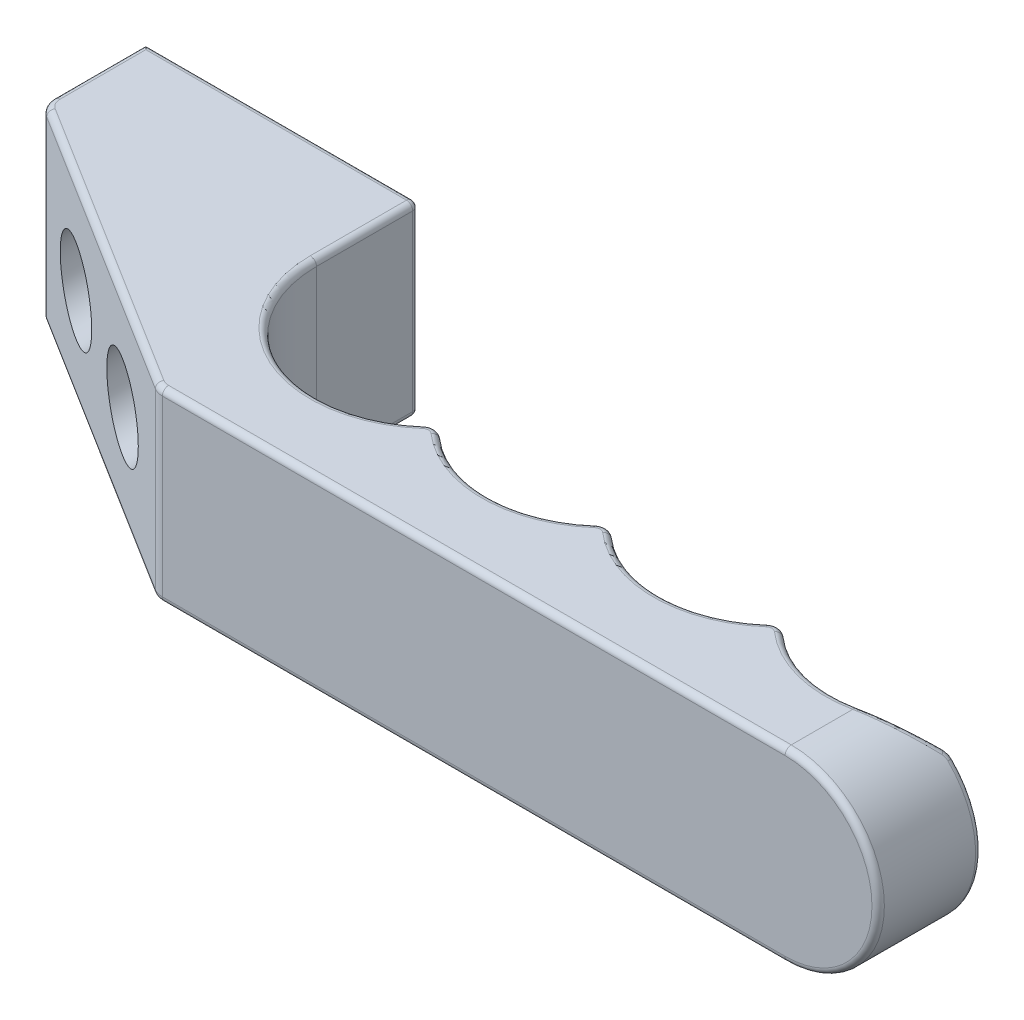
ISO-10303-21;
HEADER;
FILE_DESCRIPTION(('STEP AP214'),'2;1');
FILE_NAME('part.step','',(''),(''),'','','');
FILE_SCHEMA(('AUTOMOTIVE_DESIGN { 1 0 10303 214 1 1 1 1 }'));
ENDSEC;
DATA;
#1=APPLICATION_CONTEXT('core data for automotive mechanical design processes');
#2=APPLICATION_PROTOCOL_DEFINITION('international standard','automotive_design',2000,#1);
#3=PRODUCT_CONTEXT('',#1,'mechanical');
#4=PRODUCT('Part','Part','',(#3));
#5=PRODUCT_RELATED_PRODUCT_CATEGORY('part','',(#4));
#6=PRODUCT_DEFINITION_FORMATION('','',#4);
#7=PRODUCT_DEFINITION_CONTEXT('part definition',#1,'design');
#8=PRODUCT_DEFINITION('design','',#6,#7);
#9=PRODUCT_DEFINITION_SHAPE('','',#8);
#10=(LENGTH_UNIT() NAMED_UNIT(*) SI_UNIT(.MILLI.,.METRE.));
#11=(NAMED_UNIT(*) PLANE_ANGLE_UNIT() SI_UNIT($,.RADIAN.));
#12=(NAMED_UNIT(*) SI_UNIT($,.STERADIAN.) SOLID_ANGLE_UNIT());
#13=UNCERTAINTY_MEASURE_WITH_UNIT(LENGTH_MEASURE(1.E-05),#10,'distance_accuracy_value','');
#14=(GEOMETRIC_REPRESENTATION_CONTEXT(3) GLOBAL_UNCERTAINTY_ASSIGNED_CONTEXT((#13)) GLOBAL_UNIT_ASSIGNED_CONTEXT((#10,
#11,#12)) REPRESENTATION_CONTEXT('',''));
#15=CARTESIAN_POINT('',(0.,0.,0.));
#16=DIRECTION('',(0.,0.,1.));
#17=DIRECTION('',(1.,0.,0.));
#18=AXIS2_PLACEMENT_3D('',#15,#16,#17);
#19=CARTESIAN_POINT('',(132.,-15.,16.5));
#20=DIRECTION('',(0.,1.,0.));
#21=DIRECTION('',(-1.,0.,0.));
#22=AXIS2_PLACEMENT_3D('',#19,#20,#21);
#23=CYLINDRICAL_SURFACE('',#22,19.);
#24=CARTESIAN_POINT('',(132.,14.,16.5));
#25=DIRECTION('',(0.,-1.,0.));
#26=DIRECTION('',(1.,0.,0.));
#27=AXIS2_PLACEMENT_3D('',#24,#25,#26);
#28=CIRCLE('',#27,19.);
#29=CARTESIAN_POINT('',(119.484126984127,14.,30.7952062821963));
#30=VERTEX_POINT('',#29);
#31=CARTESIAN_POINT('',(135.8,14.,35.1161220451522));
#32=VERTEX_POINT('',#31);
#33=EDGE_CURVE('E273',#30,#32,#28,.F.);
#34=ORIENTED_EDGE('',*,*,#33,.T.);
#35=CARTESIAN_POINT('',(131.776015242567,14.3929827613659,36.4999170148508));
#36=CARTESIAN_POINT('',(131.774917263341,14.3926605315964,36.0859426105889));
#37=CARTESIAN_POINT('',(131.856538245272,14.1116672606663,35.7930997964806));
#38=CARTESIAN_POINT('',(131.938159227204,13.8306739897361,35.5002569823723));
#39=CARTESIAN_POINT('',(132.054733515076,13.4334505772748,35.4999211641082));
#40=CARTESIAN_POINT('',(132.121642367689,14.4944893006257,36.4990544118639));
#41=CARTESIAN_POINT('',(132.114218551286,14.4923535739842,36.0864211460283));
#42=CARTESIAN_POINT('',(132.184459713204,14.2096688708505,35.7938504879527));
#43=CARTESIAN_POINT('',(132.254377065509,13.9269273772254,35.501304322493));
#44=CARTESIAN_POINT('',(132.361189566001,13.5281900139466,35.4991016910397));
#45=CARTESIAN_POINT('',(132.470956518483,14.5834103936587,36.4902462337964));
#46=CARTESIAN_POINT('',(132.457190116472,14.5799202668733,36.0787709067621));
#47=CARTESIAN_POINT('',(132.515728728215,14.2956846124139,35.786538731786));
#48=CARTESIAN_POINT('',(132.574107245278,14.0114238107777,35.4943206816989));
#49=CARTESIAN_POINT('',(132.670914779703,13.611183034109,35.4907339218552));
#50=CARTESIAN_POINT('',(133.174104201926,14.735776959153,36.4562227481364));
#51=CARTESIAN_POINT('',(133.147102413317,14.7304303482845,36.0467396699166));
#52=CARTESIAN_POINT('',(133.182304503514,14.4435007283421,35.755282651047));
#53=CARTESIAN_POINT('',(133.217356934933,14.1565275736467,35.4638260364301));
#54=CARTESIAN_POINT('',(133.294372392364,13.753391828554,35.4584116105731));
#55=CARTESIAN_POINT('',(133.527936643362,14.7992284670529,36.4310113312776));
#56=CARTESIAN_POINT('',(133.494202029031,14.7934262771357,36.0223629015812));
#57=CARTESIAN_POINT('',(133.517610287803,14.5053068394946,35.7313422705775));
#58=CARTESIAN_POINT('',(133.541024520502,14.2171856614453,35.4403194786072));
#59=CARTESIAN_POINT('',(133.608103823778,13.8126132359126,35.4344607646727));
#60=CARTESIAN_POINT('',(134.235589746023,14.9001367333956,36.3638404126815));
#61=CARTESIAN_POINT('',(134.188024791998,14.8943419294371,35.9565392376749));
#62=CARTESIAN_POINT('',(134.188014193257,14.6042490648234,35.6664910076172));
#63=CARTESIAN_POINT('',(134.188005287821,14.3141590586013,35.3764441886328));
#64=CARTESIAN_POINT('',(134.235556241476,13.906794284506,35.3706483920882));
#65=CARTESIAN_POINT('',(134.589400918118,14.9377268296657,36.3219686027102));
#66=CARTESIAN_POINT('',(134.534906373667,14.9324140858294,35.9151657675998));
#67=CARTESIAN_POINT('',(134.523104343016,14.6415116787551,35.6256689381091));
#68=CARTESIAN_POINT('',(134.51146622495,14.3506221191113,35.3361482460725));
#69=CARTESIAN_POINT('',(134.549268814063,13.9418783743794,35.3308701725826));
#70=CARTESIAN_POINT('',(135.296070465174,14.9876598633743,36.2214508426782));
#71=CARTESIAN_POINT('',(135.227467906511,14.9842752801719,35.815355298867));
#72=CARTESIAN_POINT('',(135.192236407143,14.6921143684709,35.5270441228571));
#73=CARTESIAN_POINT('',(135.157169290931,14.3999654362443,35.2387084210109));
#74=CARTESIAN_POINT('',(135.175849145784,13.9884825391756,35.2353783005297));
#75=CARTESIAN_POINT('',(135.648928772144,15.0000010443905,36.1628037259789));
#76=CARTESIAN_POINT('',(135.573313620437,14.9980631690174,35.7568847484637));
#77=CARTESIAN_POINT('',(135.526278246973,14.7054527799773,35.4692401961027));
#78=CARTESIAN_POINT('',(135.479565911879,14.4128443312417,35.1815316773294));
#79=CARTESIAN_POINT('',(135.488716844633,14.0000009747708,35.1796635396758));
#80=CARTESIAN_POINT('',(136.396966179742,14.9999988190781,36.0202882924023));
#81=CARTESIAN_POINT('',(136.30635284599,15.0021922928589,35.6144494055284));
#82=CARTESIAN_POINT('',(136.234320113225,14.7089770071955,35.3283083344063));
#83=CARTESIAN_POINT('',(136.162698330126,14.4157633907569,35.0420850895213));
#84=CARTESIAN_POINT('',(136.151976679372,13.9999988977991,35.0442738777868));
#85=CARTESIAN_POINT('',(136.791647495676,14.9842175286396,35.9341251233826));
#86=CARTESIAN_POINT('',(136.693206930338,14.9892018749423,35.5280953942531));
#87=CARTESIAN_POINT('',(136.607835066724,14.695908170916,35.2428576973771));
#88=CARTESIAN_POINT('',(136.523090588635,14.4025675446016,34.9574573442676));
#89=CARTESIAN_POINT('',(136.501927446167,13.9852696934,34.9624188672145));
#90=CARTESIAN_POINT('',(137.572941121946,14.9224492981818,35.7416836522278));
#91=CARTESIAN_POINT('',(137.458914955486,14.9342685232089,35.3349664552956));
#92=CARTESIAN_POINT('',(137.34716537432,14.6411897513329,35.0515927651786));
#93=CARTESIAN_POINT('',(137.236043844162,14.3480649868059,34.7680569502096));
#94=CARTESIAN_POINT('',(137.194674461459,13.927619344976,34.779599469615));
#95=CARTESIAN_POINT('',(137.959552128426,14.8764575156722,35.6354021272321));
#96=CARTESIAN_POINT('',(137.837979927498,14.8922554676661,35.2280965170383));
#97=CARTESIAN_POINT('',(137.712979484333,14.5995355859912,34.9457752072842));
#98=CARTESIAN_POINT('',(137.588800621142,14.3066898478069,34.6631909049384));
#99=CARTESIAN_POINT('',(137.537469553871,13.8846936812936,34.6786320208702));
#100=CARTESIAN_POINT('',(138.722219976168,14.755974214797,35.4039414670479));
#101=CARTESIAN_POINT('',(138.58582303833,14.7809418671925,34.995179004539));
#102=CARTESIAN_POINT('',(138.434617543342,14.4892649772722,34.7149983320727));
#103=CARTESIAN_POINT('',(138.284236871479,14.1974623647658,34.4345541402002));
#104=CARTESIAN_POINT('',(138.213701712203,13.7722426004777,34.4587443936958));
#105=CARTESIAN_POINT('',(139.098262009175,14.6814446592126,35.2787372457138));
#106=CARTESIAN_POINT('',(138.954772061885,14.7115112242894,34.8689969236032));
#107=CARTESIAN_POINT('',(138.790427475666,14.4206125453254,34.5900136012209));
#108=CARTESIAN_POINT('',(138.627073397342,14.1294834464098,34.3106510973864));
#109=CARTESIAN_POINT('',(138.547125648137,13.70268168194,34.3398003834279));
#110=CARTESIAN_POINT('',(139.836857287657,14.5059519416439,35.0111903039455));
#111=CARTESIAN_POINT('',(139.67964657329,14.5473453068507,34.5992329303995));
#112=CARTESIAN_POINT('',(139.489336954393,14.2582877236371,34.3226601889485));
#113=CARTESIAN_POINT('',(139.300021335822,13.9689996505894,34.0457074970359));
#114=CARTESIAN_POINT('',(139.202013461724,13.5388884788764,34.0856307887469));
#115=CARTESIAN_POINT('',(140.199411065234,14.4049898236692,34.8688482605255));
#116=CARTESIAN_POINT('',(140.035728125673,14.4524953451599,34.4555304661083));
#117=CARTESIAN_POINT('',(139.832437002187,14.1646163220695,34.1802921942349));
#118=CARTESIAN_POINT('',(139.630275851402,13.8763832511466,33.904548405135));
#119=CARTESIAN_POINT('',(139.523477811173,13.4446571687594,33.9504058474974));
#120=CARTESIAN_POINT('',(140.906391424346,14.1796978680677,34.5700223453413));
#121=CARTESIAN_POINT('',(140.730430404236,14.2404031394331,34.1537484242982));
#122=CARTESIAN_POINT('',(140.501588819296,13.9551191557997,33.8811648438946));
#123=CARTESIAN_POINT('',(140.273860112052,13.6694870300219,33.6080841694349));
#124=CARTESIAN_POINT('',(140.150333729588,13.2343846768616,33.666521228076));
#125=CARTESIAN_POINT('',(141.250941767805,14.0555654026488,34.4136633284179));
#126=CARTESIAN_POINT('',(141.069300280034,14.1232183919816,33.9956664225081));
#127=CARTESIAN_POINT('',(140.827756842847,13.8394803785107,33.7245323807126));
#128=CARTESIAN_POINT('',(140.58742428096,13.5552624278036,33.4527767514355));
#129=CARTESIAN_POINT('',(140.455835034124,13.1185277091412,33.5179801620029));
#130=CARTESIAN_POINT('',(141.923912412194,13.7854588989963,34.0876058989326));
#131=CARTESIAN_POINT('',(141.73167274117,13.8678948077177,33.6659054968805));
#132=CARTESIAN_POINT('',(141.464979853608,13.5874770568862,33.3976690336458));
#133=CARTESIAN_POINT('',(141.199513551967,13.3065753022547,33.128803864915));
#134=CARTESIAN_POINT('',(141.052535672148,12.866428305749,33.2082256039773));
#135=CARTESIAN_POINT('',(142.252325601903,13.6394753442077,33.9179016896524));
#136=CARTESIAN_POINT('',(142.055257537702,13.7296092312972,33.4940946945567));
#137=CARTESIAN_POINT('',(141.776028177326,13.4511034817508,33.2274322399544));
#138=CARTESIAN_POINT('',(141.498111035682,13.1719705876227,32.9600088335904));
#139=CARTESIAN_POINT('',(141.343728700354,12.7301769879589,33.0470066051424));
#140=CARTESIAN_POINT('',(143.211412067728,13.171968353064,33.3917437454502));
#141=CARTESIAN_POINT('',(143.003163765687,13.2853831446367,32.960098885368));
#142=CARTESIAN_POINT('',(142.684716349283,13.0138684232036,32.699263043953));
#143=CARTESIAN_POINT('',(142.37143959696,12.7398571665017,32.4354182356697));
#144=CARTESIAN_POINT('',(142.194118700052,12.293837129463,32.5471565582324));
#145=CARTESIAN_POINT('',(143.817001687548,12.820537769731,33.017784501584));
#146=CARTESIAN_POINT('',(143.602015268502,12.9507563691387,32.5803995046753));
#147=CARTESIAN_POINT('',(143.258911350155,12.6845664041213,32.3234112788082));
#148=CARTESIAN_POINT('',(142.921272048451,12.4147173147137,32.0624481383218));
#149=CARTESIAN_POINT('',(142.73107482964,11.9658352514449,32.1918952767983));
#150=CARTESIAN_POINT('',(144.641488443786,12.2645550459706,32.4534871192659));
#151=CARTESIAN_POINT('',(144.417379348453,12.4223380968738,32.0088021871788));
#152=CARTESIAN_POINT('',(144.041558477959,12.1625249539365,31.7553774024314));
#153=CARTESIAN_POINT('',(143.666860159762,11.9019694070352,31.5011418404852));
#154=CARTESIAN_POINT('',(143.462119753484,11.446918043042,31.6558127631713));
#155=CARTESIAN_POINT('',(144.889133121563,12.0861631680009,32.2758842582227));
#156=CARTESIAN_POINT('',(144.663335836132,12.2520815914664,31.8282332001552));
#157=CARTESIAN_POINT('',(144.276768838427,11.9948884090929,31.576481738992));
#158=CARTESIAN_POINT('',(143.891316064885,11.7368505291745,31.3238454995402));
#159=CARTESIAN_POINT('',(143.681698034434,11.280418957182,31.4870900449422));
#160=CARTESIAN_POINT('',(145.249951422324,11.8093741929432,32.0055051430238));
#161=CARTESIAN_POINT('',(145.021864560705,11.9879963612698,31.5534987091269));
#162=CARTESIAN_POINT('',(144.619698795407,11.7345468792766,31.3039246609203));
#163=CARTESIAN_POINT('',(144.217810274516,11.4808863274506,31.0541298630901));
#164=CARTESIAN_POINT('',(144.00162359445,11.0220825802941,31.2302298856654));
#165=CARTESIAN_POINT('',(145.368401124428,11.7156196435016,31.9147558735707));
#166=CARTESIAN_POINT('',(145.13980998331,11.8983773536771,31.461132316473));
#167=CARTESIAN_POINT('',(144.732315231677,11.6463247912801,31.2124099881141));
#168=CARTESIAN_POINT('',(144.325097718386,11.3940478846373,30.9634573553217));
#169=CARTESIAN_POINT('',(144.106648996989,10.9345783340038,31.1440180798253));
#170=CARTESIAN_POINT('',(145.601793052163,11.5251147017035,31.7320469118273));
#171=CARTESIAN_POINT('',(145.37242424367,11.7161753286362,31.2750927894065));
#172=CARTESIAN_POINT('',(144.954297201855,11.4669762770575,31.0280842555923));
#173=CARTESIAN_POINT('',(144.536449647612,11.2175517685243,30.7808437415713));
#174=CARTESIAN_POINT('',(144.313589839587,10.756773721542,30.9704445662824));
#175=CARTESIAN_POINT('',(145.716734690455,11.428363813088,31.6400870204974));
#176=CARTESIAN_POINT('',(145.487091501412,11.623578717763,31.1814103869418));
#177=CARTESIAN_POINT('',(145.06366219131,11.3758493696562,30.9352729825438));
#178=CARTESIAN_POINT('',(144.640512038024,11.1278810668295,30.6888935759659));
#179=CARTESIAN_POINT('',(144.415504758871,10.6664728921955,30.883082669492));
#180=CARTESIAN_POINT('',(146.230328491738,10.9827800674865,31.2203934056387));
#181=CARTESIAN_POINT('',(146.001656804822,11.1954808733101,30.7522690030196));
#182=CARTESIAN_POINT('',(145.552543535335,10.9559586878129,30.511507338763));
#183=CARTESIAN_POINT('',(145.106918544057,10.7134376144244,30.2677221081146));
#184=CARTESIAN_POINT('',(144.87089126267,10.2505947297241,30.4843737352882));
#185=CARTESIAN_POINT('',(146.608900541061,10.6171770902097,30.8864254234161));
#186=CARTESIAN_POINT('',(146.381095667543,10.8443254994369,30.411147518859));
#187=CARTESIAN_POINT('',(145.913475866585,10.6108717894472,30.173787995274));
#188=CARTESIAN_POINT('',(145.449237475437,10.373830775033,29.9330322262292));
#189=CARTESIAN_POINT('',(145.206558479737,9.90936528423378,30.1671041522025));
#190=CARTESIAN_POINT('',(147.322838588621,9.85228356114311,30.2112712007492));
#191=CARTESIAN_POINT('',(147.100053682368,10.1080837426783,29.7202869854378));
#192=CARTESIAN_POINT('',(146.595592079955,9.88719829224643,29.489570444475));
#193=CARTESIAN_POINT('',(146.094554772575,9.66267980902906,29.2554235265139));
#194=CARTESIAN_POINT('',(145.839583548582,9.19546465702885,29.5257076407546));
#195=CARTESIAN_POINT('',(147.658167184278,9.45296433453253,29.8700790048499));
#196=CARTESIAN_POINT('',(147.439367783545,9.72238769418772,29.370230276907));
#197=CARTESIAN_POINT('',(146.916741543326,9.50858316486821,29.1430649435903));
#198=CARTESIAN_POINT('',(146.39733085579,9.29055596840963,28.9121955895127));
#199=CARTESIAN_POINT('',(146.13690823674,8.82276671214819,29.2015750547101));
#200=CARTESIAN_POINT('',(148.129796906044,8.82817065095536,29.3574418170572));
#201=CARTESIAN_POINT('',(147.918449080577,9.11850802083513,28.844099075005));
#202=CARTESIAN_POINT('',(147.369880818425,8.91415623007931,28.6207764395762));
#203=CARTESIAN_POINT('',(146.822137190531,8.70872497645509,28.3965022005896));
#204=CARTESIAN_POINT('',(146.555086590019,8.23962594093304,28.7145697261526));
#205=CARTESIAN_POINT('',(148.282232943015,8.61485196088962,29.1858501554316));
#206=CARTESIAN_POINT('',(148.074221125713,8.91134310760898,28.6672153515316));
#207=CARTESIAN_POINT('',(147.516602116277,8.71087706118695,28.4456729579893));
#208=CARTESIAN_POINT('',(146.959772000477,8.50925536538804,28.2231574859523));
#209=CARTESIAN_POINT('',(146.690246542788,8.04052849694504,28.5515576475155));
#210=CARTESIAN_POINT('',(148.576184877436,8.17976215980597,28.8438471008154));
#211=CARTESIAN_POINT('',(148.375787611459,8.48783829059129,28.3139446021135));
#212=CARTESIAN_POINT('',(147.800124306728,8.29538700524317,28.0959665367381));
#213=CARTESIAN_POINT('',(147.225253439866,8.10177399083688,27.8770110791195));
#214=CARTESIAN_POINT('',(146.950883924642,7.63444468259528,28.2266547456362));
#215=CARTESIAN_POINT('',(148.717701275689,7.95799143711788,28.6734356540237));
#216=CARTESIAN_POINT('',(148.521544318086,8.27142240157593,28.1375395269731));
#217=CARTESIAN_POINT('',(147.936925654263,8.0831765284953,27.9213635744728));
#218=CARTESIAN_POINT('',(147.353061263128,7.89369070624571,27.7041920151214));
#219=CARTESIAN_POINT('',(147.076361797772,7.42745867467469,28.064763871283));
#220=CARTESIAN_POINT('',(148.989622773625,7.50595017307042,28.3352253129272));
#221=CARTESIAN_POINT('',(148.802921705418,7.82905677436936,27.7865417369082));
#222=CARTESIAN_POINT('',(148.200476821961,7.64948830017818,27.5739581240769));
#223=CARTESIAN_POINT('',(147.598786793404,7.46867641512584,27.3603808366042));
#224=CARTESIAN_POINT('',(147.317465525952,7.00555349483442,27.7434640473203));
#225=CARTESIAN_POINT('',(149.120038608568,7.27568815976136,28.1674240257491));
#226=CARTESIAN_POINT('',(148.938508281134,7.60303916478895,27.6119398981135));
#227=CARTESIAN_POINT('',(148.327236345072,7.4280198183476,27.4011540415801));
#228=CARTESIAN_POINT('',(147.716669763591,7.2516816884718,27.1893800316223));
#229=CARTESIAN_POINT('',(147.4331008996,6.7906422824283,27.5840528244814));
#230=CARTESIAN_POINT('',(149.369754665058,6.80589031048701,27.8358899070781));
#231=CARTESIAN_POINT('',(149.19958696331,7.1402245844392,27.2658165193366));
#232=CARTESIAN_POINT('',(148.570757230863,6.97462203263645,27.0586333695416));
#233=CARTESIAN_POINT('',(147.942645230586,6.80768873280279,26.8504367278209));
#234=CARTESIAN_POINT('',(147.654515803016,6.35216428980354,27.2690954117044));
#235=CARTESIAN_POINT('',(149.489052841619,6.5663527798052,27.6721578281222));
#236=CARTESIAN_POINT('',(149.325023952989,6.90335144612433,27.0943055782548));
#237=CARTESIAN_POINT('',(148.687516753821,6.74269081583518,26.8889173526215));
#238=CARTESIAN_POINT('',(148.050683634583,6.58061948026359,26.6825048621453));
#239=CARTESIAN_POINT('',(147.760293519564,6.12859592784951,27.1135499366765));
#240=CARTESIAN_POINT('',(149.602688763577,6.32193470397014,27.5113047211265));
#241=CARTESIAN_POINT('',(149.444950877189,6.66133387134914,26.9256401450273));
#242=CARTESIAN_POINT('',(148.799205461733,6.50506870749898,26.7215076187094));
#243=CARTESIAN_POINT('',(148.153460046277,6.34880354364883,26.5173750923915));
#244=CARTESIAN_POINT('',(147.861050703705,5.90047239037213,26.9607394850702));
#245=(BOUNDED_SURFACE() B_SPLINE_SURFACE(3,2,((#35,#36,#37,#38,#39),(#40,#41,#42,#43,#44),(#45,
#46,#47,#48,#49),(#50,#51,#52,#53,#54),(#55,#56,#57,#58,#59),(#60,#61,#62,#63,#64),(#65,#66,#67,
#68,#69),(#70,#71,#72,#73,#74),(#75,#76,#77,#78,#79),(#80,#81,#82,#83,#84),(#85,#86,#87,#88,
#89),(#90,#91,#92,#93,#94),(#95,#96,#97,#98,#99),(#100,#101,#102,#103,#104),(#105,#106,#107,
#108,#109),(#110,#111,#112,#113,#114),(#115,#116,#117,#118,#119),(#120,#121,#122,#123,#124),
(#125,#126,#127,#128,#129),(#130,#131,#132,#133,#134),(#135,#136,#137,#138,#139),(#140,#141,
#142,#143,#144),(#145,#146,#147,#148,#149),(#150,#151,#152,#153,#154),(#155,#156,#157,#158,
#159),(#160,#161,#162,#163,#164),(#165,#166,#167,#168,#169),(#170,#171,#172,#173,#174),(#175,
#176,#177,#178,#179),(#180,#181,#182,#183,#184),(#185,#186,#187,#188,#189),(#190,#191,#192,#193,
#194),(#195,#196,#197,#198,#199),(#200,#201,#202,#203,#204),(#205,#206,#207,#208,#209),(#210,
#211,#212,#213,#214),(#215,#216,#217,#218,#219),(#220,#221,#222,#223,#224),(#225,#226,#227,#228,
#229),(#230,#231,#232,#233,#234),(#235,#236,#237,#238,#239),(#240,#241,#242,#243,#244)),
.UNSPECIFIED.,.F.,.F.,.F.) B_SPLINE_SURFACE_WITH_KNOTS((4,2,2,2,2,2,2,2,2,2,2,2,2,2,2,2,2,2,2,2,
4),(3,2,3),(0.,1.00833903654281,2.01643898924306,3.01930156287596,4.02223389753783,
5.15627789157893,6.29050370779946,7.4262465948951,8.56194463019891,9.68837677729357,
10.8153009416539,13.0657406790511,14.0724935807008,14.5754409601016,15.0784720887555,
16.8577719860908,18.6386006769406,19.5349871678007,20.4313325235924,21.3268009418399,
22.2224337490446),(0.,0.5,1.),
.UNSPECIFIED.) GEOMETRIC_REPRESENTATION_ITEM() RATIONAL_B_SPLINE_SURFACE(((1.,0.923957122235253,
1.,0.923957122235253,1.),(1.,0.924385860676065,1.,0.924385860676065,1.),(1.,0.924709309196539,
1.,0.924709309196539,1.),(1.,0.925139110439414,1.,0.925139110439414,1.),(1.,0.925245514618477,
1.,0.925245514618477,1.),(1.,0.925234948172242,1.,0.925234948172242,1.),(1.,0.925119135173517,
1.,0.925119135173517,1.),(1.,0.924665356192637,1.,0.924665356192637,1.),(1.,0.924327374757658,
1.,0.924327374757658,1.),(1.,0.923373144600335,1.,0.923373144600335,1.),(1.,0.922726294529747,
1.,0.922726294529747,1.),(1.,0.921160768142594,1.,0.921160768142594,1.),(1.,0.920242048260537,
1.,0.920242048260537,1.),(1.,0.918144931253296,1.,0.918144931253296,1.),(1.,0.91696618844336,1.,
0.91696618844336,1.),(1.,0.914366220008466,1.,0.914366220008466,1.),(1.,0.912945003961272,1.,
0.912945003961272,1.),(1.,0.909890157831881,1.,0.909890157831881,1.),(1.,0.908258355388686,1.,
0.908258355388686,1.),(1.,0.904790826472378,1.,0.904790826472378,1.),(1.,0.902955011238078,1.,
0.902955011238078,1.),(1.,0.897170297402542,1.,0.897170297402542,1.),(1.,0.892939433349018,1.,
0.892939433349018,1.),(1.,0.886370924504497,1.,0.886370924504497,1.),(1.,0.884279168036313,1.,
0.884279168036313,1.),(1.,0.881055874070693,1.,0.881055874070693,1.),(1.,0.87996764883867,1.,
0.87996764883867,1.),(1.,0.877763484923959,1.,0.877763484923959,1.),(1.,0.876647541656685,1.,
0.876647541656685,1.),(1.,0.871523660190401,1.,0.871523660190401,1.),(1.,0.867361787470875,1.,
0.867361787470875,1.),(1.,0.858751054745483,1.,0.858751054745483,1.),(1.,0.854301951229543,1.,
0.854301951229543,1.),(1.,0.847442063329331,1.,0.847442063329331,1.),(1.,0.845116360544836,1.,
0.845116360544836,1.),(1.,0.840415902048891,1.,0.840415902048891,1.),(1.,0.838041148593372,1.,
0.838041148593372,1.),(1.,0.833256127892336,1.,0.833256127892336,1.),(1.,0.830845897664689,1.,
0.830845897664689,1.),(1.,0.82600487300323,1.,0.82600487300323,1.),(1.,0.823574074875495,1.,
0.823574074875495,1.),(1.,0.821142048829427,1.,0.821142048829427,1.))) REPRESENTATION_ITEM('') SURFACE());
#246=CARTESIAN_POINT('',(132.054733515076,13.4334505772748,35.4999211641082));
#247=CARTESIAN_POINT('',(132.361189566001,13.5281900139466,35.4991016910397));
#248=CARTESIAN_POINT('',(132.670914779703,13.611183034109,35.4907339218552));
#249=CARTESIAN_POINT('',(133.294372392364,13.753391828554,35.4584116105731));
#250=CARTESIAN_POINT('',(133.608103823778,13.8126132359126,35.4344607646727));
#251=CARTESIAN_POINT('',(134.235556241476,13.906794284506,35.3706483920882));
#252=CARTESIAN_POINT('',(134.549268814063,13.9418783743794,35.3308701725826));
#253=CARTESIAN_POINT('',(135.175849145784,13.9884825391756,35.2353783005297));
#254=CARTESIAN_POINT('',(135.488716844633,14.0000009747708,35.1796635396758));
#255=CARTESIAN_POINT('',(136.151976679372,13.9999988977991,35.0442738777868));
#256=CARTESIAN_POINT('',(136.501927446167,13.9852696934,34.9624188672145));
#257=CARTESIAN_POINT('',(137.194674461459,13.927619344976,34.779599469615));
#258=CARTESIAN_POINT('',(137.537469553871,13.8846936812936,34.6786320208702));
#259=CARTESIAN_POINT('',(138.213701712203,13.7722426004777,34.4587443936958));
#260=CARTESIAN_POINT('',(138.547125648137,13.70268168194,34.3398003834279));
#261=CARTESIAN_POINT('',(139.202013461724,13.5388884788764,34.0856307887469));
#262=CARTESIAN_POINT('',(139.523477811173,13.4446571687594,33.9504058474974));
#263=CARTESIAN_POINT('',(140.150333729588,13.2343846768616,33.666521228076));
#264=CARTESIAN_POINT('',(140.455835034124,13.1185277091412,33.5179801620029));
#265=CARTESIAN_POINT('',(141.052535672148,12.866428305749,33.2082256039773));
#266=CARTESIAN_POINT('',(141.343728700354,12.7301769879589,33.0470066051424));
#267=CARTESIAN_POINT('',(142.194118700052,12.293837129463,32.5471565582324));
#268=CARTESIAN_POINT('',(142.73107482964,11.9658352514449,32.1918952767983));
#269=CARTESIAN_POINT('',(143.462119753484,11.446918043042,31.6558127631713));
#270=CARTESIAN_POINT('',(143.681698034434,11.280418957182,31.4870900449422));
#271=CARTESIAN_POINT('',(144.00162359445,11.0220825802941,31.2302298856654));
#272=CARTESIAN_POINT('',(144.106648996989,10.9345783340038,31.1440180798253));
#273=CARTESIAN_POINT('',(144.313589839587,10.756773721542,30.9704445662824));
#274=CARTESIAN_POINT('',(144.415504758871,10.6664728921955,30.883082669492));
#275=CARTESIAN_POINT('',(144.87089126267,10.2505947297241,30.4843737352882));
#276=CARTESIAN_POINT('',(145.206558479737,9.90936528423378,30.1671041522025));
#277=CARTESIAN_POINT('',(145.839583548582,9.19546465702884,29.5257076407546));
#278=CARTESIAN_POINT('',(146.13690823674,8.82276671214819,29.2015750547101));
#279=CARTESIAN_POINT('',(146.555086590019,8.23962594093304,28.7145697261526));
#280=CARTESIAN_POINT('',(146.690246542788,8.04052849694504,28.5515576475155));
#281=CARTESIAN_POINT('',(146.950883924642,7.63444468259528,28.2266547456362));
#282=CARTESIAN_POINT('',(147.076361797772,7.42745867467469,28.064763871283));
#283=CARTESIAN_POINT('',(147.317465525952,7.00555349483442,27.7434640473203));
#284=CARTESIAN_POINT('',(147.4331008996,6.7906422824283,27.5840528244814));
#285=CARTESIAN_POINT('',(147.654515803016,6.35216428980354,27.2690954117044));
#286=CARTESIAN_POINT('',(147.760293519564,6.12859592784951,27.1135499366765));
#287=CARTESIAN_POINT('',(147.861050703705,5.90047239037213,26.9607394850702));
#288=B_SPLINE_CURVE_WITH_KNOTS('',3,(#246,#247,#248,#249,#250,#251,#252,#253,#254,#255,#256,
#257,#258,#259,#260,#261,#262,#263,#264,#265,#266,#267,#268,#269,#270,#271,#272,#273,#274,#275,
#276,#277,#278,#279,#280,#281,#282,#283,#284,#285,#286,#287),.UNSPECIFIED.,.F.,.F.,(4,2,2,2,2,2,
2,2,2,2,2,2,2,2,2,2,2,2,2,2,4),(0.,1.00833903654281,2.01643898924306,3.01930156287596,
4.02223389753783,5.15627789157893,6.29050370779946,7.4262465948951,8.56194463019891,
9.68837677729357,10.8153009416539,13.0657406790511,14.0724935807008,14.5754409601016,
15.0784720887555,16.8577719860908,18.6386006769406,19.5349871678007,20.4313325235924,
21.3268009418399,22.2224337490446),.UNSPECIFIED.);
#289=CARTESIAN_POINT('',(144.515873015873,10.5748123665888,30.7952062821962));
#290=VERTEX_POINT('',#289);
#291=EDGE_CURVE('E261',#32,#290,#288,.T.);
#292=ORIENTED_EDGE('',*,*,#291,.T.);
#293=DIRECTION('',(0.,1.,0.));
#294=VECTOR('',#293,1.);
#295=CARTESIAN_POINT('',(144.515873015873,-15.,30.7952062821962));
#296=LINE('',#295,#294);
#297=CARTESIAN_POINT('',(144.515873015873,-10.5748123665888,30.7952062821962));
#298=VERTEX_POINT('',#297);
#299=EDGE_CURVE('E245',#298,#290,#296,.T.);
#300=ORIENTED_EDGE('',*,*,#299,.F.);
#301=CARTESIAN_POINT('',(149.602688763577,-6.32193470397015,27.5113047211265));
#302=CARTESIAN_POINT('',(149.444950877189,-6.66133387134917,26.9256401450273));
#303=CARTESIAN_POINT('',(148.799205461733,-6.50506870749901,26.7215076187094));
#304=CARTESIAN_POINT('',(148.153460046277,-6.34880354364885,26.5173750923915));
#305=CARTESIAN_POINT('',(147.861050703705,-5.90047239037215,26.9607394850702));
#306=CARTESIAN_POINT('',(149.489845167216,-6.56465011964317,27.67103545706));
#307=CARTESIAN_POINT('',(149.325857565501,-6.90167109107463,27.093132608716));
#308=CARTESIAN_POINT('',(148.688295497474,-6.74103604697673,26.8877493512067));
#309=CARTESIAN_POINT('',(148.051397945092,-6.57900996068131,26.6813564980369));
#310=CARTESIAN_POINT('',(147.760996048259,-6.12700677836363,27.1124836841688));
#311=CARTESIAN_POINT('',(149.371417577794,-6.8025516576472,27.8336068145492));
#312=CARTESIAN_POINT('',(149.201330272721,-7.13693315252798,27.2634322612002));
#313=CARTESIAN_POINT('',(148.572384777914,-6.97138973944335,27.0562668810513));
#314=CARTESIAN_POINT('',(147.944146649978,-6.80453354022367,26.8481022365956));
#315=CARTESIAN_POINT('',(147.655990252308,-6.34904821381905,27.2669264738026));
#316=CARTESIAN_POINT('',(149.123597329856,-7.26919965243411,28.1627726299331));
#317=CARTESIAN_POINT('',(148.942213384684,-7.59666791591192,27.6070987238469));
#318=CARTESIAN_POINT('',(148.330701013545,-7.42176810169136,27.3963561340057));
#319=CARTESIAN_POINT('',(147.719883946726,-7.24556722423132,27.1846389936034));
#320=CARTESIAN_POINT('',(147.436256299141,-6.78458634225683,27.5796339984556));
#321=CARTESIAN_POINT('',(148.99420681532,-7.49794788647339,28.3293662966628));
#322=CARTESIAN_POINT('',(148.807677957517,-7.82121530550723,27.7804549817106));
#323=CARTESIAN_POINT('',(148.204929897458,-7.64179477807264,27.5679272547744));
#324=CARTESIAN_POINT('',(147.602925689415,-7.46114696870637,27.3544194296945));
#325=CARTESIAN_POINT('',(147.321530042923,-6.99808469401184,27.7378979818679));
#326=CARTESIAN_POINT('',(148.724548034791,-7.94697519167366,28.6650711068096));
#327=CARTESIAN_POINT('',(148.528605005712,-8.26066852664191,28.1288785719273));
#328=CARTESIAN_POINT('',(147.9435519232,-8.07262283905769,27.9127836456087));
#329=CARTESIAN_POINT('',(147.359241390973,-7.88335439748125,27.695707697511));
#330=CARTESIAN_POINT('',(147.082432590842,-7.4171768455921,28.0568175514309));
#331=CARTESIAN_POINT('',(148.584274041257,-8.1672497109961,28.834183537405));
#332=CARTESIAN_POINT('',(148.384105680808,-8.47564448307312,28.303953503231));
#333=CARTESIAN_POINT('',(147.80793988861,-8.28341927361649,28.0860697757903));
#334=CARTESIAN_POINT('',(147.232554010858,-8.09004785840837,27.8672227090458));
#335=CARTESIAN_POINT('',(146.958056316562,-7.62276639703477,28.2174743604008));
#336=CARTESIAN_POINT('',(148.29296760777,-8.59946874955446,29.1735971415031));
#337=CARTESIAN_POINT('',(148.085202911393,-8.89639845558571,28.6545809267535));
#338=CARTESIAN_POINT('',(147.526943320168,-8.6962045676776,28.433158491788));
#339=CARTESIAN_POINT('',(146.969460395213,-8.49487025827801,28.2107766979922));
#340=CARTESIAN_POINT('',(146.699764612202,-8.02617083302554,28.5399172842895));
#341=CARTESIAN_POINT('',(148.141934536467,-8.8114127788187,29.3438983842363));
#342=CARTESIAN_POINT('',(147.930836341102,-9.10225069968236,28.8301508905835));
#343=CARTESIAN_POINT('',(147.381558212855,-8.89819290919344,28.6069611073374));
#344=CARTESIAN_POINT('',(146.833092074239,-8.69306906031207,28.3828324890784));
#345=CARTESIAN_POINT('',(146.565848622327,-8.22398526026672,28.701703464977));
#346=CARTESIAN_POINT('',(147.670220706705,-9.43828029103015,29.8576389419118));
#347=CARTESIAN_POINT('',(147.451605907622,-9.70816915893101,29.3574353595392));
#348=CARTESIAN_POINT('',(146.928292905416,-9.49465091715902,29.1304228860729));
#349=CARTESIAN_POINT('',(146.408236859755,-9.27684190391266,28.8996512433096));
#350=CARTESIAN_POINT('',(146.147595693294,-8.80906160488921,29.1897569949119));
#351=CARTESIAN_POINT('',(147.333012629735,-9.84076664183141,30.2012803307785));
#352=CARTESIAN_POINT('',(147.110349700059,-10.0969544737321,29.7100265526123));
#353=CARTESIAN_POINT('',(146.605324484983,-9.87628920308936,29.4794340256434));
#354=CARTESIAN_POINT('',(146.103768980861,-9.65193637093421,29.2453616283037));
#355=CARTESIAN_POINT('',(145.848604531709,-9.18471553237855,29.5162163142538));
#356=CARTESIAN_POINT('',(146.614594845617,-10.6116788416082,30.8814018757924));
#357=CARTESIAN_POINT('',(146.386830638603,-10.8390189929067,30.4059917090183));
#358=CARTESIAN_POINT('',(145.918904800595,-10.6056822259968,30.1687081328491));
#359=CARTESIAN_POINT('',(145.45441138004,-10.3686987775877,29.927973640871));
#360=CARTESIAN_POINT('',(145.21160742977,-9.90423358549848,30.1623317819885));
#361=CARTESIAN_POINT('',(146.233400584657,-10.9801165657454,31.2178844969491));
#362=CARTESIAN_POINT('',(146.004753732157,-11.1929063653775,30.749688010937));
#363=CARTESIAN_POINT('',(145.555467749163,-10.95344877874,30.5089741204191));
#364=CARTESIAN_POINT('',(145.109725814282,-10.7109451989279,30.2651890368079));
#365=CARTESIAN_POINT('',(144.873615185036,-10.2481087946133,30.4819902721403));
#366=CARTESIAN_POINT('',(145.523942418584,-11.5956251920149,31.7976299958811));
#367=CARTESIAN_POINT('',(145.295483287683,-11.7829876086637,31.3412080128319));
#368=CARTESIAN_POINT('',(144.880146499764,-11.5334661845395,31.0943444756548));
#369=CARTESIAN_POINT('',(144.466836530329,-11.2822055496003,30.8457234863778));
#370=CARTESIAN_POINT('',(144.244562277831,-10.8225835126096,31.0327484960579));
#371=CARTESIAN_POINT('',(145.205141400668,-11.8505122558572,32.0437739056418));
#372=CARTESIAN_POINT('',(144.977967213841,-12.0267656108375,31.5918356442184));
#373=CARTESIAN_POINT('',(144.577021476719,-11.7733261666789,31.3425781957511));
#374=CARTESIAN_POINT('',(144.178113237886,-11.5184082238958,31.0917519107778));
#375=CARTESIAN_POINT('',(143.96189204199,-11.0604781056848,31.2665852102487));
#376=CARTESIAN_POINT('',(144.541772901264,-12.3372332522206,32.5255210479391));
#377=CARTESIAN_POINT('',(144.318775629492,-12.4913389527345,32.0816666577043));
#378=CARTESIAN_POINT('',(143.94683356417,-12.2308416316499,31.82795309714));
#379=CARTESIAN_POINT('',(143.576912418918,-11.9688764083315,31.5726825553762));
#380=CARTESIAN_POINT('',(143.373705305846,-11.5147510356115,31.7242449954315));
#381=CARTESIAN_POINT('',(144.197207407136,-12.5690689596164,32.7611250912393));
#382=CARTESIAN_POINT('',(143.977097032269,-12.7123955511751,32.3210625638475));
#383=CARTESIAN_POINT('',(143.619772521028,-12.4484988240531,32.0650951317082));
#384=CARTESIAN_POINT('',(143.264443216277,-12.1833929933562,31.8077732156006));
#385=CARTESIAN_POINT('',(143.068190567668,-11.7311310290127,31.9480688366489));
#386=CARTESIAN_POINT('',(143.483389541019,-13.0066789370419,33.2183631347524));
#387=CARTESIAN_POINT('',(143.270582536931,-13.1288248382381,32.7850541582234));
#388=CARTESIAN_POINT('',(142.942659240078,-12.8589033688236,32.5249390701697));
#389=CARTESIAN_POINT('',(142.616709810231,-12.5877853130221,32.2634829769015));
#390=CARTESIAN_POINT('',(142.435272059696,-12.1395670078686,32.3824449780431));
#391=CARTESIAN_POINT('',(143.114200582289,-13.2125164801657,33.4400303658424));
#392=CARTESIAN_POINT('',(142.905762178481,-13.3245140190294,33.0098880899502));
#393=CARTESIAN_POINT('',(142.592666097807,-13.0517112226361,32.7476753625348));
#394=CARTESIAN_POINT('',(142.281472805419,-12.7779659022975,32.4843355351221));
#395=CARTESIAN_POINT('',(142.107924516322,-12.3316820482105,32.5930288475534));
#396=CARTESIAN_POINT('',(142.351066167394,-13.5958141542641,33.8670324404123));
#397=CARTESIAN_POINT('',(142.152826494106,-13.6881207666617,33.4424361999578));
#398=CARTESIAN_POINT('',(141.869545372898,-13.4103212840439,33.1764068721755));
#399=CARTESIAN_POINT('',(141.588152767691,-13.1315841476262,32.9092568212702));
#400=CARTESIAN_POINT('',(141.431278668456,-12.6894265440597,32.9986808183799));
#401=CARTESIAN_POINT('',(141.957126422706,-13.7732807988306,34.0723710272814));
#402=CARTESIAN_POINT('',(141.764617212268,-13.856296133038,33.6503704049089));
#403=CARTESIAN_POINT('',(141.496423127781,-13.5761296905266,33.3824059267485));
#404=CARTESIAN_POINT('',(141.229990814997,-13.2952710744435,33.113541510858));
#405=CARTESIAN_POINT('',(141.081985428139,-12.8550620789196,33.193752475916));
#406=CARTESIAN_POINT('',(141.224248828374,-14.0652528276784,34.4258330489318));
#407=CARTESIAN_POINT('',(141.043015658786,-14.1323748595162,34.007984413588));
#408=CARTESIAN_POINT('',(140.802487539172,-13.8485055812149,33.7367237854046));
#409=CARTESIAN_POINT('',(140.563105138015,-13.5641871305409,33.4648784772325));
#410=CARTESIAN_POINT('',(140.432167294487,-13.1275693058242,33.5295413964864));
#411=CARTESIAN_POINT('',(140.889387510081,-14.1852982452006,34.5773462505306));
#412=CARTESIAN_POINT('',(140.713685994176,-14.2456889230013,34.1611605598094));
#413=CARTESIAN_POINT('',(140.48549405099,-13.9603294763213,33.8884975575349));
#414=CARTESIAN_POINT('',(140.25835258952,-13.6746421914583,33.6153658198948));
#415=CARTESIAN_POINT('',(140.135256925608,-13.2396116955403,33.6734789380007));
#416=CARTESIAN_POINT('',(140.205593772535,-14.4028341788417,34.866095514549));
#417=CARTESIAN_POINT('',(140.041762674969,-14.4504763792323,34.4527684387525));
#418=CARTESIAN_POINT('',(139.838289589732,-14.1626091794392,34.1775352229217));
#419=CARTESIAN_POINT('',(139.635861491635,-13.8744148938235,33.9018349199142));
#420=CARTESIAN_POINT('',(139.528959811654,-13.4426452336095,33.9477907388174));
#421=CARTESIAN_POINT('',(139.856664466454,-14.5003296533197,35.0033347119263));
#422=CARTESIAN_POINT('',(139.699062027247,-14.542071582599,34.5913172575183));
#423=CARTESIAN_POINT('',(139.508081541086,-14.2530696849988,34.3148023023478));
#424=CARTESIAN_POINT('',(139.318026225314,-13.9638507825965,34.0379317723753));
#425=CARTESIAN_POINT('',(139.219575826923,-13.5336410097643,34.0781679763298));
#426=CARTESIAN_POINT('',(139.147004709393,-14.670693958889,35.2616980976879));
#427=CARTESIAN_POINT('',(139.00256159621,-14.7014808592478,34.8518360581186));
#428=CARTESIAN_POINT('',(138.836549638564,-14.410684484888,34.5729940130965));
#429=CARTESIAN_POINT('',(138.671457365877,-14.1196721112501,34.2937982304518));
#430=CARTESIAN_POINT('',(138.59034417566,-13.6926476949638,34.3236131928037));
#431=CARTESIAN_POINT('',(138.786299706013,-14.7436124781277,35.3828544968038));
#432=CARTESIAN_POINT('',(138.648650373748,-14.769445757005,34.9739464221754));
#433=CARTESIAN_POINT('',(138.495249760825,-14.4778858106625,34.6939513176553));
#434=CARTESIAN_POINT('',(138.342623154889,-14.1862040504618,34.4137059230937));
#435=CARTESIAN_POINT('',(138.270519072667,-13.7607049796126,34.4387117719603));
#436=CARTESIAN_POINT('',(138.054639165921,-14.8632331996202,35.6078605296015));
#437=CARTESIAN_POINT('',(137.931176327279,-14.8801011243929,35.2004037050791));
#438=CARTESIAN_POINT('',(137.802951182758,-14.5874846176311,34.9183329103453));
#439=CARTESIAN_POINT('',(137.675496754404,-14.2947453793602,34.6360117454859));
#440=CARTESIAN_POINT('',(137.621780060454,-13.8723509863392,34.652467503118));
#441=CARTESIAN_POINT('',(137.683689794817,-14.9099508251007,35.7117203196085));
#442=CARTESIAN_POINT('',(137.567456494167,-14.9228910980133,35.3048587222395));
#443=CARTESIAN_POINT('',(137.451958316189,-14.6298966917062,35.0217674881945));
#444=CARTESIAN_POINT('',(137.337059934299,-14.3368516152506,34.7385161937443));
#445=CARTESIAN_POINT('',(137.292871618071,-13.9159541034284,34.751134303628));
#446=CARTESIAN_POINT('',(137.092906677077,-14.9617052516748,35.8608580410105));
#447=CARTESIAN_POINT('',(136.988229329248,-14.9692865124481,35.4546354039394));
#448=CARTESIAN_POINT('',(136.892916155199,-14.6760423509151,35.1700542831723));
#449=CARTESIAN_POINT('',(136.797803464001,-14.3827823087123,34.8854205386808));
#450=CARTESIAN_POINT('',(136.769043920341,-13.9642582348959,34.8928151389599));
#451=CARTESIAN_POINT('',(136.875622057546,-14.9760151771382,35.912315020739));
#452=CARTESIAN_POINT('',(136.775274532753,-14.9818192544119,35.5062541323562));
#453=CARTESIAN_POINT('',(136.68729675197,-14.6885498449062,35.2211620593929));
#454=CARTESIAN_POINT('',(136.599483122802,-14.3952740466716,34.9360319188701));
#455=CARTESIAN_POINT('',(136.576384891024,-13.977614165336,34.9416992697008));
#456=CARTESIAN_POINT('',(136.439135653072,-14.9951611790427,36.008893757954));
#457=CARTESIAN_POINT('',(136.347545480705,-14.9977780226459,35.6030217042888));
#458=CARTESIAN_POINT('',(136.274215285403,-14.7045991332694,35.3169652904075));
#459=CARTESIAN_POINT('',(136.201048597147,-14.4114139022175,35.0308709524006));
#460=CARTESIAN_POINT('',(136.189366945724,-13.9954837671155,35.033449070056));
#461=CARTESIAN_POINT('',(136.219934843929,-15.0000018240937,36.0540185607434));
#462=CARTESIAN_POINT('',(136.132734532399,-15.0012171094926,35.6481876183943));
#463=CARTESIAN_POINT('',(136.066754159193,-14.7081452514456,35.3616638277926));
#464=CARTESIAN_POINT('',(136.000900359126,-14.415074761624,35.075115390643));
#465=CARTESIAN_POINT('',(135.995008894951,-14.0000017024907,35.0763176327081));
#466=CARTESIAN_POINT('',(135.649453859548,-14.9999970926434,36.1626998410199));
#467=CARTESIAN_POINT('',(135.573827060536,-14.9980616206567,35.7567805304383));
#468=CARTESIAN_POINT('',(135.526775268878,-14.7054516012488,35.46913743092));
#469=CARTESIAN_POINT('',(135.480044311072,-14.4128420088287,35.1814296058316));
#470=CARTESIAN_POINT('',(135.489182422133,-13.9999972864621,35.1795648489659));
#471=CARTESIAN_POINT('',(135.29704297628,-14.9876923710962,36.2212878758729));
#472=CARTESIAN_POINT('',(135.228420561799,-14.9843116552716,35.8151927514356));
#473=CARTESIAN_POINT('',(135.193157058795,-14.6921497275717,35.5268834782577));
#474=CARTESIAN_POINT('',(135.158057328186,-14.3999993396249,35.238549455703));
#475=CARTESIAN_POINT('',(135.17671143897,-13.9885128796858,35.2352234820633));
#476=CARTESIAN_POINT('',(134.591072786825,-14.9378810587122,36.32175535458));
#477=CARTESIAN_POINT('',(134.536545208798,-14.9325716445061,35.9149547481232));
#478=CARTESIAN_POINT('',(134.52468760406,-14.6416655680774,35.6254604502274));
#479=CARTESIAN_POINT('',(134.512994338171,-14.3507727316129,35.3359425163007));
#480=CARTESIAN_POINT('',(134.550751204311,-13.9420223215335,35.3306675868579));
#481=CARTESIAN_POINT('',(134.23751291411,-14.900359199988,36.3636246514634));
#482=CARTESIAN_POINT('',(134.189910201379,-14.8945663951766,35.956326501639));
#483=CARTESIAN_POINT('',(134.189835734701,-14.6044688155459,35.6662811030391));
#484=CARTESIAN_POINT('',(134.189763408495,-14.3143742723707,35.3762371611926));
#485=CARTESIAN_POINT('',(134.237261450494,-13.9070019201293,35.370443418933));
#486=CARTESIAN_POINT('',(133.529625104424,-14.7995209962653,36.4308842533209));
#487=CARTESIAN_POINT('',(133.495858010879,-14.7937168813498,36.0222396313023));
#488=CARTESIAN_POINT('',(133.519210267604,-14.5055920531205,35.7312211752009));
#489=CARTESIAN_POINT('',(133.542568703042,-14.2174653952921,35.4402004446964));
#490=CARTESIAN_POINT('',(133.609600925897,-13.812886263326,35.4343400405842));
#491=CARTESIAN_POINT('',(133.175310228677,-14.7360193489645,36.4561527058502));
#492=CARTESIAN_POINT('',(133.14828533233,-14.7306701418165,36.0466727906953));
#493=CARTESIAN_POINT('',(133.183447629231,-14.4437362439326,35.7552171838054));
#494=CARTESIAN_POINT('',(133.218459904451,-14.1567586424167,35.4637619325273));
#495=CARTESIAN_POINT('',(133.29544173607,-13.7536180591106,35.4583450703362));
#496=CARTESIAN_POINT('',(132.471437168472,-14.5835335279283,36.4902347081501));
#497=CARTESIAN_POINT('',(132.457661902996,-14.5800415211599,36.0787610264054));
#498=CARTESIAN_POINT('',(132.516184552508,-14.2958037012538,35.7865292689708));
#499=CARTESIAN_POINT('',(132.574547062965,-14.0115408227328,35.494311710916));
#500=CARTESIAN_POINT('',(132.67134095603,-13.6112979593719,35.4907229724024));
#501=CARTESIAN_POINT('',(132.121877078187,-14.4945598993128,36.4990550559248));
#502=CARTESIAN_POINT('',(132.114448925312,-14.4924229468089,36.0864227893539));
#503=CARTESIAN_POINT('',(132.184682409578,-14.2097369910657,35.7938522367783));
#504=CARTESIAN_POINT('',(132.254591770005,-13.9269943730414,35.501306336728));
#505=CARTESIAN_POINT('',(132.361397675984,-13.5282559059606,35.4991023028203));
#506=CARTESIAN_POINT('',(131.776015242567,-14.3929827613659,36.4999170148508));
#507=CARTESIAN_POINT('',(131.774917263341,-14.3926605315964,36.0859426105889));
#508=CARTESIAN_POINT('',(131.856538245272,-14.1116672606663,35.7930997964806));
#509=CARTESIAN_POINT('',(131.938159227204,-13.8306739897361,35.5002569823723));
#510=CARTESIAN_POINT('',(132.054733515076,-13.4334505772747,35.4999211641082));
#511=(BOUNDED_SURFACE() B_SPLINE_SURFACE(3,2,((#301,#302,#303,#304,#305),(#306,#307,#308,#309,
#310),(#311,#312,#313,#314,#315),(#316,#317,#318,#319,#320),(#321,#322,#323,#324,#325),(#326,
#327,#328,#329,#330),(#331,#332,#333,#334,#335),(#336,#337,#338,#339,#340),(#341,#342,#343,#344,
#345),(#346,#347,#348,#349,#350),(#351,#352,#353,#354,#355),(#356,#357,#358,#359,#360),(#361,
#362,#363,#364,#365),(#366,#367,#368,#369,#370),(#371,#372,#373,#374,#375),(#376,#377,#378,#379,
#380),(#381,#382,#383,#384,#385),(#386,#387,#388,#389,#390),(#391,#392,#393,#394,#395),(#396,
#397,#398,#399,#400),(#401,#402,#403,#404,#405),(#406,#407,#408,#409,#410),(#411,#412,#413,#414,
#415),(#416,#417,#418,#419,#420),(#421,#422,#423,#424,#425),(#426,#427,#428,#429,#430),(#431,
#432,#433,#434,#435),(#436,#437,#438,#439,#440),(#441,#442,#443,#444,#445),(#446,#447,#448,#449,
#450),(#451,#452,#453,#454,#455),(#456,#457,#458,#459,#460),(#461,#462,#463,#464,#465),(#466,
#467,#468,#469,#470),(#471,#472,#473,#474,#475),(#476,#477,#478,#479,#480),(#481,#482,#483,#484,
#485),(#486,#487,#488,#489,#490),(#491,#492,#493,#494,#495),(#496,#497,#498,#499,#500),(#501,
#502,#503,#504,#505),(#506,#507,#508,#509,#510)),.UNSPECIFIED.,.F.,.F.,
.F.) B_SPLINE_SURFACE_WITH_KNOTS((4,2,2,2,2,2,2,2,2,2,2,2,2,2,2,2,2,2,2,2,4),(3,2,3),(0.,
0.889391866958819,1.77861019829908,2.66829970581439,3.55804146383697,5.351306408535,
7.14394353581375,8.50347490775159,9.86290151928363,11.2189531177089,12.5746929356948,
13.6685232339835,14.7621127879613,15.8534779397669,16.9441999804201,17.572894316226,
18.2012852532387,19.2028546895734,20.2050310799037,21.2144837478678,22.2235191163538),(0.,0.5,
1.),.UNSPECIFIED.) GEOMETRIC_REPRESENTATION_ITEM() RATIONAL_B_SPLINE_SURFACE(((1.,
0.821142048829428,1.,0.821142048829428,1.),(1.,0.823557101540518,1.,0.823557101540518,1.),(1.,
0.825970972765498,1.,0.825970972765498,1.),(1.,0.830778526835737,1.,0.830778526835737,1.),(1.,
0.833172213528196,1.,0.833172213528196,1.),(1.,0.837923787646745,1.,0.837923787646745,1.),(1.,
0.84028165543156,1.,0.84028165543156,1.),(1.,0.844949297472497,1.,0.844949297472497,1.),(1.,
0.847259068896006,1.,0.847259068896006,1.),(1.,0.854138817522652,1.,0.854138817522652,1.),(1.,
0.858622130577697,1.,0.858622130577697,1.),(1.,0.86729918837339,1.,0.86729918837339,1.),(1.,
0.871493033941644,1.,0.871493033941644,1.),(1.,0.878570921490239,1.,0.878570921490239,1.),(1.,
0.881526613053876,1.,0.881526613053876,1.),(1.,0.88722191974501,1.,0.88722191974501,1.),(1.,
0.889961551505,1.,0.889961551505,1.),(1.,0.895193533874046,1.,0.895193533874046,1.),(1.,
0.897686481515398,1.,0.897686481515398,1.),(1.,0.902405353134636,1.,0.902405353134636,1.),(1.,
0.904631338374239,1.,0.904631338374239,1.),(1.,0.908385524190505,1.,0.908385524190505,1.),(1.,
0.909965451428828,1.,0.909965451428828,1.),(1.,0.912916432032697,1.,0.912916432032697,1.),(1.,
0.914287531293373,1.,0.914287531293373,1.),(1.,0.916802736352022,1.,0.916802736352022,1.),(1.,
0.917947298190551,1.,0.917947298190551,1.),(1.,0.919997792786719,1.,0.919997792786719,1.),(1.,
0.920903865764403,1.,0.920903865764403,1.),(1.,0.922134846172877,1.,0.922134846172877,1.),(1.,
0.922543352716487,1.,0.922543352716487,1.),(1.,0.923275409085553,1.,0.923275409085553,1.),(1.,
0.923598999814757,1.,0.923598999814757,1.),(1.,0.92432666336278,1.,0.92432666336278,1.),(1.,
0.924664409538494,1.,0.924664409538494,1.),(1.,0.92511838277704,1.,0.92511838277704,1.),(1.,
0.925234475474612,1.,0.925234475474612,1.),(1.,0.925245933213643,1.,0.925245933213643,1.),(1.,
0.925139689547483,1.,0.925139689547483,1.),(1.,0.924709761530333,1.,0.924709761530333,1.),(1.,
0.924386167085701,1.,0.924386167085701,1.),(1.,0.923957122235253,1.,0.923957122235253,1.))) REPRESENTATION_ITEM('') SURFACE());
#512=CARTESIAN_POINT('',(147.861050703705,-5.90047239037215,26.9607394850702));
#513=CARTESIAN_POINT('',(147.760996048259,-6.12700677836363,27.1124836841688));
#514=CARTESIAN_POINT('',(147.655990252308,-6.34904821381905,27.2669264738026));
#515=CARTESIAN_POINT('',(147.436256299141,-6.78458634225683,27.5796339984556));
#516=CARTESIAN_POINT('',(147.321530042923,-6.99808469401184,27.7378979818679));
#517=CARTESIAN_POINT('',(147.082432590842,-7.4171768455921,28.0568175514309));
#518=CARTESIAN_POINT('',(146.958056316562,-7.62276639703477,28.2174743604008));
#519=CARTESIAN_POINT('',(146.699764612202,-8.02617083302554,28.5399172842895));
#520=CARTESIAN_POINT('',(146.565848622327,-8.22398526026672,28.701703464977));
#521=CARTESIAN_POINT('',(146.147595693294,-8.80906160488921,29.1897569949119));
#522=CARTESIAN_POINT('',(145.848604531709,-9.18471553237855,29.5162163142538));
#523=CARTESIAN_POINT('',(145.21160742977,-9.90423358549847,30.1623317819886));
#524=CARTESIAN_POINT('',(144.873615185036,-10.2481087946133,30.4819902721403));
#525=CARTESIAN_POINT('',(144.244562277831,-10.8225835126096,31.0327484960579));
#526=CARTESIAN_POINT('',(143.96189204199,-11.0604781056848,31.2665852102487));
#527=CARTESIAN_POINT('',(143.373705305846,-11.5147510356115,31.7242449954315));
#528=CARTESIAN_POINT('',(143.068190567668,-11.7311310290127,31.9480688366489));
#529=CARTESIAN_POINT('',(142.435272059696,-12.1395670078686,32.3824449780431));
#530=CARTESIAN_POINT('',(142.107924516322,-12.3316820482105,32.5930288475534));
#531=CARTESIAN_POINT('',(141.431278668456,-12.6894265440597,32.9986808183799));
#532=CARTESIAN_POINT('',(141.081985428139,-12.8550620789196,33.193752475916));
#533=CARTESIAN_POINT('',(140.432167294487,-13.1275693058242,33.5295413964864));
#534=CARTESIAN_POINT('',(140.135256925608,-13.2396116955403,33.6734789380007));
#535=CARTESIAN_POINT('',(139.528959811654,-13.4426452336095,33.9477907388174));
#536=CARTESIAN_POINT('',(139.219575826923,-13.5336410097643,34.0781679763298));
#537=CARTESIAN_POINT('',(138.59034417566,-13.6926476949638,34.3236131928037));
#538=CARTESIAN_POINT('',(138.270519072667,-13.7607049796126,34.4387117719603));
#539=CARTESIAN_POINT('',(137.621780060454,-13.8723509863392,34.652467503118));
#540=CARTESIAN_POINT('',(137.292871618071,-13.9159541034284,34.751134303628));
#541=CARTESIAN_POINT('',(136.769043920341,-13.9642582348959,34.8928151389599));
#542=CARTESIAN_POINT('',(136.576384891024,-13.977614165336,34.9416992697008));
#543=CARTESIAN_POINT('',(136.189366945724,-13.9954837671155,35.033449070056));
#544=CARTESIAN_POINT('',(135.995008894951,-14.0000017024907,35.0763176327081));
#545=CARTESIAN_POINT('',(135.489182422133,-13.9999972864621,35.1795648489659));
#546=CARTESIAN_POINT('',(135.17671143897,-13.9885128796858,35.2352234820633));
#547=CARTESIAN_POINT('',(134.550751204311,-13.9420223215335,35.3306675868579));
#548=CARTESIAN_POINT('',(134.237261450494,-13.9070019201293,35.370443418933));
#549=CARTESIAN_POINT('',(133.609600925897,-13.812886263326,35.4343400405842));
#550=CARTESIAN_POINT('',(133.29544173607,-13.7536180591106,35.4583450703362));
#551=CARTESIAN_POINT('',(132.67134095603,-13.6112979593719,35.4907229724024));
#552=CARTESIAN_POINT('',(132.361397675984,-13.5282559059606,35.4991023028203));
#553=CARTESIAN_POINT('',(132.054733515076,-13.4334505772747,35.4999211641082));
#554=B_SPLINE_CURVE_WITH_KNOTS('',3,(#512,#513,#514,#515,#516,#517,#518,#519,#520,#521,#522,
#523,#524,#525,#526,#527,#528,#529,#530,#531,#532,#533,#534,#535,#536,#537,#538,#539,#540,#541,
#542,#543,#544,#545,#546,#547,#548,#549,#550,#551,#552,#553),.UNSPECIFIED.,.F.,.F.,(4,2,2,2,2,2,
2,2,2,2,2,2,2,2,2,2,2,2,2,2,4),(0.,0.889391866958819,1.77861019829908,2.66829970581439,
3.55804146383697,5.351306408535,7.14394353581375,8.50347490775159,9.86290151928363,
11.2189531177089,12.5746929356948,13.6685232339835,14.7621127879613,15.8534779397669,
16.9441999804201,17.572894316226,18.2012852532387,19.2028546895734,20.2050310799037,
21.2144837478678,22.2235191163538),.UNSPECIFIED.);
#555=CARTESIAN_POINT('',(135.8,-14.,35.1161220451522));
#556=VERTEX_POINT('',#555);
#557=EDGE_CURVE('E258',#298,#556,#554,.T.);
#558=ORIENTED_EDGE('',*,*,#557,.T.);
#559=CARTESIAN_POINT('',(132.,-14.,16.5));
#560=DIRECTION('',(0.,-1.,0.));
#561=DIRECTION('',(1.,0.,0.));
#562=AXIS2_PLACEMENT_3D('',#559,#560,#561);
#563=CIRCLE('',#562,19.);
#564=CARTESIAN_POINT('',(119.484126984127,-14.,30.7952062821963));
#565=VERTEX_POINT('',#564);
#566=EDGE_CURVE('E274',#556,#565,#563,.T.);
#567=ORIENTED_EDGE('',*,*,#566,.T.);
#568=DIRECTION('',(0.,1.,0.));
#569=VECTOR('',#568,1.);
#570=CARTESIAN_POINT('',(119.484126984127,-15.,30.7952062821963));
#571=LINE('',#570,#569);
#572=EDGE_CURVE('E262',#565,#30,#571,.T.);
#573=ORIENTED_EDGE('',*,*,#572,.T.);
#574=EDGE_LOOP('',(#34,#292,#300,#558,#567,#573));
#575=FACE_BOUND('',#574,.T.);
#576=ADVANCED_FACE('F14',(#575),#23,.F.);
#577=CARTESIAN_POINT('',(145.833333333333,-15.,32.2999648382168));
#578=DIRECTION('',(0.,1.,0.));
#579=DIRECTION('',(-1.,0.,0.));
#580=AXIS2_PLACEMENT_3D('',#577,#578,#579);
#581=CYLINDRICAL_SURFACE('',#580,2.);
#582=ORIENTED_EDGE('',*,*,#299,.T.);
#583=CARTESIAN_POINT('',(145.619736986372,11.509155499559,31.7811920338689));
#584=CARTESIAN_POINT('',(145.260811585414,11.8091573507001,31.4112314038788));
#585=CARTESIAN_POINT('',(144.753702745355,11.5491080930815,31.235406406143));
#586=CARTESIAN_POINT('',(144.246593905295,11.2890588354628,31.0595814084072));
#587=CARTESIAN_POINT('',(144.123509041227,10.741878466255,31.262419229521));
#588=CARTESIAN_POINT('',(145.634649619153,11.4966914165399,31.7582547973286));
#589=CARTESIAN_POINT('',(145.286557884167,11.7884282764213,31.3763565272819));
#590=CARTESIAN_POINT('',(144.785330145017,11.5293784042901,31.1932105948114));
#591=CARTESIAN_POINT('',(144.284006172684,11.2703882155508,31.0101912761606));
#592=CARTESIAN_POINT('',(144.151345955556,10.7302453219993,31.2165447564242));
#593=CARTESIAN_POINT('',(145.650374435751,11.4834984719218,31.7361500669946));
#594=CARTESIAN_POINT('',(145.313294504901,11.7667951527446,31.3435174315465));
#595=CARTESIAN_POINT('',(144.818165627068,11.5088140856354,31.1534772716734));
#596=CARTESIAN_POINT('',(144.322930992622,11.2508994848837,30.9635540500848));
#597=CARTESIAN_POINT('',(144.180698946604,10.7179319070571,31.172335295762));
#598=CARTESIAN_POINT('',(145.683216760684,11.4558182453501,31.6936617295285));
#599=CARTESIAN_POINT('',(145.368183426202,11.7221296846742,31.2818789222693));
#600=CARTESIAN_POINT('',(144.885635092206,11.4663566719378,31.0787833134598));
#601=CARTESIAN_POINT('',(144.40298401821,11.2106483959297,30.8758015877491));
#602=CARTESIAN_POINT('',(144.242004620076,10.6920970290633,31.087358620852));
#603=CARTESIAN_POINT('',(145.700332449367,11.4413326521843,31.673275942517));
#604=CARTESIAN_POINT('',(145.396323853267,11.6991080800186,31.2530683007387));
#605=CARTESIAN_POINT('',(144.920266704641,11.4444653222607,31.043816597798));
#606=CARTESIAN_POINT('',(144.444094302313,11.1898957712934,30.8346713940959));
#607=CARTESIAN_POINT('',(144.273953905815,10.6785771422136,31.0465870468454));
#608=CARTESIAN_POINT('',(145.753225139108,11.3963471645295,31.6149768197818));
#609=CARTESIAN_POINT('',(145.481671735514,11.628853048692,31.1728492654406));
#610=CARTESIAN_POINT('',(145.025551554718,11.3775529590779,30.9461566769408));
#611=CARTESIAN_POINT('',(144.568982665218,11.1265381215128,30.7198811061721));
#612=CARTESIAN_POINT('',(144.372686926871,10.6365906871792,30.9299888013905));
#613=CARTESIAN_POINT('',(145.790768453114,11.364134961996,31.5795911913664));
#614=CARTESIAN_POINT('',(145.540419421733,11.5799379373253,31.1268507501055));
#615=CARTESIAN_POINT('',(145.098066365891,11.3310007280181,30.8901030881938));
#616=CARTESIAN_POINT('',(144.655209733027,11.0823909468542,30.6536816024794));
#617=CARTESIAN_POINT('',(144.442767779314,10.6065259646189,30.8592175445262));
#618=CARTESIAN_POINT('',(145.88732263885,11.280363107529,31.5006841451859));
#619=CARTESIAN_POINT('',(145.686546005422,11.4565856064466,31.0297227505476));
#620=CARTESIAN_POINT('',(145.278895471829,11.2134098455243,30.7711986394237));
#621=CARTESIAN_POINT('',(144.870183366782,10.9709244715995,30.513379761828));
#622=CARTESIAN_POINT('',(144.623002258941,10.5283389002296,30.7014034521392));
#623=CARTESIAN_POINT('',(145.948192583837,11.2267763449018,31.4610410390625));
#624=CARTESIAN_POINT('',(145.774800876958,11.3806568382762,30.9857366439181));
#625=CARTESIAN_POINT('',(145.38816398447,11.1410585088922,30.7173258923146));
#626=CARTESIAN_POINT('',(145.000440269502,10.9021966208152,30.4493230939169));
#627=CARTESIAN_POINT('',(144.736626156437,10.4783245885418,30.6221172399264));
#628=CARTESIAN_POINT('',(146.07364266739,11.1143541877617,31.3952304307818));
#629=CARTESIAN_POINT('',(145.949819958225,11.2268182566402,30.9197978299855));
#630=CARTESIAN_POINT('',(145.604993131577,10.9943469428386,30.6361307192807));
#631=CARTESIAN_POINT('',(145.259063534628,10.7626207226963,30.3528755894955));
#632=CARTESIAN_POINT('',(144.970799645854,10.3733972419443,30.4904960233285));
#633=CARTESIAN_POINT('',(146.138237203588,11.0554978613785,31.3691197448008));
#634=CARTESIAN_POINT('',(146.036602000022,11.1489122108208,30.8977115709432));
#635=CARTESIAN_POINT('',(145.712544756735,10.9199796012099,30.6089198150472));
#636=CARTESIAN_POINT('',(145.387454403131,10.6917780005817,30.3202927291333));
#637=CARTESIAN_POINT('',(145.091376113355,10.3184646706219,30.4382746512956));
#638=CARTESIAN_POINT('',(146.258614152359,10.9437892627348,31.3324701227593));
#639=CARTESIAN_POINT('',(146.193560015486,11.0049180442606,30.8733117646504));
#640=CARTESIAN_POINT('',(145.906921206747,10.7824510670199,30.5785639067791));
#641=CARTESIAN_POINT('',(145.619545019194,10.560505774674,30.2839284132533));
#642=CARTESIAN_POINT('',(145.316079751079,10.2142033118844,30.3649754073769));
#643=CARTESIAN_POINT('',(146.314228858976,10.8914003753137,31.3201572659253));
#644=CARTESIAN_POINT('',(146.264183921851,10.9389247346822,30.8683838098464));
#645=CARTESIAN_POINT('',(145.994395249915,10.7193202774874,30.5723682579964));
#646=CARTESIAN_POINT('',(145.723927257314,10.5002160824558,30.2763492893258));
#647=CARTESIAN_POINT('',(145.419893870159,10.1653070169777,30.3403496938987));
#648=CARTESIAN_POINT('',(146.425279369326,10.7851491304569,31.3039108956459));
#649=CARTESIAN_POINT('',(146.402227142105,10.807559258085,30.8693534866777));
#650=CARTESIAN_POINT('',(146.165293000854,10.5935055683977,30.5731506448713));
#651=CARTESIAN_POINT('',(145.927686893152,10.379946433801,30.2769450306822));
#652=CARTESIAN_POINT('',(145.627188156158,10.0661391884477,30.3078569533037));
#653=CARTESIAN_POINT('',(146.480715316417,10.7312891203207,31.2999647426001));
#654=CARTESIAN_POINT('',(146.469696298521,10.7421623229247,30.8751502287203));
#655=CARTESIAN_POINT('',(146.248722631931,10.5308211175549,30.5801087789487));
#656=CARTESIAN_POINT('',(146.027140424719,10.3199462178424,30.2849729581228));
#657=CARTESIAN_POINT('',(145.730668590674,10.0158698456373,30.2999646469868));
#658=CARTESIAN_POINT('',(146.578466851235,10.6348321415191,31.2999649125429));
#659=CARTESIAN_POINT('',(146.586692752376,10.62671509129,30.8939373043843));
#660=CARTESIAN_POINT('',(146.393164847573,10.4201210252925,30.6027685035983));
#661=CARTESIAN_POINT('',(146.199270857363,10.2138075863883,30.3115414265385));
#662=CARTESIAN_POINT('',(145.913138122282,9.92584333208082,30.2999649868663));
#663=CARTESIAN_POINT('',(146.620955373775,10.5923976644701,31.3023494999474));
#664=CARTESIAN_POINT('',(146.636821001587,10.5765477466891,30.9049903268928));
#665=CARTESIAN_POINT('',(146.455032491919,10.371947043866,30.6161782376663));
#666=CARTESIAN_POINT('',(146.272908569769,10.1676115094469,30.3272737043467));
#667=CARTESIAN_POINT('',(145.992450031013,9.88623782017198,30.3047341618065));
#668=CARTESIAN_POINT('',(146.705144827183,10.5073049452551,31.3117549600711));
#669=CARTESIAN_POINT('',(146.734986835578,10.4769578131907,30.9324839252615));
#670=CARTESIAN_POINT('',(146.576092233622,10.2762297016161,30.6495399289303));
#671=CARTESIAN_POINT('',(146.416864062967,10.0757653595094,30.366504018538));
#672=CARTESIAN_POINT('',(146.149603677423,9.80681794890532,30.3235450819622));
#673=CARTESIAN_POINT('',(146.746845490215,10.4646466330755,31.3187773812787));
#674=CARTESIAN_POINT('',(146.783047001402,10.4275194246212,30.9488999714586));
#675=CARTESIAN_POINT('',(146.635283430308,10.2286865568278,30.6694940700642));
#676=CARTESIAN_POINT('',(146.48721627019,10.0301014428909,30.3899666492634));
#677=CARTESIAN_POINT('',(146.227444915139,9.76700352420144,30.3375899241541));
#678=CARTESIAN_POINT('',(146.829260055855,10.3793373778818,31.3374113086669));
#679=CARTESIAN_POINT('',(146.877071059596,10.329503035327,30.9869346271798));
#680=CARTESIAN_POINT('',(146.75098311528,10.1343470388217,30.7156966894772));
#681=CARTESIAN_POINT('',(146.624591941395,9.93943807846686,30.4443379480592));
#682=CARTESIAN_POINT('',(146.381285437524,9.68738155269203,30.3748577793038));
#683=CARTESIAN_POINT('',(146.869971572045,10.3366866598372,31.3490329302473));
#684=CARTESIAN_POINT('',(146.923053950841,10.2809092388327,31.0085426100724));
#685=CARTESIAN_POINT('',(146.807485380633,10.0875525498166,30.7419589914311));
#686=CARTESIAN_POINT('',(146.69164396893,9.89442441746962,30.4752313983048));
#687=CARTESIAN_POINT('',(146.457280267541,9.64757421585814,30.3981010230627));
#688=CARTESIAN_POINT('',(146.950016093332,10.2518571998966,31.3768954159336));
#689=CARTESIAN_POINT('',(147.012667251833,10.1849811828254,31.0568932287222));
#690=CARTESIAN_POINT('',(146.917500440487,9.99509856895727,30.8006752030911));
#691=CARTESIAN_POINT('',(146.822061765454,9.80544515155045,30.544310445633));
#692=CARTESIAN_POINT('',(146.606696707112,9.56840005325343,30.4538259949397));
#693=CARTESIAN_POINT('',(146.98934954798,10.2096783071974,31.3931347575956));
#694=CARTESIAN_POINT('',(147.056321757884,10.1376277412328,31.0836152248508));
#695=CARTESIAN_POINT('',(146.971014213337,9.94943870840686,30.8331270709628));
#696=CARTESIAN_POINT('',(146.885463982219,9.7614623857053,30.5824667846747));
#697=CARTESIAN_POINT('',(146.680119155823,9.52903308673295,30.4863046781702));
#698=CARTESIAN_POINT('',(147.027859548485,10.1679060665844,31.4117020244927));
#699=CARTESIAN_POINT('',(147.098843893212,10.0909182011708,31.1129619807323));
#700=CARTESIAN_POINT('',(147.022969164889,9.90447074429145,30.8686427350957));
#701=CARTESIAN_POINT('',(146.947094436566,9.71802328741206,30.6243234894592));
#702=CARTESIAN_POINT('',(146.752004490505,9.49004566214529,30.5234392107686));
#703=(BOUNDED_SURFACE() B_SPLINE_SURFACE(3,2,((#583,#584,#585,#586,#587),(#588,#589,#590,#591,
#592),(#593,#594,#595,#596,#597),(#598,#599,#600,#601,#602),(#603,#604,#605,#606,#607),(#608,
#609,#610,#611,#612),(#613,#614,#615,#616,#617),(#618,#619,#620,#621,#622),(#623,#624,#625,#626,
#627),(#628,#629,#630,#631,#632),(#633,#634,#635,#636,#637),(#638,#639,#640,#641,#642),(#643,
#644,#645,#646,#647),(#648,#649,#650,#651,#652),(#653,#654,#655,#656,#657),(#658,#659,#660,#661,
#662),(#663,#664,#665,#666,#667),(#668,#669,#670,#671,#672),(#673,#674,#675,#676,#677),(#678,
#679,#680,#681,#682),(#683,#684,#685,#686,#687),(#688,#689,#690,#691,#692),(#693,#694,#695,#696,
#697),(#698,#699,#700,#701,#702)),.UNSPECIFIED.,.F.,.F.,.F.) B_SPLINE_SURFACE_WITH_KNOTS((4,2,2,
2,2,2,2,2,2,2,2,4),(3,2,3),(0.,0.087665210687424,0.175217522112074,0.349061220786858,
0.603813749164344,0.859627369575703,1.07621137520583,1.29246795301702,1.46057153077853,
1.62873126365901,1.79726291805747,1.96573907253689),(0.,0.5,1.),
.UNSPECIFIED.) GEOMETRIC_REPRESENTATION_ITEM() RATIONAL_B_SPLINE_SURFACE(((1.,0.858851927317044,
1.,0.858851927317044,1.),(1.,0.860088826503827,1.,0.860088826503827,1.),(1.,0.861379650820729,
1.,0.861379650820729,1.),(1.,0.864045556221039,1.,0.864045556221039,1.),(1.,0.865420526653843,
1.,0.865420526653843,1.),(1.,0.869621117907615,1.,0.869621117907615,1.),(1.,0.872540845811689,
1.,0.872540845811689,1.),(1.,0.879881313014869,1.,0.879881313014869,1.),(1.,0.884368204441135,
1.,0.884368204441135,1.),(1.,0.89334422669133,1.,0.89334422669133,1.),(1.,0.897833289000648,1.,
0.897833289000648,1.),(1.,0.905987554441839,1.,0.905987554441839,1.),(1.,0.909673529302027,1.,
0.909673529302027,1.),(1.,0.916894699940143,1.,0.916894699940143,1.),(1.,0.920430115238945,1.,
0.920430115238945,1.),(1.,0.926560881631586,1.,0.926560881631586,1.),(1.,0.929190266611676,1.,
0.929190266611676,1.),(1.,0.934339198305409,1.,0.934339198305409,1.),(1.,0.936858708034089,1.,
0.936858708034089,1.),(1.,0.94178522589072,1.,0.94178522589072,1.),(1.,0.944191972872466,1.,
0.944191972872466,1.),(1.,0.948878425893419,1.,0.948878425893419,1.),(1.,0.951158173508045,1.,
0.951158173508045,1.),(1.,0.953370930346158,1.,0.953370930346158,1.))) REPRESENTATION_ITEM('') SURFACE());
#704=CARTESIAN_POINT('',(144.123509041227,10.741878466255,31.262419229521));
#705=CARTESIAN_POINT('',(144.151345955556,10.7302453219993,31.2165447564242));
#706=CARTESIAN_POINT('',(144.180698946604,10.7179319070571,31.172335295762));
#707=CARTESIAN_POINT('',(144.242004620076,10.6920970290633,31.087358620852));
#708=CARTESIAN_POINT('',(144.273953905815,10.6785771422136,31.0465870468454));
#709=CARTESIAN_POINT('',(144.372686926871,10.6365906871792,30.9299888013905));
#710=CARTESIAN_POINT('',(144.442767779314,10.6065259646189,30.8592175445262));
#711=CARTESIAN_POINT('',(144.623002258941,10.5283389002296,30.7014034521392));
#712=CARTESIAN_POINT('',(144.736626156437,10.4783245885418,30.6221172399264));
#713=CARTESIAN_POINT('',(144.970799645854,10.3733972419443,30.4904960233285));
#714=CARTESIAN_POINT('',(145.091376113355,10.3184646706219,30.4382746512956));
#715=CARTESIAN_POINT('',(145.316079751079,10.2142033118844,30.3649754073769));
#716=CARTESIAN_POINT('',(145.419893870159,10.1653070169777,30.3403496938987));
#717=CARTESIAN_POINT('',(145.627188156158,10.0661391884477,30.3078569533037));
#718=CARTESIAN_POINT('',(145.730668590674,10.0158698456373,30.2999646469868));
#719=CARTESIAN_POINT('',(145.913138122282,9.92584333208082,30.2999649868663));
#720=CARTESIAN_POINT('',(145.992450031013,9.88623782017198,30.3047341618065));
#721=CARTESIAN_POINT('',(146.149603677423,9.80681794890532,30.3235450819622));
#722=CARTESIAN_POINT('',(146.227444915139,9.76700352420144,30.3375899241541));
#723=CARTESIAN_POINT('',(146.381285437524,9.68738155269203,30.3748577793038));
#724=CARTESIAN_POINT('',(146.457280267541,9.64757421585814,30.3981010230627));
#725=CARTESIAN_POINT('',(146.606696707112,9.56840005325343,30.4538259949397));
#726=CARTESIAN_POINT('',(146.680119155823,9.52903308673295,30.4863046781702));
#727=CARTESIAN_POINT('',(146.752004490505,9.49004566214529,30.5234392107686));
#728=B_SPLINE_CURVE_WITH_KNOTS('',3,(#704,#705,#706,#707,#708,#709,#710,#711,#712,#713,#714,
#715,#716,#717,#718,#719,#720,#721,#722,#723,#724,#725,#726,#727),.UNSPECIFIED.,.F.,.F.,(4,2,2,
2,2,2,2,2,2,2,2,4),(0.,0.087665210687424,0.175217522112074,0.349061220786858,0.603813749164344,
0.859627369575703,1.07621137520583,1.29246795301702,1.46057153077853,1.62873126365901,
1.79726291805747,1.96573907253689),.UNSPECIFIED.);
#729=CARTESIAN_POINT('',(145.833333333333,9.96521728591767,30.2999648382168));
#730=VERTEX_POINT('',#729);
#731=EDGE_CURVE('E252',#290,#730,#728,.T.);
#732=ORIENTED_EDGE('',*,*,#731,.T.);
#733=DIRECTION('',(0.,1.,0.));
#734=VECTOR('',#733,1.);
#735=CARTESIAN_POINT('',(145.833333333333,-15.,30.2999648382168));
#736=LINE('',#735,#734);
#737=CARTESIAN_POINT('',(145.833333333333,-9.96521728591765,30.2999648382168));
#738=VERTEX_POINT('',#737);
#739=EDGE_CURVE('E247',#738,#730,#736,.T.);
#740=ORIENTED_EDGE('',*,*,#739,.F.);
#741=CARTESIAN_POINT('',(147.027859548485,-10.1679060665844,31.4117020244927));
#742=CARTESIAN_POINT('',(147.098843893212,-10.0909182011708,31.1129619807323));
#743=CARTESIAN_POINT('',(147.022969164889,-9.90447074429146,30.8686427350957));
#744=CARTESIAN_POINT('',(146.947094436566,-9.71802328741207,30.6243234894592));
#745=CARTESIAN_POINT('',(146.752004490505,-9.4900456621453,30.5234392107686));
#746=CARTESIAN_POINT('',(146.989425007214,-10.2095963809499,31.3931711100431));
#747=CARTESIAN_POINT('',(147.056405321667,-10.1375358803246,31.0836727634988));
#748=CARTESIAN_POINT('',(146.971116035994,-9.94935050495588,30.8331964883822));
#749=CARTESIAN_POINT('',(146.885585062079,-9.76137694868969,30.5825488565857));
#750=CARTESIAN_POINT('',(146.680260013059,-9.52895662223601,30.486377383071));
#751=CARTESIAN_POINT('',(146.950170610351,-10.2516914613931,31.3769591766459));
#752=CARTESIAN_POINT('',(147.012839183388,-10.1847946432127,31.0569983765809));
#753=CARTESIAN_POINT('',(146.917710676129,-9.99491914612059,30.8008025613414));
#754=CARTESIAN_POINT('',(146.822311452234,-9.80527188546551,30.5444605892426));
#755=CARTESIAN_POINT('',(146.606985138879,-9.56824536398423,30.4539535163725));
#756=CARTESIAN_POINT('',(146.870292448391,-10.3363485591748,31.3491346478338));
#757=CARTESIAN_POINT('',(146.923415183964,-10.2805250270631,31.0087250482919));
#758=CARTESIAN_POINT('',(146.807928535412,-10.0871828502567,30.7421803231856));
#759=CARTESIAN_POINT('',(146.692170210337,-9.89406827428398,30.4754921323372));
#760=CARTESIAN_POINT('',(146.45787923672,-9.64725865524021,30.398304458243));
#761=CARTESIAN_POINT('',(146.829668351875,-10.3789106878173,31.33752317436));
#762=CARTESIAN_POINT('',(146.877533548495,-10.3290156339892,30.9871461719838));
#763=CARTESIAN_POINT('',(146.75155103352,-10.1338781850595,30.7159535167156));
#764=CARTESIAN_POINT('',(146.625266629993,-9.93898671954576,30.4446403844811));
#765=CARTESIAN_POINT('',(146.382047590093,-9.6869833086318,30.3750815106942));
#766=CARTESIAN_POINT('',(146.747265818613,-10.4642155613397,31.3188531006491));
#767=CARTESIAN_POINT('',(146.783529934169,-10.4270212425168,30.9490710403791));
#768=CARTESIAN_POINT('',(146.635878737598,-10.2282068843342,30.6697021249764));
#769=CARTESIAN_POINT('',(146.487922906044,-10.029641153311,30.3902111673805));
#770=CARTESIAN_POINT('',(146.22822952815,-9.76660119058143,30.3377413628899));
#771=CARTESIAN_POINT('',(146.705485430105,-10.5069584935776,31.3118027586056));
#772=CARTESIAN_POINT('',(146.735381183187,-10.4765548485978,30.9326064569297));
#773=CARTESIAN_POINT('',(146.576578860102,-10.2758417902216,30.64968882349));
#774=CARTESIAN_POINT('',(146.417441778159,-10.0753934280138,30.3666790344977));
#775=CARTESIAN_POINT('',(146.150239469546,-9.80649459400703,30.3236406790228));
#776=CARTESIAN_POINT('',(146.621131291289,-10.5922220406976,31.3023594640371));
#777=CARTESIAN_POINT('',(146.637027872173,-10.5763407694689,30.9050361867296));
#778=CARTESIAN_POINT('',(146.455288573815,-10.3717477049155,30.6162341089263));
#779=CARTESIAN_POINT('',(146.273212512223,-10.1674209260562,30.3273389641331));
#780=CARTESIAN_POINT('',(145.992778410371,-9.88607390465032,30.3047540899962));
#781=CARTESIAN_POINT('',(146.578557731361,-10.6347427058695,31.2999654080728));
#782=CARTESIAN_POINT('',(146.586800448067,-10.6266089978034,30.8939557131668));
#783=CARTESIAN_POINT('',(146.393298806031,-10.4200185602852,30.6027911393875));
#784=CARTESIAN_POINT('',(146.199429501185,-10.2137100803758,30.3115674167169));
#785=CARTESIAN_POINT('',(145.913307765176,-9.92575985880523,30.299965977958));
#786=CARTESIAN_POINT('',(146.471365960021,-10.7405142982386,31.2999639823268));
#787=CARTESIAN_POINT('',(146.458425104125,-10.7532840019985,30.8733386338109));
#788=CARTESIAN_POINT('',(146.234908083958,-10.5414082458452,30.577939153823));
#789=CARTESIAN_POINT('',(146.010557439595,-10.3301710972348,30.2824110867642));
#790=CARTESIAN_POINT('',(145.713216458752,-10.0244800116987,30.2999631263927));
#791=CARTESIAN_POINT('',(146.406408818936,-10.803457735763,31.3053624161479));
#792=CARTESIAN_POINT('',(146.379132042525,-10.8299105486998,30.8675034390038));
#793=CARTESIAN_POINT('',(146.136852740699,-10.6148377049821,30.5709379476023));
#794=CARTESIAN_POINT('',(145.893636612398,-10.4004494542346,30.2743919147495));
#795=CARTESIAN_POINT('',(145.591963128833,-10.0832272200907,30.3107599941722));
#796=CARTESIAN_POINT('',(146.276562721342,-10.9270435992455,31.3277041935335));
#797=CARTESIAN_POINT('',(146.216531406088,-10.9836855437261,30.8706993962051));
#798=CARTESIAN_POINT('',(145.935499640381,-10.7620655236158,30.5753367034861));
#799=CARTESIAN_POINT('',(145.65352700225,-10.5411338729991,30.279995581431));
#800=CARTESIAN_POINT('',(145.349583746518,-10.1985740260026,30.3554435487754));
#801=CARTESIAN_POINT('',(146.211673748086,-10.9876869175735,31.3446430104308));
#802=CARTESIAN_POINT('',(146.133152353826,-11.0608720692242,30.8798652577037));
#803=CARTESIAN_POINT('',(145.832203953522,-10.8358637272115,30.586729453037));
#804=CARTESIAN_POINT('',(145.530229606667,-10.6115716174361,30.2938147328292));
#805=CARTESIAN_POINT('',(145.228457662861,-10.255174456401,30.3893211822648));
#806=CARTESIAN_POINT('',(146.092212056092,-11.097429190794,31.3879669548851));
#807=CARTESIAN_POINT('',(145.974773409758,-11.204391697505,30.9138424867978));
#808=CARTESIAN_POINT('',(145.63577722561,-10.9730377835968,30.6288687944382));
#809=CARTESIAN_POINT('',(145.296003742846,-10.7422268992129,30.3440609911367));
#810=CARTESIAN_POINT('',(145.005462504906,-10.3576005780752,30.4759690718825));
#811=CARTESIAN_POINT('',(146.037418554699,-11.1469885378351,31.4127891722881));
#812=CARTESIAN_POINT('',(145.900015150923,-11.2708894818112,30.9365495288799));
#813=CARTESIAN_POINT('',(145.543130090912,-11.0364898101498,30.6568287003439));
#814=CARTESIAN_POINT('',(145.185435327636,-10.8026343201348,30.3774384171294));
#815=CARTESIAN_POINT('',(144.903181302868,-10.4038559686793,30.525613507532));
#816=CARTESIAN_POINT('',(145.930884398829,-11.2420015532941,31.4725102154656));
#817=CARTESIAN_POINT('',(145.749756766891,-11.4021804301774,30.9985330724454));
#818=CARTESIAN_POINT('',(145.357022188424,-11.1616586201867,30.7330706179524));
#819=CARTESIAN_POINT('',(144.963484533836,-10.9216773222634,30.4679383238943));
#820=CARTESIAN_POINT('',(144.704317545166,-10.4925347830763,30.6450555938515));
#821=CARTESIAN_POINT('',(145.87913435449,-11.2874681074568,31.5073758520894));
#822=CARTESIAN_POINT('',(145.674250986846,-11.4669657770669,31.0379000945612));
#823=CARTESIAN_POINT('',(145.263565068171,-11.2233803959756,30.781285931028));
#824=CARTESIAN_POINT('',(144.852095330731,-10.9803045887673,30.5251905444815));
#825=CARTESIAN_POINT('',(144.607717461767,-10.5349702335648,30.7147868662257));
#826=CARTESIAN_POINT('',(145.790772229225,-11.3641311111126,31.5795881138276));
#827=CARTESIAN_POINT('',(145.540423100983,-11.5799337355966,31.1268442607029));
#828=CARTESIAN_POINT('',(145.098069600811,-11.3309975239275,30.8900955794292));
#829=CARTESIAN_POINT('',(144.65521535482,-11.0823870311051,30.6536733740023));
#830=CARTESIAN_POINT('',(144.442774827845,-10.6065223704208,30.8592113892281));
#831=CARTESIAN_POINT('',(145.753226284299,-11.3963460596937,31.614975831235));
#832=CARTESIAN_POINT('',(145.481673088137,-11.6288516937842,31.1728474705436));
#833=CARTESIAN_POINT('',(145.02555295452,-11.3775518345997,30.9461545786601));
#834=CARTESIAN_POINT('',(144.568984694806,-11.1265368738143,30.7198787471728));
#835=CARTESIAN_POINT('',(144.37268906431,-10.6365896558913,30.9299868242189));
#836=CARTESIAN_POINT('',(145.700331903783,-11.4413331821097,31.6732764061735));
#837=CARTESIAN_POINT('',(145.396323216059,-11.6991087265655,31.2530691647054));
#838=CARTESIAN_POINT('',(144.920266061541,-11.4444658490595,31.043817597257));
#839=CARTESIAN_POINT('',(144.444093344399,-11.189896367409,30.8346725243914));
#840=CARTESIAN_POINT('',(144.273952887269,-10.6785776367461,31.0465879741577));
#841=CARTESIAN_POINT('',(145.683215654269,-11.4558192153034,31.6936629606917));
#842=CARTESIAN_POINT('',(145.368181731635,-11.7221311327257,31.2818807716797));
#843=CARTESIAN_POINT('',(144.885633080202,-11.4663580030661,31.0787855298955));
#844=CARTESIAN_POINT('',(144.402981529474,-11.2106497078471,30.8758041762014));
#845=CARTESIAN_POINT('',(144.24200255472,-10.6920979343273,31.0873610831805));
#846=CARTESIAN_POINT('',(145.650373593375,-11.4834991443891,31.7361513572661));
#847=CARTESIAN_POINT('',(145.31329294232,-11.7667963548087,31.3435192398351));
#848=CARTESIAN_POINT('',(144.818163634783,-11.508815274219,31.1534794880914));
#849=CARTESIAN_POINT('',(144.322928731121,-11.2509005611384,30.9635566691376));
#850=CARTESIAN_POINT('',(144.180697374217,-10.717932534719,31.1723378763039));
#851=CARTESIAN_POINT('',(145.634649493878,-11.4966914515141,31.7582552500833));
#852=CARTESIAN_POINT('',(145.28655739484,-11.7884285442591,31.3763570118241));
#853=CARTESIAN_POINT('',(144.785329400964,-11.5293787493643,31.1932112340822));
#854=CARTESIAN_POINT('',(144.284005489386,-11.2703884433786,31.0101920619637));
#855=CARTESIAN_POINT('',(144.151345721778,-10.7302453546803,31.2165456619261));
#856=CARTESIAN_POINT('',(145.619736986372,-11.509155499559,31.7811920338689));
#857=CARTESIAN_POINT('',(145.260811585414,-11.8091573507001,31.4112314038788));
#858=CARTESIAN_POINT('',(144.753702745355,-11.5491080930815,31.235406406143));
#859=CARTESIAN_POINT('',(144.246593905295,-11.2890588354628,31.0595814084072));
#860=CARTESIAN_POINT('',(144.123509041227,-10.741878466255,31.262419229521));
#861=(BOUNDED_SURFACE() B_SPLINE_SURFACE(3,2,((#741,#742,#743,#744,#745),(#746,#747,#748,#749,
#750),(#751,#752,#753,#754,#755),(#756,#757,#758,#759,#760),(#761,#762,#763,#764,#765),(#766,
#767,#768,#769,#770),(#771,#772,#773,#774,#775),(#776,#777,#778,#779,#780),(#781,#782,#783,#784,
#785),(#786,#787,#788,#789,#790),(#791,#792,#793,#794,#795),(#796,#797,#798,#799,#800),(#801,
#802,#803,#804,#805),(#806,#807,#808,#809,#810),(#811,#812,#813,#814,#815),(#816,#817,#818,#819,
#820),(#821,#822,#823,#824,#825),(#826,#827,#828,#829,#830),(#831,#832,#833,#834,#835),(#836,
#837,#838,#839,#840),(#841,#842,#843,#844,#845),(#846,#847,#848,#849,#850),(#851,#852,#853,#854,
#855),(#856,#857,#858,#859,#860)),.UNSPECIFIED.,.F.,.F.,.F.) B_SPLINE_SURFACE_WITH_KNOTS((4,2,2,
2,2,2,2,2,2,2,2,4),(3,2,3),(0.,0.168145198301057,0.336331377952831,0.504821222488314,
0.673271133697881,0.92627295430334,1.17917559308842,1.39831681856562,1.61674202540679,
1.79058472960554,1.87814088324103,1.96580324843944),(0.,0.5,1.),
.UNSPECIFIED.) GEOMETRIC_REPRESENTATION_ITEM() RATIONAL_B_SPLINE_SURFACE(((1.,0.953370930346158,
1.,0.953370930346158,1.),(1.,0.951162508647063,1.,0.951162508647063,1.),(1.,0.948887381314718,
1.,0.948887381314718,1.),(1.,0.944210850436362,1.,0.944210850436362,1.),(1.,0.941809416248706,
1.,0.941809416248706,1.),(1.,0.936884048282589,1.,0.936884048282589,1.),(1.,0.93435990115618,1.,
0.93435990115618,1.),(1.,0.929201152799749,1.,0.929201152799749,1.),(1.,0.926566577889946,1.,
0.926566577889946,1.),(1.,0.919843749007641,1.,0.919843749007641,1.),(1.,0.915689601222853,1.,
0.915689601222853,1.),(1.,0.907190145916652,1.,0.907190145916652,1.),(1.,0.902844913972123,1.,
0.902844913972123,1.),(1.,0.894631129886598,1.,0.894631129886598,1.),(1.,0.890776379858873,1.,
0.890776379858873,1.),(1.,0.883090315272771,1.,0.883090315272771,1.),(1.,0.879258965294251,1.,
0.879258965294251,1.),(1.,0.872541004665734,1.,0.872541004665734,1.),(1.,0.869621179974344,1.,
0.869621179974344,1.),(1.,0.865420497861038,1.,0.865420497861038,1.),(1.,0.864045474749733,1.,
0.864045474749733,1.),(1.,0.861379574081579,1.,0.861379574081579,1.),(1.,0.860088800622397,1.,
0.860088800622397,1.),(1.,0.858851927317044,1.,0.858851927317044,1.))) REPRESENTATION_ITEM('') SURFACE());
#862=CARTESIAN_POINT('',(146.752004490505,-9.4900456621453,30.5234392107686));
#863=CARTESIAN_POINT('',(146.680260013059,-9.52895662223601,30.486377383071));
#864=CARTESIAN_POINT('',(146.606985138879,-9.56824536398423,30.4539535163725));
#865=CARTESIAN_POINT('',(146.45787923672,-9.64725865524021,30.3983044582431));
#866=CARTESIAN_POINT('',(146.382047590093,-9.6869833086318,30.3750815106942));
#867=CARTESIAN_POINT('',(146.22822952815,-9.76660119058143,30.3377413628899));
#868=CARTESIAN_POINT('',(146.150239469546,-9.80649459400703,30.3236406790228));
#869=CARTESIAN_POINT('',(145.992778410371,-9.88607390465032,30.3047540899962));
#870=CARTESIAN_POINT('',(145.913307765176,-9.92575985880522,30.299965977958));
#871=CARTESIAN_POINT('',(145.713216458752,-10.0244800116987,30.2999631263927));
#872=CARTESIAN_POINT('',(145.591963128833,-10.0832272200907,30.3107599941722));
#873=CARTESIAN_POINT('',(145.349583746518,-10.1985740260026,30.3554435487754));
#874=CARTESIAN_POINT('',(145.228457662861,-10.255174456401,30.3893211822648));
#875=CARTESIAN_POINT('',(145.005462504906,-10.3576005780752,30.4759690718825));
#876=CARTESIAN_POINT('',(144.903181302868,-10.4038559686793,30.525613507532));
#877=CARTESIAN_POINT('',(144.704317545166,-10.4925347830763,30.6450555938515));
#878=CARTESIAN_POINT('',(144.607717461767,-10.5349702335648,30.7147868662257));
#879=CARTESIAN_POINT('',(144.442774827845,-10.6065223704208,30.8592113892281));
#880=CARTESIAN_POINT('',(144.37268906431,-10.6365896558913,30.9299868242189));
#881=CARTESIAN_POINT('',(144.273952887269,-10.6785776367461,31.0465879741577));
#882=CARTESIAN_POINT('',(144.242002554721,-10.6920979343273,31.0873610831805));
#883=CARTESIAN_POINT('',(144.180697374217,-10.717932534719,31.1723378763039));
#884=CARTESIAN_POINT('',(144.151345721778,-10.7302453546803,31.2165456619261));
#885=CARTESIAN_POINT('',(144.123509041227,-10.741878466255,31.262419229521));
#886=B_SPLINE_CURVE_WITH_KNOTS('',3,(#862,#863,#864,#865,#866,#867,#868,#869,#870,#871,#872,
#873,#874,#875,#876,#877,#878,#879,#880,#881,#882,#883,#884,#885),.UNSPECIFIED.,.F.,.F.,(4,2,2,
2,2,2,2,2,2,2,2,4),(0.,0.168145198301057,0.336331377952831,0.504821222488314,0.673271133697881,
0.92627295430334,1.17917559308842,1.39831681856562,1.61674202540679,1.79058472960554,
1.87814088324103,1.96580324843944),.UNSPECIFIED.);
#887=EDGE_CURVE('E242',#738,#298,#886,.T.);
#888=ORIENTED_EDGE('',*,*,#887,.T.);
#889=EDGE_LOOP('',(#582,#732,#740,#888));
#890=FACE_BOUND('',#889,.T.);
#891=ADVANCED_FACE('F244',(#890),#581,.T.);
#892=CARTESIAN_POINT('',(145.833333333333,-15.,30.2999648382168));
#893=DIRECTION('',(0.,0.,1.));
#894=DIRECTION('',(-1.,0.,0.));
#895=AXIS2_PLACEMENT_3D('',#892,#893,#894);
#896=PLANE('',#895);
#897=ORIENTED_EDGE('',*,*,#739,.T.);
#898=CARTESIAN_POINT('',(136.,0.,30.2999648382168));
#899=DIRECTION('',(0.,0.,1.));
#900=DIRECTION('',(-1.,0.,0.));
#901=AXIS2_PLACEMENT_3D('',#898,#899,#900);
#902=CIRCLE('',#901,14.);
#903=EDGE_CURVE('E579',#730,#738,#902,.F.);
#904=ORIENTED_EDGE('',*,*,#903,.T.);
#905=EDGE_LOOP('',(#897,#904));
#906=FACE_BOUND('',#905,.T.);
#907=ADVANCED_FACE('F454',(#906),#896,.F.);
#908=CARTESIAN_POINT('',(35.6704392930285,-15.,47.));
#909=DIRECTION('',(0.,0.,1.));
#910=DIRECTION('',(-1.,0.,0.));
#911=AXIS2_PLACEMENT_3D('',#908,#909,#910);
#912=PLANE('',#911);
#913=CARTESIAN_POINT('',(136.,0.,47.));
#914=DIRECTION('',(0.,0.,1.));
#915=DIRECTION('',(-1.,0.,0.));
#916=AXIS2_PLACEMENT_3D('',#913,#914,#915);
#917=CIRCLE('',#916,14.);
#918=CARTESIAN_POINT('',(136.,-14.,47.));
#919=VERTEX_POINT('',#918);
#920=CARTESIAN_POINT('',(136.,14.,47.));
#921=VERTEX_POINT('',#920);
#922=EDGE_CURVE('E23',#919,#921,#917,.T.);
#923=ORIENTED_EDGE('',*,*,#922,.T.);
#924=DIRECTION('',(1.,0.,0.));
#925=VECTOR('',#924,1.);
#926=CARTESIAN_POINT('',(35.6704392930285,14.,47.));
#927=LINE('',#926,#925);
#928=CARTESIAN_POINT('',(35.6704392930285,14.,47.));
#929=VERTEX_POINT('',#928);
#930=EDGE_CURVE('E9',#921,#929,#927,.F.);
#931=ORIENTED_EDGE('',*,*,#930,.T.);
#932=DIRECTION('',(0.,1.,0.));
#933=VECTOR('',#932,1.);
#934=CARTESIAN_POINT('',(35.6704392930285,-15.,47.));
#935=LINE('',#934,#933);
#936=CARTESIAN_POINT('',(35.6704392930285,-14.,47.));
#937=VERTEX_POINT('',#936);
#938=EDGE_CURVE('E715',#937,#929,#935,.T.);
#939=ORIENTED_EDGE('',*,*,#938,.F.);
#940=DIRECTION('',(1.,0.,0.));
#941=VECTOR('',#940,1.);
#942=CARTESIAN_POINT('',(35.6704392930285,-14.,47.));
#943=LINE('',#942,#941);
#944=EDGE_CURVE('E34',#937,#919,#943,.T.);
#945=ORIENTED_EDGE('',*,*,#944,.T.);
#946=EDGE_LOOP('',(#923,#931,#939,#945));
#947=FACE_BOUND('',#946,.T.);
#948=ADVANCED_FACE('F459',(#947),#912,.T.);
#949=CARTESIAN_POINT('',(-11.,-15.,14.8370728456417));
#950=DIRECTION('',(0.,-1.,0.));
#951=DIRECTION('',(1.,0.,0.));
#952=AXIS2_PLACEMENT_3D('',#949,#950,#951);
#953=PLANE('',#952);
#954=CARTESIAN_POINT('',(118.166666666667,-15.,32.2999648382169));
#955=DIRECTION('',(0.,-1.,0.));
#956=DIRECTION('',(1.,0.,0.));
#957=AXIS2_PLACEMENT_3D('',#954,#955,#956);
#958=CIRCLE('',#957,1.);
#959=CARTESIAN_POINT('',(117.507936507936,-15.,31.5475855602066));
#960=VERTEX_POINT('',#959);
#961=CARTESIAN_POINT('',(118.825396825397,-15.,31.5475855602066));
#962=VERTEX_POINT('',#961);
#963=EDGE_CURVE('E659',#960,#962,#958,.T.);
#964=ORIENTED_EDGE('',*,*,#963,.T.);
#965=CARTESIAN_POINT('',(132.,-15.,16.5));
#966=DIRECTION('',(0.,-1.,0.));
#967=DIRECTION('',(1.,0.,0.));
#968=AXIS2_PLACEMENT_3D('',#965,#966,#967);
#969=CIRCLE('',#968,20.);
#970=CARTESIAN_POINT('',(136.,-15.,36.0959179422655));
#971=VERTEX_POINT('',#970);
#972=EDGE_CURVE('E661',#962,#971,#969,.F.);
#973=ORIENTED_EDGE('',*,*,#972,.T.);
#974=DIRECTION('',(0.,0.,1.));
#975=VECTOR('',#974,1.);
#976=CARTESIAN_POINT('',(136.,-15.,-1.));
#977=LINE('',#976,#975);
#978=CARTESIAN_POINT('',(136.,-15.,46.));
#979=VERTEX_POINT('',#978);
#980=EDGE_CURVE('E727',#971,#979,#977,.T.);
#981=ORIENTED_EDGE('',*,*,#980,.T.);
#982=DIRECTION('',(1.,0.,0.));
#983=VECTOR('',#982,1.);
#984=CARTESIAN_POINT('',(-11.,-15.,46.));
#985=LINE('',#984,#983);
#986=CARTESIAN_POINT('',(35.6704392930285,-15.,46.));
#987=VERTEX_POINT('',#986);
#988=EDGE_CURVE('E635',#979,#987,#985,.F.);
#989=ORIENTED_EDGE('',*,*,#988,.T.);
#990=CARTESIAN_POINT('',(35.6704392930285,-15.,44.));
#991=DIRECTION('',(0.,-1.,0.));
#992=DIRECTION('',(1.,0.,0.));
#993=AXIS2_PLACEMENT_3D('',#990,#991,#992);
#994=CIRCLE('',#993,2.);
#995=CARTESIAN_POINT('',(34.6106007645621,-15.,45.6960961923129));
#996=VERTEX_POINT('',#995);
#997=EDGE_CURVE('E637',#987,#996,#994,.T.);
#998=ORIENTED_EDGE('',*,*,#997,.T.);
#999=DIRECTION('',(0.848048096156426,0.,0.529919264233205));
#1000=VECTOR('',#999,1.);
#1001=CARTESIAN_POINT('',(-12.0598385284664,-15.,16.5331690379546));
#1002=LINE('',#1001,#1000);
#1003=CARTESIAN_POINT('',(-12.0598385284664,-15.,16.5331690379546));
#1004=VERTEX_POINT('',#1003);
#1005=EDGE_CURVE('E639',#996,#1004,#1002,.F.);
#1006=ORIENTED_EDGE('',*,*,#1005,.T.);
#1007=CARTESIAN_POINT('',(-11.,-15.,14.8370728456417));
#1008=DIRECTION('',(0.,-1.,0.));
#1009=DIRECTION('',(1.,0.,0.));
#1010=AXIS2_PLACEMENT_3D('',#1007,#1008,#1009);
#1011=CIRCLE('',#1010,2.);
#1012=CARTESIAN_POINT('',(-13.,-15.,14.8370728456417));
#1013=VERTEX_POINT('',#1012);
#1014=EDGE_CURVE('E641',#1004,#1013,#1011,.T.);
#1015=ORIENTED_EDGE('',*,*,#1014,.T.);
#1016=DIRECTION('',(0.,0.,1.));
#1017=VECTOR('',#1016,1.);
#1018=CARTESIAN_POINT('',(-13.,-15.,14.8370728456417));
#1019=LINE('',#1018,#1017);
#1020=CARTESIAN_POINT('',(-13.,-15.,1.));
#1021=VERTEX_POINT('',#1020);
#1022=EDGE_CURVE('E643',#1013,#1021,#1019,.F.);
#1023=ORIENTED_EDGE('',*,*,#1022,.T.);
#1024=DIRECTION('',(1.,0.,0.));
#1025=VECTOR('',#1024,1.);
#1026=CARTESIAN_POINT('',(30.,-15.,1.));
#1027=LINE('',#1026,#1025);
#1028=CARTESIAN_POINT('',(29.,-15.,1.));
#1029=VERTEX_POINT('',#1028);
#1030=EDGE_CURVE('E645',#1021,#1029,#1027,.T.);
#1031=ORIENTED_EDGE('',*,*,#1030,.T.);
#1032=DIRECTION('',(0.,0.,1.));
#1033=VECTOR('',#1032,1.);
#1034=CARTESIAN_POINT('',(29.,-15.,16.5));
#1035=LINE('',#1034,#1033);
#1036=CARTESIAN_POINT('',(29.,-15.,16.5));
#1037=VERTEX_POINT('',#1036);
#1038=EDGE_CURVE('E647',#1029,#1037,#1035,.T.);
#1039=ORIENTED_EDGE('',*,*,#1038,.T.);
#1040=CARTESIAN_POINT('',(49.,-15.,16.5));
#1041=DIRECTION('',(0.,-1.,0.));
#1042=DIRECTION('',(1.,0.,0.));
#1043=AXIS2_PLACEMENT_3D('',#1040,#1041,#1042);
#1044=CIRCLE('',#1043,20.);
#1045=CARTESIAN_POINT('',(62.1746031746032,-15.,31.5475855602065));
#1046=VERTEX_POINT('',#1045);
#1047=EDGE_CURVE('E649',#1037,#1046,#1044,.F.);
#1048=ORIENTED_EDGE('',*,*,#1047,.T.);
#1049=CARTESIAN_POINT('',(62.8333333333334,-15.,32.2999648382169));
#1050=DIRECTION('',(0.,-1.,0.));
#1051=DIRECTION('',(1.,0.,0.));
#1052=AXIS2_PLACEMENT_3D('',#1049,#1050,#1051);
#1053=CIRCLE('',#1052,1.);
#1054=CARTESIAN_POINT('',(63.4920634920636,-15.,31.5475855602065));
#1055=VERTEX_POINT('',#1054);
#1056=EDGE_CURVE('E651',#1046,#1055,#1053,.T.);
#1057=ORIENTED_EDGE('',*,*,#1056,.T.);
#1058=CARTESIAN_POINT('',(76.6666666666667,-15.,16.5));
#1059=DIRECTION('',(0.,-1.,0.));
#1060=DIRECTION('',(1.,0.,0.));
#1061=AXIS2_PLACEMENT_3D('',#1058,#1059,#1060);
#1062=CIRCLE('',#1061,20.);
#1063=CARTESIAN_POINT('',(89.8412698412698,-15.,31.5475855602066));
#1064=VERTEX_POINT('',#1063);
#1065=EDGE_CURVE('E653',#1055,#1064,#1062,.F.);
#1066=ORIENTED_EDGE('',*,*,#1065,.T.);
#1067=CARTESIAN_POINT('',(90.5,-15.,32.2999648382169));
#1068=DIRECTION('',(0.,-1.,0.));
#1069=DIRECTION('',(1.,0.,0.));
#1070=AXIS2_PLACEMENT_3D('',#1067,#1068,#1069);
#1071=CIRCLE('',#1070,1.);
#1072=CARTESIAN_POINT('',(91.15873015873,-15.,31.5475855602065));
#1073=VERTEX_POINT('',#1072);
#1074=EDGE_CURVE('E655',#1064,#1073,#1071,.T.);
#1075=ORIENTED_EDGE('',*,*,#1074,.T.);
#1076=CARTESIAN_POINT('',(104.333333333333,-15.,16.5));
#1077=DIRECTION('',(0.,-1.,0.));
#1078=DIRECTION('',(1.,0.,0.));
#1079=AXIS2_PLACEMENT_3D('',#1076,#1077,#1078);
#1080=CIRCLE('',#1079,20.);
#1081=EDGE_CURVE('E657',#1073,#960,#1080,.F.);
#1082=ORIENTED_EDGE('',*,*,#1081,.T.);
#1083=EDGE_LOOP('',(#964,#973,#981,#989,#998,#1006,#1015,#1023,#1031,#1039,#1048,#1057,#1066,
#1075,#1082));
#1084=FACE_BOUND('',#1083,.T.);
#1085=ADVANCED_FACE('F978',(#1084),#953,.T.);
#1086=CARTESIAN_POINT('',(-11.,15.,14.8370728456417));
#1087=DIRECTION('',(0.,-1.,0.));
#1088=DIRECTION('',(1.,0.,0.));
#1089=AXIS2_PLACEMENT_3D('',#1086,#1087,#1088);
#1090=PLANE('',#1089);
#1091=DIRECTION('',(0.,0.,1.));
#1092=VECTOR('',#1091,1.);
#1093=CARTESIAN_POINT('',(136.,15.,-1.));
#1094=LINE('',#1093,#1092);
#1095=CARTESIAN_POINT('',(136.,15.,46.));
#1096=VERTEX_POINT('',#1095);
#1097=CARTESIAN_POINT('',(136.,15.,36.0959179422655));
#1098=VERTEX_POINT('',#1097);
#1099=EDGE_CURVE('E690',#1096,#1098,#1094,.F.);
#1100=ORIENTED_EDGE('',*,*,#1099,.T.);
#1101=CARTESIAN_POINT('',(132.,15.,16.5));
#1102=DIRECTION('',(0.,-1.,0.));
#1103=DIRECTION('',(1.,0.,0.));
#1104=AXIS2_PLACEMENT_3D('',#1101,#1102,#1103);
#1105=CIRCLE('',#1104,20.);
#1106=CARTESIAN_POINT('',(118.825396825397,15.,31.5475855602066));
#1107=VERTEX_POINT('',#1106);
#1108=EDGE_CURVE('E585',#1098,#1107,#1105,.T.);
#1109=ORIENTED_EDGE('',*,*,#1108,.T.);
#1110=CARTESIAN_POINT('',(118.166666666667,15.,32.2999648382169));
#1111=DIRECTION('',(0.,-1.,0.));
#1112=DIRECTION('',(1.,0.,0.));
#1113=AXIS2_PLACEMENT_3D('',#1110,#1111,#1112);
#1114=CIRCLE('',#1113,1.);
#1115=CARTESIAN_POINT('',(117.507936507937,15.,31.5475855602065));
#1116=VERTEX_POINT('',#1115);
#1117=EDGE_CURVE('E589',#1107,#1116,#1114,.F.);
#1118=ORIENTED_EDGE('',*,*,#1117,.T.);
#1119=CARTESIAN_POINT('',(104.333333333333,15.,16.5));
#1120=DIRECTION('',(0.,-1.,0.));
#1121=DIRECTION('',(1.,0.,0.));
#1122=AXIS2_PLACEMENT_3D('',#1119,#1120,#1121);
#1123=CIRCLE('',#1122,20.);
#1124=CARTESIAN_POINT('',(91.15873015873,15.,31.5475855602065));
#1125=VERTEX_POINT('',#1124);
#1126=EDGE_CURVE('E593',#1116,#1125,#1123,.T.);
#1127=ORIENTED_EDGE('',*,*,#1126,.T.);
#1128=CARTESIAN_POINT('',(90.5,15.,32.2999648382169));
#1129=DIRECTION('',(0.,-1.,0.));
#1130=DIRECTION('',(1.,0.,0.));
#1131=AXIS2_PLACEMENT_3D('',#1128,#1129,#1130);
#1132=CIRCLE('',#1131,1.);
#1133=CARTESIAN_POINT('',(89.8412698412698,15.,31.5475855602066));
#1134=VERTEX_POINT('',#1133);
#1135=EDGE_CURVE('E597',#1125,#1134,#1132,.F.);
#1136=ORIENTED_EDGE('',*,*,#1135,.T.);
#1137=CARTESIAN_POINT('',(76.6666666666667,15.,16.5));
#1138=DIRECTION('',(0.,-1.,0.));
#1139=DIRECTION('',(1.,0.,0.));
#1140=AXIS2_PLACEMENT_3D('',#1137,#1138,#1139);
#1141=CIRCLE('',#1140,20.);
#1142=CARTESIAN_POINT('',(63.4920634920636,15.,31.5475855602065));
#1143=VERTEX_POINT('',#1142);
#1144=EDGE_CURVE('E849',#1134,#1143,#1141,.T.);
#1145=ORIENTED_EDGE('',*,*,#1144,.T.);
#1146=CARTESIAN_POINT('',(62.8333333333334,15.,32.2999648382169));
#1147=DIRECTION('',(0.,-1.,0.));
#1148=DIRECTION('',(1.,0.,0.));
#1149=AXIS2_PLACEMENT_3D('',#1146,#1147,#1148);
#1150=CIRCLE('',#1149,1.);
#1151=CARTESIAN_POINT('',(62.1746031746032,15.,31.5475855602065));
#1152=VERTEX_POINT('',#1151);
#1153=EDGE_CURVE('E852',#1143,#1152,#1150,.F.);
#1154=ORIENTED_EDGE('',*,*,#1153,.T.);
#1155=CARTESIAN_POINT('',(49.,15.,16.5));
#1156=DIRECTION('',(0.,-1.,0.));
#1157=DIRECTION('',(1.,0.,0.));
#1158=AXIS2_PLACEMENT_3D('',#1155,#1156,#1157);
#1159=CIRCLE('',#1158,20.);
#1160=CARTESIAN_POINT('',(29.,15.,16.5));
#1161=VERTEX_POINT('',#1160);
#1162=EDGE_CURVE('E854',#1152,#1161,#1159,.T.);
#1163=ORIENTED_EDGE('',*,*,#1162,.T.);
#1164=DIRECTION('',(0.,0.,1.));
#1165=VECTOR('',#1164,1.);
#1166=CARTESIAN_POINT('',(29.,15.,14.8370728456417));
#1167=LINE('',#1166,#1165);
#1168=CARTESIAN_POINT('',(29.,15.,1.));
#1169=VERTEX_POINT('',#1168);
#1170=EDGE_CURVE('E858',#1161,#1169,#1167,.F.);
#1171=ORIENTED_EDGE('',*,*,#1170,.T.);
#1172=DIRECTION('',(1.,0.,0.));
#1173=VECTOR('',#1172,1.);
#1174=CARTESIAN_POINT('',(-11.,15.,1.));
#1175=LINE('',#1174,#1173);
#1176=CARTESIAN_POINT('',(-13.,15.,1.));
#1177=VERTEX_POINT('',#1176);
#1178=EDGE_CURVE('E860',#1169,#1177,#1175,.F.);
#1179=ORIENTED_EDGE('',*,*,#1178,.T.);
#1180=DIRECTION('',(0.,0.,1.));
#1181=VECTOR('',#1180,1.);
#1182=CARTESIAN_POINT('',(-13.,15.,14.8370728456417));
#1183=LINE('',#1182,#1181);
#1184=CARTESIAN_POINT('',(-13.,15.,14.8370728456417));
#1185=VERTEX_POINT('',#1184);
#1186=EDGE_CURVE('E862',#1177,#1185,#1183,.T.);
#1187=ORIENTED_EDGE('',*,*,#1186,.T.);
#1188=CARTESIAN_POINT('',(-11.,15.,14.8370728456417));
#1189=DIRECTION('',(0.,-1.,0.));
#1190=DIRECTION('',(1.,0.,0.));
#1191=AXIS2_PLACEMENT_3D('',#1188,#1189,#1190);
#1192=CIRCLE('',#1191,2.);
#1193=CARTESIAN_POINT('',(-12.0598385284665,15.,16.5331690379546));
#1194=VERTEX_POINT('',#1193);
#1195=EDGE_CURVE('E864',#1185,#1194,#1192,.F.);
#1196=ORIENTED_EDGE('',*,*,#1195,.T.);
#1197=DIRECTION('',(0.848048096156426,0.,0.529919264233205));
#1198=VECTOR('',#1197,1.);
#1199=CARTESIAN_POINT('',(34.6106007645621,15.,45.6960961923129));
#1200=LINE('',#1199,#1198);
#1201=CARTESIAN_POINT('',(34.6106007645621,15.,45.6960961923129));
#1202=VERTEX_POINT('',#1201);
#1203=EDGE_CURVE('E866',#1194,#1202,#1200,.T.);
#1204=ORIENTED_EDGE('',*,*,#1203,.T.);
#1205=CARTESIAN_POINT('',(35.6704392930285,15.,44.));
#1206=DIRECTION('',(0.,-1.,0.));
#1207=DIRECTION('',(1.,0.,0.));
#1208=AXIS2_PLACEMENT_3D('',#1205,#1206,#1207);
#1209=CIRCLE('',#1208,2.);
#1210=CARTESIAN_POINT('',(35.6704392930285,15.,46.));
#1211=VERTEX_POINT('',#1210);
#1212=EDGE_CURVE('E868',#1202,#1211,#1209,.F.);
#1213=ORIENTED_EDGE('',*,*,#1212,.T.);
#1214=DIRECTION('',(1.,0.,0.));
#1215=VECTOR('',#1214,1.);
#1216=CARTESIAN_POINT('',(136.,15.,46.));
#1217=LINE('',#1216,#1215);
#1218=EDGE_CURVE('E870',#1211,#1096,#1217,.T.);
#1219=ORIENTED_EDGE('',*,*,#1218,.T.);
#1220=EDGE_LOOP('',(#1100,#1109,#1118,#1127,#1136,#1145,#1154,#1163,#1171,#1179,#1187,#1196,
#1204,#1213,#1219));
#1221=FACE_BOUND('',#1220,.T.);
#1222=ADVANCED_FACE('F952',(#1221),#1090,.F.);
#1223=CARTESIAN_POINT('',(-14.,-15.,0.));
#1224=DIRECTION('',(-1.,0.,0.));
#1225=DIRECTION('',(0.,0.,-1.));
#1226=AXIS2_PLACEMENT_3D('',#1223,#1224,#1225);
#1227=PLANE('',#1226);
#1228=DIRECTION('',(0.,1.,0.));
#1229=VECTOR('',#1228,1.);
#1230=CARTESIAN_POINT('',(-14.,-15.,14.8370728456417));
#1231=LINE('',#1230,#1229);
#1232=CARTESIAN_POINT('',(-14.,-14.,14.8370728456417));
#1233=VERTEX_POINT('',#1232);
#1234=CARTESIAN_POINT('',(-14.,14.,14.8370728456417));
#1235=VERTEX_POINT('',#1234);
#1236=EDGE_CURVE('E724',#1233,#1235,#1231,.T.);
#1237=ORIENTED_EDGE('',*,*,#1236,.T.);
#1238=DIRECTION('',(0.,0.,1.));
#1239=VECTOR('',#1238,1.);
#1240=CARTESIAN_POINT('',(-14.,14.,0.));
#1241=LINE('',#1240,#1239);
#1242=CARTESIAN_POINT('',(-14.,14.,0.));
#1243=VERTEX_POINT('',#1242);
#1244=EDGE_CURVE('E610',#1235,#1243,#1241,.F.);
#1245=ORIENTED_EDGE('',*,*,#1244,.T.);
#1246=DIRECTION('',(0.,1.,0.));
#1247=VECTOR('',#1246,1.);
#1248=CARTESIAN_POINT('',(-14.,-15.,0.));
#1249=LINE('',#1248,#1247);
#1250=CARTESIAN_POINT('',(-14.,-14.,0.));
#1251=VERTEX_POINT('',#1250);
#1252=EDGE_CURVE('E679',#1251,#1243,#1249,.T.);
#1253=ORIENTED_EDGE('',*,*,#1252,.F.);
#1254=DIRECTION('',(0.,0.,1.));
#1255=VECTOR('',#1254,1.);
#1256=CARTESIAN_POINT('',(-14.,-14.,0.));
#1257=LINE('',#1256,#1255);
#1258=EDGE_CURVE('E608',#1251,#1233,#1257,.T.);
#1259=ORIENTED_EDGE('',*,*,#1258,.T.);
#1260=EDGE_LOOP('',(#1237,#1245,#1253,#1259));
#1261=FACE_BOUND('',#1260,.T.);
#1262=ADVANCED_FACE('F989',(#1261),#1227,.T.);
#1263=CARTESIAN_POINT('',(-14.,-15.,0.));
#1264=DIRECTION('',(0.,0.,1.));
#1265=DIRECTION('',(0.,-1.,0.));
#1266=AXIS2_PLACEMENT_3D('',#1263,#1264,#1265);
#1267=PLANE('',#1266);
#1268=CARTESIAN_POINT('',(20.,0.,0.));
#1269=DIRECTION('',(0.,0.,1.));
#1270=DIRECTION('',(1.,0.,0.));
#1271=AXIS2_PLACEMENT_3D('',#1268,#1269,#1270);
#1272=CIRCLE('',#1271,4.25);
#1273=CARTESIAN_POINT('',(24.25,0.,0.));
#1274=VERTEX_POINT('',#1273);
#1275=EDGE_CURVE('E685',#1274,#1274,#1272,.T.);
#1276=ORIENTED_EDGE('',*,*,#1275,.T.);
#1277=EDGE_LOOP('',(#1276));
#1278=FACE_BOUND('',#1277,.T.);
#1279=CARTESIAN_POINT('',(0.,0.,0.));
#1280=DIRECTION('',(0.,0.,1.));
#1281=DIRECTION('',(1.,0.,0.));
#1282=AXIS2_PLACEMENT_3D('',#1279,#1280,#1281);
#1283=CIRCLE('',#1282,4.25);
#1284=CARTESIAN_POINT('',(4.25,0.,0.));
#1285=VERTEX_POINT('',#1284);
#1286=EDGE_CURVE('E691',#1285,#1285,#1283,.T.);
#1287=ORIENTED_EDGE('',*,*,#1286,.T.);
#1288=EDGE_LOOP('',(#1287));
#1289=FACE_BOUND('',#1288,.T.);
#1290=ORIENTED_EDGE('',*,*,#1252,.T.);
#1291=DIRECTION('',(1.,0.,0.));
#1292=VECTOR('',#1291,1.);
#1293=CARTESIAN_POINT('',(-14.,14.,0.));
#1294=LINE('',#1293,#1292);
#1295=CARTESIAN_POINT('',(29.,14.,0.));
#1296=VERTEX_POINT('',#1295);
#1297=EDGE_CURVE('E876',#1243,#1296,#1294,.T.);
#1298=ORIENTED_EDGE('',*,*,#1297,.T.);
#1299=DIRECTION('',(0.,1.,0.));
#1300=VECTOR('',#1299,1.);
#1301=CARTESIAN_POINT('',(29.,-15.,0.));
#1302=LINE('',#1301,#1300);
#1303=CARTESIAN_POINT('',(29.,-14.,0.));
#1304=VERTEX_POINT('',#1303);
#1305=EDGE_CURVE('E878',#1296,#1304,#1302,.F.);
#1306=ORIENTED_EDGE('',*,*,#1305,.T.);
#1307=DIRECTION('',(1.,0.,0.));
#1308=VECTOR('',#1307,1.);
#1309=CARTESIAN_POINT('',(-14.,-14.,0.));
#1310=LINE('',#1309,#1308);
#1311=EDGE_CURVE('E881',#1304,#1251,#1310,.F.);
#1312=ORIENTED_EDGE('',*,*,#1311,.T.);
#1313=EDGE_LOOP('',(#1290,#1298,#1306,#1312));
#1314=FACE_BOUND('',#1313,.T.);
#1315=ADVANCED_FACE('F987',(#1278,#1289,#1314),#1267,.F.);
#1316=CARTESIAN_POINT('',(30.,-15.,0.));
#1317=DIRECTION('',(-1.,0.,0.));
#1318=DIRECTION('',(0.,-1.,0.));
#1319=AXIS2_PLACEMENT_3D('',#1316,#1317,#1318);
#1320=PLANE('',#1319);
#1321=DIRECTION('',(0.,1.,0.));
#1322=VECTOR('',#1321,1.);
#1323=CARTESIAN_POINT('',(30.,-15.,1.));
#1324=LINE('',#1323,#1322);
#1325=CARTESIAN_POINT('',(30.,-14.,1.));
#1326=VERTEX_POINT('',#1325);
#1327=CARTESIAN_POINT('',(30.,14.,1.));
#1328=VERTEX_POINT('',#1327);
#1329=EDGE_CURVE('E885',#1326,#1328,#1324,.T.);
#1330=ORIENTED_EDGE('',*,*,#1329,.T.);
#1331=DIRECTION('',(0.,0.,1.));
#1332=VECTOR('',#1331,1.);
#1333=CARTESIAN_POINT('',(30.,14.,0.));
#1334=LINE('',#1333,#1332);
#1335=CARTESIAN_POINT('',(30.,14.,16.5));
#1336=VERTEX_POINT('',#1335);
#1337=EDGE_CURVE('E883',#1328,#1336,#1334,.T.);
#1338=ORIENTED_EDGE('',*,*,#1337,.T.);
#1339=DIRECTION('',(0.,1.,0.));
#1340=VECTOR('',#1339,1.);
#1341=CARTESIAN_POINT('',(30.,-15.,16.5));
#1342=LINE('',#1341,#1340);
#1343=CARTESIAN_POINT('',(30.,-14.,16.5));
#1344=VERTEX_POINT('',#1343);
#1345=EDGE_CURVE('E694',#1344,#1336,#1342,.T.);
#1346=ORIENTED_EDGE('',*,*,#1345,.F.);
#1347=DIRECTION('',(0.,0.,1.));
#1348=VECTOR('',#1347,1.);
#1349=CARTESIAN_POINT('',(30.,-14.,0.));
#1350=LINE('',#1349,#1348);
#1351=EDGE_CURVE('E887',#1344,#1326,#1350,.F.);
#1352=ORIENTED_EDGE('',*,*,#1351,.T.);
#1353=EDGE_LOOP('',(#1330,#1338,#1346,#1352));
#1354=FACE_BOUND('',#1353,.T.);
#1355=ADVANCED_FACE('F936',(#1354),#1320,.F.);
#1356=CARTESIAN_POINT('',(49.,-15.,16.5));
#1357=DIRECTION('',(0.,1.,0.));
#1358=DIRECTION('',(-1.,0.,0.));
#1359=AXIS2_PLACEMENT_3D('',#1356,#1357,#1358);
#1360=CYLINDRICAL_SURFACE('',#1359,19.);
#1361=ORIENTED_EDGE('',*,*,#1345,.T.);
#1362=CARTESIAN_POINT('',(49.,14.,16.5));
#1363=DIRECTION('',(0.,-1.,0.));
#1364=DIRECTION('',(1.,0.,0.));
#1365=AXIS2_PLACEMENT_3D('',#1362,#1363,#1364);
#1366=CIRCLE('',#1365,19.);
#1367=CARTESIAN_POINT('',(61.5158730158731,14.,30.7952062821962));
#1368=VERTEX_POINT('',#1367);
#1369=EDGE_CURVE('E614',#1336,#1368,#1366,.F.);
#1370=ORIENTED_EDGE('',*,*,#1369,.T.);
#1371=DIRECTION('',(0.,1.,0.));
#1372=VECTOR('',#1371,1.);
#1373=CARTESIAN_POINT('',(61.5158730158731,-15.,30.7952062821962));
#1374=LINE('',#1373,#1372);
#1375=CARTESIAN_POINT('',(61.5158730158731,-14.,30.7952062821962));
#1376=VERTEX_POINT('',#1375);
#1377=EDGE_CURVE('E697',#1376,#1368,#1374,.T.);
#1378=ORIENTED_EDGE('',*,*,#1377,.F.);
#1379=CARTESIAN_POINT('',(49.,-14.,16.5));
#1380=DIRECTION('',(0.,-1.,0.));
#1381=DIRECTION('',(1.,0.,0.));
#1382=AXIS2_PLACEMENT_3D('',#1379,#1380,#1381);
#1383=CIRCLE('',#1382,19.);
#1384=EDGE_CURVE('E612',#1376,#1344,#1383,.T.);
#1385=ORIENTED_EDGE('',*,*,#1384,.T.);
#1386=EDGE_LOOP('',(#1361,#1370,#1378,#1385));
#1387=FACE_BOUND('',#1386,.T.);
#1388=ADVANCED_FACE('F932',(#1387),#1360,.F.);
#1389=CARTESIAN_POINT('',(62.8333333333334,-15.,32.2999648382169));
#1390=DIRECTION('',(0.,1.,0.));
#1391=DIRECTION('',(-1.,0.,0.));
#1392=AXIS2_PLACEMENT_3D('',#1389,#1390,#1391);
#1393=CYLINDRICAL_SURFACE('',#1392,2.);
#1394=ORIENTED_EDGE('',*,*,#1377,.T.);
#1395=CARTESIAN_POINT('',(62.8333333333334,14.,32.2999648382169));
#1396=DIRECTION('',(0.,-1.,0.));
#1397=DIRECTION('',(1.,0.,0.));
#1398=AXIS2_PLACEMENT_3D('',#1395,#1396,#1397);
#1399=CIRCLE('',#1398,2.);
#1400=CARTESIAN_POINT('',(64.1507936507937,14.,30.7952062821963));
#1401=VERTEX_POINT('',#1400);
#1402=EDGE_CURVE('E618',#1368,#1401,#1399,.T.);
#1403=ORIENTED_EDGE('',*,*,#1402,.T.);
#1404=DIRECTION('',(0.,1.,0.));
#1405=VECTOR('',#1404,1.);
#1406=CARTESIAN_POINT('',(64.1507936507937,-15.,30.7952062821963));
#1407=LINE('',#1406,#1405);
#1408=CARTESIAN_POINT('',(64.1507936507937,-14.,30.7952062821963));
#1409=VERTEX_POINT('',#1408);
#1410=EDGE_CURVE('E700',#1409,#1401,#1407,.T.);
#1411=ORIENTED_EDGE('',*,*,#1410,.F.);
#1412=CARTESIAN_POINT('',(62.8333333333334,-14.,32.2999648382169));
#1413=DIRECTION('',(0.,-1.,0.));
#1414=DIRECTION('',(1.,0.,0.));
#1415=AXIS2_PLACEMENT_3D('',#1412,#1413,#1414);
#1416=CIRCLE('',#1415,2.);
#1417=EDGE_CURVE('E616',#1409,#1376,#1416,.F.);
#1418=ORIENTED_EDGE('',*,*,#1417,.T.);
#1419=EDGE_LOOP('',(#1394,#1403,#1411,#1418));
#1420=FACE_BOUND('',#1419,.T.);
#1421=ADVANCED_FACE('F922',(#1420),#1393,.T.);
#1422=CARTESIAN_POINT('',(76.6666666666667,-15.,16.5));
#1423=DIRECTION('',(0.,1.,0.));
#1424=DIRECTION('',(-1.,0.,0.));
#1425=AXIS2_PLACEMENT_3D('',#1422,#1423,#1424);
#1426=CYLINDRICAL_SURFACE('',#1425,19.);
#1427=ORIENTED_EDGE('',*,*,#1410,.T.);
#1428=CARTESIAN_POINT('',(76.6666666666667,14.,16.5));
#1429=DIRECTION('',(0.,-1.,0.));
#1430=DIRECTION('',(1.,0.,0.));
#1431=AXIS2_PLACEMENT_3D('',#1428,#1429,#1430);
#1432=CIRCLE('',#1431,19.);
#1433=CARTESIAN_POINT('',(89.1825396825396,14.,30.7952062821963));
#1434=VERTEX_POINT('',#1433);
#1435=EDGE_CURVE('E622',#1401,#1434,#1432,.F.);
#1436=ORIENTED_EDGE('',*,*,#1435,.T.);
#1437=DIRECTION('',(0.,1.,0.));
#1438=VECTOR('',#1437,1.);
#1439=CARTESIAN_POINT('',(89.1825396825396,-15.,30.7952062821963));
#1440=LINE('',#1439,#1438);
#1441=CARTESIAN_POINT('',(89.1825396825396,-14.,30.7952062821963));
#1442=VERTEX_POINT('',#1441);
#1443=EDGE_CURVE('E703',#1442,#1434,#1440,.T.);
#1444=ORIENTED_EDGE('',*,*,#1443,.F.);
#1445=CARTESIAN_POINT('',(76.6666666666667,-14.,16.5));
#1446=DIRECTION('',(0.,-1.,0.));
#1447=DIRECTION('',(1.,0.,0.));
#1448=AXIS2_PLACEMENT_3D('',#1445,#1446,#1447);
#1449=CIRCLE('',#1448,19.);
#1450=EDGE_CURVE('E620',#1442,#1409,#1449,.T.);
#1451=ORIENTED_EDGE('',*,*,#1450,.T.);
#1452=EDGE_LOOP('',(#1427,#1436,#1444,#1451));
#1453=FACE_BOUND('',#1452,.T.);
#1454=ADVANCED_FACE('F919',(#1453),#1426,.F.);
#1455=CARTESIAN_POINT('',(90.5,-15.,32.2999648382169));
#1456=DIRECTION('',(0.,1.,0.));
#1457=DIRECTION('',(-1.,0.,0.));
#1458=AXIS2_PLACEMENT_3D('',#1455,#1456,#1457);
#1459=CYLINDRICAL_SURFACE('',#1458,2.);
#1460=ORIENTED_EDGE('',*,*,#1443,.T.);
#1461=CARTESIAN_POINT('',(90.5,14.,32.2999648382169));
#1462=DIRECTION('',(0.,-1.,0.));
#1463=DIRECTION('',(1.,0.,0.));
#1464=AXIS2_PLACEMENT_3D('',#1461,#1462,#1463);
#1465=CIRCLE('',#1464,2.);
#1466=CARTESIAN_POINT('',(91.8174603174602,14.,30.7952062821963));
#1467=VERTEX_POINT('',#1466);
#1468=EDGE_CURVE('E626',#1434,#1467,#1465,.T.);
#1469=ORIENTED_EDGE('',*,*,#1468,.T.);
#1470=DIRECTION('',(0.,1.,0.));
#1471=VECTOR('',#1470,1.);
#1472=CARTESIAN_POINT('',(91.8174603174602,-15.,30.7952062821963));
#1473=LINE('',#1472,#1471);
#1474=CARTESIAN_POINT('',(91.8174603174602,-14.,30.7952062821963));
#1475=VERTEX_POINT('',#1474);
#1476=EDGE_CURVE('E706',#1475,#1467,#1473,.T.);
#1477=ORIENTED_EDGE('',*,*,#1476,.F.);
#1478=CARTESIAN_POINT('',(90.5,-14.,32.2999648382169));
#1479=DIRECTION('',(0.,-1.,0.));
#1480=DIRECTION('',(1.,0.,0.));
#1481=AXIS2_PLACEMENT_3D('',#1478,#1479,#1480);
#1482=CIRCLE('',#1481,2.);
#1483=EDGE_CURVE('E624',#1475,#1442,#1482,.F.);
#1484=ORIENTED_EDGE('',*,*,#1483,.T.);
#1485=EDGE_LOOP('',(#1460,#1469,#1477,#1484));
#1486=FACE_BOUND('',#1485,.T.);
#1487=ADVANCED_FACE('F910',(#1486),#1459,.T.);
#1488=CARTESIAN_POINT('',(104.333333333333,-15.,16.5));
#1489=DIRECTION('',(0.,1.,0.));
#1490=DIRECTION('',(-1.,0.,0.));
#1491=AXIS2_PLACEMENT_3D('',#1488,#1489,#1490);
#1492=CYLINDRICAL_SURFACE('',#1491,19.);
#1493=ORIENTED_EDGE('',*,*,#1476,.T.);
#1494=CARTESIAN_POINT('',(104.333333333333,14.,16.5));
#1495=DIRECTION('',(0.,-1.,0.));
#1496=DIRECTION('',(1.,0.,0.));
#1497=AXIS2_PLACEMENT_3D('',#1494,#1495,#1496);
#1498=CIRCLE('',#1497,19.);
#1499=CARTESIAN_POINT('',(116.849206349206,14.,30.7952062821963));
#1500=VERTEX_POINT('',#1499);
#1501=EDGE_CURVE('E630',#1467,#1500,#1498,.F.);
#1502=ORIENTED_EDGE('',*,*,#1501,.T.);
#1503=DIRECTION('',(0.,1.,0.));
#1504=VECTOR('',#1503,1.);
#1505=CARTESIAN_POINT('',(116.849206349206,-15.,30.7952062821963));
#1506=LINE('',#1505,#1504);
#1507=CARTESIAN_POINT('',(116.849206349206,-14.,30.7952062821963));
#1508=VERTEX_POINT('',#1507);
#1509=EDGE_CURVE('E709',#1508,#1500,#1506,.T.);
#1510=ORIENTED_EDGE('',*,*,#1509,.F.);
#1511=CARTESIAN_POINT('',(104.333333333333,-14.,16.5));
#1512=DIRECTION('',(0.,-1.,0.));
#1513=DIRECTION('',(1.,0.,0.));
#1514=AXIS2_PLACEMENT_3D('',#1511,#1512,#1513);
#1515=CIRCLE('',#1514,19.);
#1516=EDGE_CURVE('E628',#1508,#1475,#1515,.T.);
#1517=ORIENTED_EDGE('',*,*,#1516,.T.);
#1518=EDGE_LOOP('',(#1493,#1502,#1510,#1517));
#1519=FACE_BOUND('',#1518,.T.);
#1520=ADVANCED_FACE('F907',(#1519),#1492,.F.);
#1521=CARTESIAN_POINT('',(118.166666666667,-15.,32.2999648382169));
#1522=DIRECTION('',(0.,1.,0.));
#1523=DIRECTION('',(-1.,0.,0.));
#1524=AXIS2_PLACEMENT_3D('',#1521,#1522,#1523);
#1525=CYLINDRICAL_SURFACE('',#1524,2.);
#1526=ORIENTED_EDGE('',*,*,#1509,.T.);
#1527=CARTESIAN_POINT('',(118.166666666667,14.,32.2999648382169));
#1528=DIRECTION('',(0.,-1.,0.));
#1529=DIRECTION('',(1.,0.,0.));
#1530=AXIS2_PLACEMENT_3D('',#1527,#1528,#1529);
#1531=CIRCLE('',#1530,2.);
#1532=EDGE_CURVE('E588',#1500,#30,#1531,.T.);
#1533=ORIENTED_EDGE('',*,*,#1532,.T.);
#1534=ORIENTED_EDGE('',*,*,#572,.F.);
#1535=CARTESIAN_POINT('',(118.166666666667,-14.,32.2999648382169));
#1536=DIRECTION('',(0.,-1.,0.));
#1537=DIRECTION('',(1.,0.,0.));
#1538=AXIS2_PLACEMENT_3D('',#1535,#1536,#1537);
#1539=CIRCLE('',#1538,2.);
#1540=EDGE_CURVE('E632',#565,#1508,#1539,.F.);
#1541=ORIENTED_EDGE('',*,*,#1540,.T.);
#1542=EDGE_LOOP('',(#1526,#1533,#1534,#1541));
#1543=FACE_BOUND('',#1542,.T.);
#1544=ADVANCED_FACE('F898',(#1543),#1525,.T.);
#1545=CARTESIAN_POINT('',(35.6704392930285,-15.,44.));
#1546=DIRECTION('',(0.,1.,0.));
#1547=DIRECTION('',(-1.,0.,0.));
#1548=AXIS2_PLACEMENT_3D('',#1545,#1546,#1547);
#1549=CYLINDRICAL_SURFACE('',#1548,3.);
#1550=ORIENTED_EDGE('',*,*,#938,.T.);
#1551=CARTESIAN_POINT('',(35.6704392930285,14.,44.));
#1552=DIRECTION('',(0.,-1.,0.));
#1553=DIRECTION('',(1.,0.,0.));
#1554=AXIS2_PLACEMENT_3D('',#1551,#1552,#1553);
#1555=CIRCLE('',#1554,3.);
#1556=CARTESIAN_POINT('',(34.0806815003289,14.,46.5441442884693));
#1557=VERTEX_POINT('',#1556);
#1558=EDGE_CURVE('E872',#929,#1557,#1555,.T.);
#1559=ORIENTED_EDGE('',*,*,#1558,.T.);
#1560=DIRECTION('',(0.,1.,0.));
#1561=VECTOR('',#1560,1.);
#1562=CARTESIAN_POINT('',(34.0806815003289,-15.,46.5441442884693));
#1563=LINE('',#1562,#1561);
#1564=CARTESIAN_POINT('',(34.0806815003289,-14.,46.5441442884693));
#1565=VERTEX_POINT('',#1564);
#1566=EDGE_CURVE('E718',#1565,#1557,#1563,.T.);
#1567=ORIENTED_EDGE('',*,*,#1566,.F.);
#1568=CARTESIAN_POINT('',(35.6704392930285,-14.,44.));
#1569=DIRECTION('',(0.,-1.,0.));
#1570=DIRECTION('',(1.,0.,0.));
#1571=AXIS2_PLACEMENT_3D('',#1568,#1569,#1570);
#1572=CIRCLE('',#1571,3.);
#1573=EDGE_CURVE('E874',#1565,#937,#1572,.F.);
#1574=ORIENTED_EDGE('',*,*,#1573,.T.);
#1575=EDGE_LOOP('',(#1550,#1559,#1567,#1574));
#1576=FACE_BOUND('',#1575,.T.);
#1577=ADVANCED_FACE('F971',(#1576),#1549,.T.);
#1578=CARTESIAN_POINT('',(-12.5897577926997,-15.,17.381217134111));
#1579=DIRECTION('',(-0.529919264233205,0.,0.848048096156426));
#1580=DIRECTION('',(-0.848048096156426,0.,-0.529919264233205));
#1581=AXIS2_PLACEMENT_3D('',#1578,#1579,#1580);
#1582=PLANE('',#1581);
#1583=CARTESIAN_POINT('',(20.,0.,37.7455579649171));
#1584=DIRECTION('',(-0.529919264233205,0.,0.848048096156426));
#1585=DIRECTION('',(0.848048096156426,0.,0.529919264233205));
#1586=AXIS2_PLACEMENT_3D('',#1583,#1584,#1585);
#1587=ELLIPSE('',#1586,7.95945422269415,6.75);
#1588=CARTESIAN_POINT('',(26.75,0.,41.9634260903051));
#1589=VERTEX_POINT('',#1588);
#1590=EDGE_CURVE('E680',#1589,#1589,#1587,.T.);
#1591=ORIENTED_EDGE('',*,*,#1590,.F.);
#1592=EDGE_LOOP('',(#1591));
#1593=FACE_BOUND('',#1592,.T.);
#1594=CARTESIAN_POINT('',(0.,0.,25.2481709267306));
#1595=DIRECTION('',(-0.529919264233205,0.,0.848048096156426));
#1596=DIRECTION('',(0.848048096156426,0.,0.529919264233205));
#1597=AXIS2_PLACEMENT_3D('',#1594,#1595,#1596);
#1598=ELLIPSE('',#1597,7.95945422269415,6.75);
#1599=CARTESIAN_POINT('',(6.75,0.,29.4660390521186));
#1600=VERTEX_POINT('',#1599);
#1601=EDGE_CURVE('E686',#1600,#1600,#1598,.T.);
#1602=ORIENTED_EDGE('',*,*,#1601,.F.);
#1603=EDGE_LOOP('',(#1602));
#1604=FACE_BOUND('',#1603,.T.);
#1605=ORIENTED_EDGE('',*,*,#1566,.T.);
#1606=DIRECTION('',(0.848048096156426,0.,0.529919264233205));
#1607=VECTOR('',#1606,1.);
#1608=CARTESIAN_POINT('',(-12.5897577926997,14.,17.381217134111));
#1609=LINE('',#1608,#1607);
#1610=CARTESIAN_POINT('',(-12.5897577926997,14.,17.381217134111));
#1611=VERTEX_POINT('',#1610);
#1612=EDGE_CURVE('E602',#1557,#1611,#1609,.F.);
#1613=ORIENTED_EDGE('',*,*,#1612,.T.);
#1614=DIRECTION('',(0.,1.,0.));
#1615=VECTOR('',#1614,1.);
#1616=CARTESIAN_POINT('',(-12.5897577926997,-15.,17.381217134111));
#1617=LINE('',#1616,#1615);
#1618=CARTESIAN_POINT('',(-12.5897577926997,-14.,17.381217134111));
#1619=VERTEX_POINT('',#1618);
#1620=EDGE_CURVE('E721',#1619,#1611,#1617,.T.);
#1621=ORIENTED_EDGE('',*,*,#1620,.F.);
#1622=DIRECTION('',(0.848048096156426,0.,0.529919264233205));
#1623=VECTOR('',#1622,1.);
#1624=CARTESIAN_POINT('',(-12.5897577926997,-14.,17.381217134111));
#1625=LINE('',#1624,#1623);
#1626=EDGE_CURVE('E595',#1619,#1565,#1625,.T.);
#1627=ORIENTED_EDGE('',*,*,#1626,.T.);
#1628=EDGE_LOOP('',(#1605,#1613,#1621,#1627));
#1629=FACE_BOUND('',#1628,.T.);
#1630=ADVANCED_FACE('F995',(#1593,#1604,#1629),#1582,.T.);
#1631=CARTESIAN_POINT('',(-11.,-15.,14.8370728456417));
#1632=DIRECTION('',(0.,1.,0.));
#1633=DIRECTION('',(-1.,0.,0.));
#1634=AXIS2_PLACEMENT_3D('',#1631,#1632,#1633);
#1635=CYLINDRICAL_SURFACE('',#1634,3.);
#1636=ORIENTED_EDGE('',*,*,#1620,.T.);
#1637=CARTESIAN_POINT('',(-11.,14.,14.8370728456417));
#1638=DIRECTION('',(0.,-1.,0.));
#1639=DIRECTION('',(1.,0.,0.));
#1640=AXIS2_PLACEMENT_3D('',#1637,#1638,#1639);
#1641=CIRCLE('',#1640,3.);
#1642=EDGE_CURVE('E606',#1611,#1235,#1641,.T.);
#1643=ORIENTED_EDGE('',*,*,#1642,.T.);
#1644=ORIENTED_EDGE('',*,*,#1236,.F.);
#1645=CARTESIAN_POINT('',(-11.,-14.,14.8370728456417));
#1646=DIRECTION('',(0.,-1.,0.));
#1647=DIRECTION('',(1.,0.,0.));
#1648=AXIS2_PLACEMENT_3D('',#1645,#1646,#1647);
#1649=CIRCLE('',#1648,3.);
#1650=EDGE_CURVE('E604',#1233,#1619,#1649,.F.);
#1651=ORIENTED_EDGE('',*,*,#1650,.T.);
#1652=EDGE_LOOP('',(#1636,#1643,#1644,#1651));
#1653=FACE_BOUND('',#1652,.T.);
#1654=ADVANCED_FACE('F992',(#1653),#1635,.T.);
#1655=CARTESIAN_POINT('',(136.,0.,-1.));
#1656=DIRECTION('',(0.,0.,1.));
#1657=DIRECTION('',(1.,0.,0.));
#1658=AXIS2_PLACEMENT_3D('',#1655,#1656,#1657);
#1659=CYLINDRICAL_SURFACE('',#1658,15.);
#1660=CARTESIAN_POINT('',(147.027859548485,10.1679060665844,31.4117020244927));
#1661=CARTESIAN_POINT('',(146.98934954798,10.2096783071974,31.3931347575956));
#1662=CARTESIAN_POINT('',(146.950016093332,10.2518571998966,31.3768954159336));
#1663=CARTESIAN_POINT('',(146.869971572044,10.3366866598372,31.3490329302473));
#1664=CARTESIAN_POINT('',(146.829260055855,10.3793373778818,31.3374113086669));
#1665=CARTESIAN_POINT('',(146.746845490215,10.4646466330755,31.3187773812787));
#1666=CARTESIAN_POINT('',(146.705144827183,10.5073049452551,31.3117549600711));
#1667=CARTESIAN_POINT('',(146.620955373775,10.5923976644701,31.3023494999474));
#1668=CARTESIAN_POINT('',(146.578466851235,10.6348321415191,31.2999649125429));
#1669=CARTESIAN_POINT('',(146.480715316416,10.7312891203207,31.2999647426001));
#1670=CARTESIAN_POINT('',(146.425279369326,10.7851491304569,31.3039108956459));
#1671=CARTESIAN_POINT('',(146.314228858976,10.8914003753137,31.3201572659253));
#1672=CARTESIAN_POINT('',(146.258614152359,10.9437892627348,31.3324701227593));
#1673=CARTESIAN_POINT('',(146.138237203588,11.0554978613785,31.3691197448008));
#1674=CARTESIAN_POINT('',(146.07364266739,11.1143541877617,31.3952304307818));
#1675=CARTESIAN_POINT('',(145.948192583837,11.2267763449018,31.4610410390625));
#1676=CARTESIAN_POINT('',(145.88732263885,11.280363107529,31.5006841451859));
#1677=CARTESIAN_POINT('',(145.790768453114,11.364134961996,31.5795911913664));
#1678=CARTESIAN_POINT('',(145.753225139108,11.3963471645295,31.6149768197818));
#1679=CARTESIAN_POINT('',(145.700332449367,11.4413326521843,31.673275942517));
#1680=CARTESIAN_POINT('',(145.683216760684,11.4558182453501,31.6936617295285));
#1681=CARTESIAN_POINT('',(145.650374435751,11.4834984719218,31.7361500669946));
#1682=CARTESIAN_POINT('',(145.634649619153,11.4966914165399,31.7582547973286));
#1683=CARTESIAN_POINT('',(145.619736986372,11.509155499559,31.7811920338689));
#1684=B_SPLINE_CURVE_WITH_KNOTS('',3,(#1660,#1661,#1662,#1663,#1664,#1665,#1666,#1667,#1668,
#1669,#1670,#1671,#1672,#1673,#1674,#1675,#1676,#1677,#1678,#1679,#1680,#1681,#1682,#1683),
.UNSPECIFIED.,.F.,.F.,(4,2,2,2,2,2,2,2,2,2,2,4),(0.,0.168476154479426,0.337007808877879,
0.505167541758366,0.67327111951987,0.889527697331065,1.10611170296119,1.36192532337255,
1.61667785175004,1.79052155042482,1.87807386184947,1.96573907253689),.UNSPECIFIED.);
#1685=CARTESIAN_POINT('',(146.535714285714,10.6770185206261,31.2999648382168));
#1686=VERTEX_POINT('',#1685);
#1687=CARTESIAN_POINT('',(145.829931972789,11.3301561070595,31.5475855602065));
#1688=VERTEX_POINT('',#1687);
#1689=EDGE_CURVE('E507',#1686,#1688,#1684,.T.);
#1690=ORIENTED_EDGE('',*,*,#1689,.T.);
#1691=CARTESIAN_POINT('',(149.602688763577,6.32193470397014,27.5113047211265));
#1692=CARTESIAN_POINT('',(149.489052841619,6.5663527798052,27.6721578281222));
#1693=CARTESIAN_POINT('',(149.369754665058,6.80589031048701,27.8358899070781));
#1694=CARTESIAN_POINT('',(149.120038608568,7.27568815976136,28.1674240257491));
#1695=CARTESIAN_POINT('',(148.989622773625,7.50595017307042,28.3352253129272));
#1696=CARTESIAN_POINT('',(148.717701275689,7.95799143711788,28.6734356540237));
#1697=CARTESIAN_POINT('',(148.576184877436,8.17976215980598,28.8438471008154));
#1698=CARTESIAN_POINT('',(148.282232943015,8.61485196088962,29.1858501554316));
#1699=CARTESIAN_POINT('',(148.129796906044,8.82817065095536,29.3574418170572));
#1700=CARTESIAN_POINT('',(147.658167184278,9.45296433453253,29.8700790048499));
#1701=CARTESIAN_POINT('',(147.322838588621,9.85228356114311,30.2112712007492));
#1702=CARTESIAN_POINT('',(146.608900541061,10.6171770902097,30.8864254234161));
#1703=CARTESIAN_POINT('',(146.230328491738,10.9827800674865,31.2203934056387));
#1704=CARTESIAN_POINT('',(145.716734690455,11.428363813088,31.6400870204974));
#1705=CARTESIAN_POINT('',(145.601793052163,11.5251147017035,31.7320469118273));
#1706=CARTESIAN_POINT('',(145.368401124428,11.7156196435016,31.9147558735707));
#1707=CARTESIAN_POINT('',(145.249951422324,11.8093741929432,32.0055051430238));
#1708=CARTESIAN_POINT('',(144.889133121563,12.0861631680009,32.2758842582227));
#1709=CARTESIAN_POINT('',(144.641488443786,12.2645550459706,32.4534871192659));
#1710=CARTESIAN_POINT('',(143.817001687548,12.820537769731,33.017784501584));
#1711=CARTESIAN_POINT('',(143.211412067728,13.171968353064,33.3917437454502));
#1712=CARTESIAN_POINT('',(142.252325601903,13.6394753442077,33.9179016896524));
#1713=CARTESIAN_POINT('',(141.923912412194,13.7854588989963,34.0876058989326));
#1714=CARTESIAN_POINT('',(141.250941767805,14.0555654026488,34.4136633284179));
#1715=CARTESIAN_POINT('',(140.906391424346,14.1796978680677,34.5700223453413));
#1716=CARTESIAN_POINT('',(140.199411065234,14.4049898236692,34.8688482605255));
#1717=CARTESIAN_POINT('',(139.836857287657,14.5059519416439,35.0111903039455));
#1718=CARTESIAN_POINT('',(139.098262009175,14.6814446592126,35.2787372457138));
#1719=CARTESIAN_POINT('',(138.722219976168,14.755974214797,35.4039414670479));
#1720=CARTESIAN_POINT('',(137.959552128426,14.8764575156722,35.6354021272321));
#1721=CARTESIAN_POINT('',(137.572941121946,14.9224492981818,35.7416836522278));
#1722=CARTESIAN_POINT('',(136.791647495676,14.9842175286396,35.9341251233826));
#1723=CARTESIAN_POINT('',(136.396966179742,14.9999988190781,36.0202882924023));
#1724=CARTESIAN_POINT('',(135.648928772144,15.0000010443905,36.1628037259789));
#1725=CARTESIAN_POINT('',(135.296070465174,14.9876598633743,36.2214508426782));
#1726=CARTESIAN_POINT('',(134.589400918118,14.9377268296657,36.3219686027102));
#1727=CARTESIAN_POINT('',(134.235589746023,14.9001367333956,36.3638404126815));
#1728=CARTESIAN_POINT('',(133.527936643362,14.7992284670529,36.4310113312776));
#1729=CARTESIAN_POINT('',(133.174104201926,14.735776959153,36.4562227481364));
#1730=CARTESIAN_POINT('',(132.470956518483,14.5834103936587,36.4902462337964));
#1731=CARTESIAN_POINT('',(132.121642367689,14.4944893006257,36.4990544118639));
#1732=CARTESIAN_POINT('',(131.776015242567,14.3929827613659,36.4999170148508));
#1733=B_SPLINE_CURVE_WITH_KNOTS('',3,(#1691,#1692,#1693,#1694,#1695,#1696,#1697,#1698,#1699,
#1700,#1701,#1702,#1703,#1704,#1705,#1706,#1707,#1708,#1709,#1710,#1711,#1712,#1713,#1714,#1715,
#1716,#1717,#1718,#1719,#1720,#1721,#1722,#1723,#1724,#1725,#1726,#1727,#1728,#1729,#1730,#1731,
#1732),.UNSPECIFIED.,.F.,.F.,(4,2,2,2,2,2,2,2,2,2,2,2,2,2,2,2,2,2,2,2,4),(0.,0.895632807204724,
1.79110122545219,2.68744658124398,3.58383307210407,5.3646617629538,7.14396166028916,
7.646992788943,8.14994016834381,9.15669306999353,11.4071328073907,12.5340569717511,
13.6604891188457,14.7961871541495,15.9319300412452,17.0661558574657,18.2001998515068,
19.2031321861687,20.2059947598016,21.2140947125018,22.2224337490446),.UNSPECIFIED.);
#1734=EDGE_CURVE('E253',#1688,#1098,#1733,.T.);
#1735=ORIENTED_EDGE('',*,*,#1734,.T.);
#1736=ORIENTED_EDGE('',*,*,#1099,.F.);
#1737=CARTESIAN_POINT('',(136.,0.,46.));
#1738=DIRECTION('',(0.,0.,1.));
#1739=DIRECTION('',(-1.,0.,0.));
#1740=AXIS2_PLACEMENT_3D('',#1737,#1738,#1739);
#1741=CIRCLE('',#1740,15.);
#1742=EDGE_CURVE('E527',#1096,#979,#1741,.F.);
#1743=ORIENTED_EDGE('',*,*,#1742,.T.);
#1744=ORIENTED_EDGE('',*,*,#980,.F.);
#1745=CARTESIAN_POINT('',(131.776015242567,-14.3929827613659,36.4999170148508));
#1746=CARTESIAN_POINT('',(132.121877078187,-14.4945598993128,36.4990550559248));
#1747=CARTESIAN_POINT('',(132.471437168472,-14.5835335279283,36.4902347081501));
#1748=CARTESIAN_POINT('',(133.175310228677,-14.7360193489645,36.4561527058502));
#1749=CARTESIAN_POINT('',(133.529625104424,-14.7995209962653,36.4308842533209));
#1750=CARTESIAN_POINT('',(134.23751291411,-14.900359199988,36.3636246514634));
#1751=CARTESIAN_POINT('',(134.591072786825,-14.9378810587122,36.32175535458));
#1752=CARTESIAN_POINT('',(135.29704297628,-14.9876923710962,36.2212878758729));
#1753=CARTESIAN_POINT('',(135.649453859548,-14.9999970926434,36.1626998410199));
#1754=CARTESIAN_POINT('',(136.219934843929,-15.0000018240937,36.0540185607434));
#1755=CARTESIAN_POINT('',(136.439135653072,-14.9951611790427,36.008893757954));
#1756=CARTESIAN_POINT('',(136.875622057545,-14.9760151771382,35.912315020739));
#1757=CARTESIAN_POINT('',(137.092906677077,-14.9617052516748,35.8608580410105));
#1758=CARTESIAN_POINT('',(137.683689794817,-14.9099508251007,35.7117203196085));
#1759=CARTESIAN_POINT('',(138.054639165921,-14.8632331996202,35.6078605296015));
#1760=CARTESIAN_POINT('',(138.786299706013,-14.7436124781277,35.3828544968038));
#1761=CARTESIAN_POINT('',(139.147004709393,-14.670693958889,35.2616980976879));
#1762=CARTESIAN_POINT('',(139.856664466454,-14.5003296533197,35.0033347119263));
#1763=CARTESIAN_POINT('',(140.205593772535,-14.4028341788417,34.8660955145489));
#1764=CARTESIAN_POINT('',(140.889387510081,-14.1852982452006,34.5773462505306));
#1765=CARTESIAN_POINT('',(141.224248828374,-14.0652528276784,34.4258330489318));
#1766=CARTESIAN_POINT('',(141.957126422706,-13.7732807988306,34.0723710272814));
#1767=CARTESIAN_POINT('',(142.351066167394,-13.5958141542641,33.8670324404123));
#1768=CARTESIAN_POINT('',(143.114200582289,-13.2125164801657,33.4400303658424));
#1769=CARTESIAN_POINT('',(143.483389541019,-13.0066789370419,33.2183631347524));
#1770=CARTESIAN_POINT('',(144.197207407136,-12.5690689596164,32.7611250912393));
#1771=CARTESIAN_POINT('',(144.541772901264,-12.3372332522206,32.5255210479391));
#1772=CARTESIAN_POINT('',(145.205141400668,-11.8505122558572,32.0437739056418));
#1773=CARTESIAN_POINT('',(145.523942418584,-11.5956251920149,31.7976299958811));
#1774=CARTESIAN_POINT('',(146.233400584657,-10.9801165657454,31.2178844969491));
#1775=CARTESIAN_POINT('',(146.614594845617,-10.6116788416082,30.8814018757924));
#1776=CARTESIAN_POINT('',(147.333012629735,-9.84076664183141,30.2012803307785));
#1777=CARTESIAN_POINT('',(147.670220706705,-9.43828029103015,29.8576389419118));
#1778=CARTESIAN_POINT('',(148.141934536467,-8.8114127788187,29.3438983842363));
#1779=CARTESIAN_POINT('',(148.29296760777,-8.59946874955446,29.1735971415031));
#1780=CARTESIAN_POINT('',(148.584274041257,-8.1672497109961,28.834183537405));
#1781=CARTESIAN_POINT('',(148.724548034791,-7.94697519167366,28.6650711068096));
#1782=CARTESIAN_POINT('',(148.99420681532,-7.49794788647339,28.3293662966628));
#1783=CARTESIAN_POINT('',(149.123597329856,-7.26919965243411,28.1627726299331));
#1784=CARTESIAN_POINT('',(149.371417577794,-6.8025516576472,27.8336068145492));
#1785=CARTESIAN_POINT('',(149.489845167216,-6.56465011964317,27.67103545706));
#1786=CARTESIAN_POINT('',(149.602688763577,-6.32193470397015,27.5113047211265));
#1787=B_SPLINE_CURVE_WITH_KNOTS('',3,(#1745,#1746,#1747,#1748,#1749,#1750,#1751,#1752,#1753,
#1754,#1755,#1756,#1757,#1758,#1759,#1760,#1761,#1762,#1763,#1764,#1765,#1766,#1767,#1768,#1769,
#1770,#1771,#1772,#1773,#1774,#1775,#1776,#1777,#1778,#1779,#1780,#1781,#1782,#1783,#1784,#1785,
#1786),.UNSPECIFIED.,.F.,.F.,(4,2,2,2,2,2,2,2,2,2,2,2,2,2,2,2,2,2,2,2,4),(0.,1.00903536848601,
2.01848803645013,3.02066442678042,4.0222338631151,4.65062480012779,5.27931913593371,
6.37004117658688,7.46140632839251,8.55499588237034,9.648826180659,11.0045659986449,
12.3606175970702,13.7200442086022,15.0795755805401,16.8722127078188,18.6654776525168,
19.5552194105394,20.4449089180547,21.334127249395,22.2235191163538),.UNSPECIFIED.);
#1788=CARTESIAN_POINT('',(145.829931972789,-11.3301561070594,31.5475855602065));
#1789=VERTEX_POINT('',#1788);
#1790=EDGE_CURVE('E521',#971,#1789,#1787,.T.);
#1791=ORIENTED_EDGE('',*,*,#1790,.T.);
#1792=CARTESIAN_POINT('',(145.619736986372,-11.509155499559,31.7811920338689));
#1793=CARTESIAN_POINT('',(145.634649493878,-11.4966914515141,31.7582552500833));
#1794=CARTESIAN_POINT('',(145.650373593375,-11.4834991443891,31.7361513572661));
#1795=CARTESIAN_POINT('',(145.683215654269,-11.4558192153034,31.6936629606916));
#1796=CARTESIAN_POINT('',(145.700331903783,-11.4413331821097,31.6732764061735));
#1797=CARTESIAN_POINT('',(145.753226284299,-11.3963460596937,31.6149758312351));
#1798=CARTESIAN_POINT('',(145.790772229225,-11.3641311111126,31.5795881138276));
#1799=CARTESIAN_POINT('',(145.87913435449,-11.2874681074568,31.5073758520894));
#1800=CARTESIAN_POINT('',(145.930884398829,-11.2420015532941,31.4725102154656));
#1801=CARTESIAN_POINT('',(146.037418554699,-11.1469885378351,31.4127891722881));
#1802=CARTESIAN_POINT('',(146.092212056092,-11.097429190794,31.3879669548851));
#1803=CARTESIAN_POINT('',(146.211673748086,-10.9876869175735,31.3446430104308));
#1804=CARTESIAN_POINT('',(146.276562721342,-10.9270435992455,31.3277041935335));
#1805=CARTESIAN_POINT('',(146.406408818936,-10.803457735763,31.3053624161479));
#1806=CARTESIAN_POINT('',(146.471365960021,-10.7405142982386,31.2999639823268));
#1807=CARTESIAN_POINT('',(146.578557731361,-10.6347427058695,31.2999654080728));
#1808=CARTESIAN_POINT('',(146.621131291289,-10.5922220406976,31.3023594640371));
#1809=CARTESIAN_POINT('',(146.705485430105,-10.5069584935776,31.3118027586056));
#1810=CARTESIAN_POINT('',(146.747265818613,-10.4642155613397,31.3188531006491));
#1811=CARTESIAN_POINT('',(146.829668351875,-10.3789106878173,31.33752317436));
#1812=CARTESIAN_POINT('',(146.870292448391,-10.3363485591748,31.3491346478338));
#1813=CARTESIAN_POINT('',(146.950170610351,-10.2516914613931,31.3769591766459));
#1814=CARTESIAN_POINT('',(146.989425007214,-10.2095963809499,31.3931711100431));
#1815=CARTESIAN_POINT('',(147.027859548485,-10.1679060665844,31.4117020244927));
#1816=B_SPLINE_CURVE_WITH_KNOTS('',3,(#1792,#1793,#1794,#1795,#1796,#1797,#1798,#1799,#1800,
#1801,#1802,#1803,#1804,#1805,#1806,#1807,#1808,#1809,#1810,#1811,#1812,#1813,#1814,#1815),
.UNSPECIFIED.,.F.,.F.,(4,2,2,2,2,2,2,2,2,2,2,4),(0.,0.0876623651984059,0.175218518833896,
0.349061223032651,0.567486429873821,0.786627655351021,1.0395302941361,1.29253211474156,
1.46098202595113,1.62947187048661,1.79765805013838,1.96580324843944),.UNSPECIFIED.);
#1817=CARTESIAN_POINT('',(146.535714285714,-10.6770185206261,31.2999648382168));
#1818=VERTEX_POINT('',#1817);
#1819=EDGE_CURVE('E277',#1789,#1818,#1816,.T.);
#1820=ORIENTED_EDGE('',*,*,#1819,.T.);
#1821=CARTESIAN_POINT('',(136.,0.,31.2999648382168));
#1822=DIRECTION('',(0.,0.,1.));
#1823=DIRECTION('',(-1.,0.,0.));
#1824=AXIS2_PLACEMENT_3D('',#1821,#1822,#1823);
#1825=CIRCLE('',#1824,15.);
#1826=EDGE_CURVE('E513',#1818,#1686,#1825,.T.);
#1827=ORIENTED_EDGE('',*,*,#1826,.T.);
#1828=EDGE_LOOP('',(#1690,#1735,#1736,#1743,#1744,#1791,#1820,#1827));
#1829=FACE_BOUND('',#1828,.T.);
#1830=ADVANCED_FACE('F318',(#1829),#1659,.T.);
#1831=CARTESIAN_POINT('',(0.,0.,0.));
#1832=DIRECTION('',(0.,0.,1.));
#1833=DIRECTION('',(1.,0.,0.));
#1834=AXIS2_PLACEMENT_3D('',#1831,#1832,#1833);
#1835=CYLINDRICAL_SURFACE('',#1834,4.25);
#1836=CARTESIAN_POINT('',(0.,0.,12.));
#1837=DIRECTION('',(0.,0.,-1.));
#1838=DIRECTION('',(0.,1.,0.));
#1839=AXIS2_PLACEMENT_3D('',#1836,#1837,#1838);
#1840=CIRCLE('',#1839,4.25);
#1841=CARTESIAN_POINT('',(0.,4.25,12.));
#1842=VERTEX_POINT('',#1841);
#1843=EDGE_CURVE('E735',#1842,#1842,#1840,.F.);
#1844=ORIENTED_EDGE('',*,*,#1843,.T.);
#1845=EDGE_LOOP('',(#1844));
#1846=FACE_BOUND('',#1845,.T.);
#1847=ORIENTED_EDGE('',*,*,#1286,.F.);
#1848=EDGE_LOOP('',(#1847));
#1849=FACE_BOUND('',#1848,.T.);
#1850=ADVANCED_FACE('F1144',(#1846,#1849),#1835,.F.);
#1851=CARTESIAN_POINT('',(0.,0.,12.));
#1852=DIRECTION('',(0.,0.,-1.));
#1853=DIRECTION('',(0.,1.,0.));
#1854=AXIS2_PLACEMENT_3D('',#1851,#1852,#1853);
#1855=PLANE('',#1854);
#1856=ORIENTED_EDGE('',*,*,#1843,.F.);
#1857=EDGE_LOOP('',(#1856));
#1858=FACE_BOUND('',#1857,.T.);
#1859=CARTESIAN_POINT('',(0.,0.,12.));
#1860=DIRECTION('',(0.,0.,1.));
#1861=DIRECTION('',(1.,0.,0.));
#1862=AXIS2_PLACEMENT_3D('',#1859,#1860,#1861);
#1863=CIRCLE('',#1862,6.75);
#1864=CARTESIAN_POINT('',(6.75,0.,12.));
#1865=VERTEX_POINT('',#1864);
#1866=EDGE_CURVE('E684',#1865,#1865,#1863,.T.);
#1867=ORIENTED_EDGE('',*,*,#1866,.T.);
#1868=EDGE_LOOP('',(#1867));
#1869=FACE_BOUND('',#1868,.T.);
#1870=ADVANCED_FACE('F1149',(#1858,#1869),#1855,.F.);
#1871=CARTESIAN_POINT('',(0.,0.,12.));
#1872=DIRECTION('',(0.,0.,1.));
#1873=DIRECTION('',(1.,0.,0.));
#1874=AXIS2_PLACEMENT_3D('',#1871,#1872,#1873);
#1875=CYLINDRICAL_SURFACE('',#1874,6.75);
#1876=ORIENTED_EDGE('',*,*,#1601,.T.);
#1877=EDGE_LOOP('',(#1876));
#1878=FACE_BOUND('',#1877,.T.);
#1879=ORIENTED_EDGE('',*,*,#1866,.F.);
#1880=EDGE_LOOP('',(#1879));
#1881=FACE_BOUND('',#1880,.T.);
#1882=ADVANCED_FACE('F1158',(#1878,#1881),#1875,.F.);
#1883=CARTESIAN_POINT('',(20.,0.,0.));
#1884=DIRECTION('',(0.,0.,1.));
#1885=DIRECTION('',(1.,0.,0.));
#1886=AXIS2_PLACEMENT_3D('',#1883,#1884,#1885);
#1887=CYLINDRICAL_SURFACE('',#1886,4.25);
#1888=CARTESIAN_POINT('',(20.,0.,25.));
#1889=DIRECTION('',(0.,0.,-1.));
#1890=DIRECTION('',(0.,1.,0.));
#1891=AXIS2_PLACEMENT_3D('',#1888,#1889,#1890);
#1892=CIRCLE('',#1891,4.25);
#1893=CARTESIAN_POINT('',(20.,4.25,25.));
#1894=VERTEX_POINT('',#1893);
#1895=EDGE_CURVE('E745',#1894,#1894,#1892,.F.);
#1896=ORIENTED_EDGE('',*,*,#1895,.T.);
#1897=EDGE_LOOP('',(#1896));
#1898=FACE_BOUND('',#1897,.T.);
#1899=ORIENTED_EDGE('',*,*,#1275,.F.);
#1900=EDGE_LOOP('',(#1899));
#1901=FACE_BOUND('',#1900,.T.);
#1902=ADVANCED_FACE('F1169',(#1898,#1901),#1887,.F.);
#1903=CARTESIAN_POINT('',(20.,0.,25.));
#1904=DIRECTION('',(0.,0.,-1.));
#1905=DIRECTION('',(0.,1.,0.));
#1906=AXIS2_PLACEMENT_3D('',#1903,#1904,#1905);
#1907=PLANE('',#1906);
#1908=ORIENTED_EDGE('',*,*,#1895,.F.);
#1909=EDGE_LOOP('',(#1908));
#1910=FACE_BOUND('',#1909,.T.);
#1911=CARTESIAN_POINT('',(20.,0.,25.));
#1912=DIRECTION('',(0.,0.,1.));
#1913=DIRECTION('',(1.,0.,0.));
#1914=AXIS2_PLACEMENT_3D('',#1911,#1912,#1913);
#1915=CIRCLE('',#1914,6.75);
#1916=CARTESIAN_POINT('',(26.75,0.,25.));
#1917=VERTEX_POINT('',#1916);
#1918=EDGE_CURVE('E749',#1917,#1917,#1915,.T.);
#1919=ORIENTED_EDGE('',*,*,#1918,.T.);
#1920=EDGE_LOOP('',(#1919));
#1921=FACE_BOUND('',#1920,.T.);
#1922=ADVANCED_FACE('F1177',(#1910,#1921),#1907,.F.);
#1923=CARTESIAN_POINT('',(20.,0.,25.));
#1924=DIRECTION('',(0.,0.,1.));
#1925=DIRECTION('',(1.,0.,0.));
#1926=AXIS2_PLACEMENT_3D('',#1923,#1924,#1925);
#1927=CYLINDRICAL_SURFACE('',#1926,6.75);
#1928=ORIENTED_EDGE('',*,*,#1590,.T.);
#1929=EDGE_LOOP('',(#1928));
#1930=FACE_BOUND('',#1929,.T.);
#1931=ORIENTED_EDGE('',*,*,#1918,.F.);
#1932=EDGE_LOOP('',(#1931));
#1933=FACE_BOUND('',#1932,.T.);
#1934=ADVANCED_FACE('F446',(#1930,#1933),#1927,.F.);
#1935=CARTESIAN_POINT('',(35.6704392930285,-14.,46.));
#1936=DIRECTION('',(1.,0.,0.));
#1937=DIRECTION('',(0.,0.,1.));
#1938=AXIS2_PLACEMENT_3D('',#1935,#1936,#1937);
#1939=CYLINDRICAL_SURFACE('',#1938,1.);
#1940=CARTESIAN_POINT('',(35.6704392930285,-14.,46.));
#1941=DIRECTION('',(-1.,0.,0.));
#1942=DIRECTION('',(0.,-1.,0.));
#1943=AXIS2_PLACEMENT_3D('',#1940,#1941,#1942);
#1944=CIRCLE('',#1943,1.);
#1945=EDGE_CURVE('E758',#987,#937,#1944,.T.);
#1946=ORIENTED_EDGE('',*,*,#1945,.F.);
#1947=ORIENTED_EDGE('',*,*,#988,.F.);
#1948=CARTESIAN_POINT('',(136.,-14.,46.));
#1949=DIRECTION('',(1.,0.,0.));
#1950=DIRECTION('',(0.,1.,0.));
#1951=AXIS2_PLACEMENT_3D('',#1948,#1949,#1950);
#1952=CIRCLE('',#1951,1.);
#1953=EDGE_CURVE('E18',#919,#979,#1952,.T.);
#1954=ORIENTED_EDGE('',*,*,#1953,.F.);
#1955=ORIENTED_EDGE('',*,*,#944,.F.);
#1956=EDGE_LOOP('',(#1946,#1947,#1954,#1955));
#1957=FACE_BOUND('',#1956,.T.);
#1958=ADVANCED_FACE('F16',(#1957),#1939,.T.);
#1959=CARTESIAN_POINT('',(136.,0.,46.));
#1960=DIRECTION('',(0.,0.,1.));
#1961=DIRECTION('',(-1.,0.,0.));
#1962=AXIS2_PLACEMENT_3D('',#1959,#1960,#1961);
#1963=TOROIDAL_SURFACE('',#1962,14.,1.);
#1964=ORIENTED_EDGE('',*,*,#1953,.T.);
#1965=ORIENTED_EDGE('',*,*,#1742,.F.);
#1966=CARTESIAN_POINT('',(136.,14.,46.));
#1967=DIRECTION('',(-1.,0.,0.));
#1968=DIRECTION('',(0.,-1.,0.));
#1969=AXIS2_PLACEMENT_3D('',#1966,#1967,#1968);
#1970=CIRCLE('',#1969,1.);
#1971=EDGE_CURVE('E761',#921,#1096,#1970,.T.);
#1972=ORIENTED_EDGE('',*,*,#1971,.F.);
#1973=ORIENTED_EDGE('',*,*,#922,.F.);
#1974=EDGE_LOOP('',(#1964,#1965,#1972,#1973));
#1975=FACE_BOUND('',#1974,.T.);
#1976=ADVANCED_FACE('F437',(#1975),#1963,.T.);
#1977=CARTESIAN_POINT('',(35.6704392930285,-14.,44.));
#1978=DIRECTION('',(0.,-1.,0.));
#1979=DIRECTION('',(1.,0.,0.));
#1980=AXIS2_PLACEMENT_3D('',#1977,#1978,#1979);
#1981=TOROIDAL_SURFACE('',#1980,2.,1.);
#1982=ORIENTED_EDGE('',*,*,#1945,.T.);
#1983=ORIENTED_EDGE('',*,*,#1573,.F.);
#1984=CARTESIAN_POINT('',(34.6106007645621,-14.,45.6960961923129));
#1985=DIRECTION('',(-0.848048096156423,0.,-0.52991926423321));
#1986=DIRECTION('',(0.52991926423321,0.,-0.848048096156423));
#1987=AXIS2_PLACEMENT_3D('',#1984,#1985,#1986);
#1988=CIRCLE('',#1987,1.);
#1989=EDGE_CURVE('E766',#996,#1565,#1988,.T.);
#1990=ORIENTED_EDGE('',*,*,#1989,.F.);
#1991=ORIENTED_EDGE('',*,*,#997,.F.);
#1992=EDGE_LOOP('',(#1982,#1983,#1990,#1991));
#1993=FACE_BOUND('',#1992,.T.);
#1994=ADVANCED_FACE('F434',(#1993),#1981,.T.);
#1995=CARTESIAN_POINT('',(-11.,14.,46.));
#1996=DIRECTION('',(-1.,0.,0.));
#1997=DIRECTION('',(0.,0.,-1.));
#1998=AXIS2_PLACEMENT_3D('',#1995,#1996,#1997);
#1999=CYLINDRICAL_SURFACE('',#1998,1.);
#2000=ORIENTED_EDGE('',*,*,#1971,.T.);
#2001=ORIENTED_EDGE('',*,*,#1218,.F.);
#2002=CARTESIAN_POINT('',(35.6704392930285,14.,46.));
#2003=DIRECTION('',(-1.,0.,0.));
#2004=DIRECTION('',(0.,-1.,0.));
#2005=AXIS2_PLACEMENT_3D('',#2002,#2003,#2004);
#2006=CIRCLE('',#2005,1.);
#2007=EDGE_CURVE('E771',#929,#1211,#2006,.T.);
#2008=ORIENTED_EDGE('',*,*,#2007,.F.);
#2009=ORIENTED_EDGE('',*,*,#930,.F.);
#2010=EDGE_LOOP('',(#2000,#2001,#2008,#2009));
#2011=FACE_BOUND('',#2010,.T.);
#2012=ADVANCED_FACE('F430',(#2011),#1999,.T.);
#2013=CARTESIAN_POINT('',(-12.0598385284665,-14.,16.5331690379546));
#2014=DIRECTION('',(0.848048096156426,0.,0.529919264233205));
#2015=DIRECTION('',(-0.529919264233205,0.,0.848048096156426));
#2016=AXIS2_PLACEMENT_3D('',#2013,#2014,#2015);
#2017=CYLINDRICAL_SURFACE('',#2016,1.);
#2018=ORIENTED_EDGE('',*,*,#1989,.T.);
#2019=ORIENTED_EDGE('',*,*,#1626,.F.);
#2020=CARTESIAN_POINT('',(-12.0598385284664,-14.,16.5331690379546));
#2021=DIRECTION('',(-0.848048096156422,0.,-0.529919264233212));
#2022=DIRECTION('',(0.529919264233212,0.,-0.848048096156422));
#2023=AXIS2_PLACEMENT_3D('',#2020,#2021,#2022);
#2024=CIRCLE('',#2023,1.);
#2025=EDGE_CURVE('E774',#1004,#1619,#2024,.T.);
#2026=ORIENTED_EDGE('',*,*,#2025,.F.);
#2027=ORIENTED_EDGE('',*,*,#1005,.F.);
#2028=EDGE_LOOP('',(#2018,#2019,#2026,#2027));
#2029=FACE_BOUND('',#2028,.T.);
#2030=ADVANCED_FACE('F426',(#2029),#2017,.T.);
#2031=CARTESIAN_POINT('',(35.6704392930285,14.,44.));
#2032=DIRECTION('',(0.,-1.,0.));
#2033=DIRECTION('',(1.,0.,0.));
#2034=AXIS2_PLACEMENT_3D('',#2031,#2032,#2033);
#2035=TOROIDAL_SURFACE('',#2034,2.,1.);
#2036=ORIENTED_EDGE('',*,*,#2007,.T.);
#2037=ORIENTED_EDGE('',*,*,#1212,.F.);
#2038=CARTESIAN_POINT('',(34.6106007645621,14.,45.6960961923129));
#2039=DIRECTION('',(-0.848048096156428,0.,-0.529919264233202));
#2040=DIRECTION('',(0.529919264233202,0.,-0.848048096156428));
#2041=AXIS2_PLACEMENT_3D('',#2038,#2039,#2040);
#2042=CIRCLE('',#2041,1.);
#2043=EDGE_CURVE('E777',#1557,#1202,#2042,.T.);
#2044=ORIENTED_EDGE('',*,*,#2043,.F.);
#2045=ORIENTED_EDGE('',*,*,#1558,.F.);
#2046=EDGE_LOOP('',(#2036,#2037,#2044,#2045));
#2047=FACE_BOUND('',#2046,.T.);
#2048=ADVANCED_FACE('F422',(#2047),#2035,.T.);
#2049=CARTESIAN_POINT('',(-11.,-14.,14.8370728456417));
#2050=DIRECTION('',(0.,-1.,0.));
#2051=DIRECTION('',(1.,0.,0.));
#2052=AXIS2_PLACEMENT_3D('',#2049,#2050,#2051);
#2053=TOROIDAL_SURFACE('',#2052,2.,1.);
#2054=ORIENTED_EDGE('',*,*,#2025,.T.);
#2055=ORIENTED_EDGE('',*,*,#1650,.F.);
#2056=CARTESIAN_POINT('',(-13.,-14.,14.8370728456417));
#2057=DIRECTION('',(0.,0.,-1.));
#2058=DIRECTION('',(1.,0.,0.));
#2059=AXIS2_PLACEMENT_3D('',#2056,#2057,#2058);
#2060=CIRCLE('',#2059,1.);
#2061=EDGE_CURVE('E780',#1013,#1233,#2060,.T.);
#2062=ORIENTED_EDGE('',*,*,#2061,.F.);
#2063=ORIENTED_EDGE('',*,*,#1014,.F.);
#2064=EDGE_LOOP('',(#2054,#2055,#2062,#2063));
#2065=FACE_BOUND('',#2064,.T.);
#2066=ADVANCED_FACE('F418',(#2065),#2053,.T.);
#2067=CARTESIAN_POINT('',(-12.0598385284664,14.,16.5331690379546));
#2068=DIRECTION('',(-0.848048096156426,0.,-0.529919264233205));
#2069=DIRECTION('',(0.529919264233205,0.,-0.848048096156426));
#2070=AXIS2_PLACEMENT_3D('',#2067,#2068,#2069);
#2071=CYLINDRICAL_SURFACE('',#2070,1.);
#2072=ORIENTED_EDGE('',*,*,#2043,.T.);
#2073=ORIENTED_EDGE('',*,*,#1203,.F.);
#2074=CARTESIAN_POINT('',(-12.0598385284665,14.,16.5331690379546));
#2075=DIRECTION('',(-0.848048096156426,0.,-0.529919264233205));
#2076=DIRECTION('',(0.529919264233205,0.,-0.848048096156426));
#2077=AXIS2_PLACEMENT_3D('',#2074,#2075,#2076);
#2078=CIRCLE('',#2077,1.);
#2079=EDGE_CURVE('E783',#1611,#1194,#2078,.T.);
#2080=ORIENTED_EDGE('',*,*,#2079,.F.);
#2081=ORIENTED_EDGE('',*,*,#1612,.F.);
#2082=EDGE_LOOP('',(#2072,#2073,#2080,#2081));
#2083=FACE_BOUND('',#2082,.T.);
#2084=ADVANCED_FACE('F414',(#2083),#2071,.T.);
#2085=CARTESIAN_POINT('',(-13.,-14.,0.));
#2086=DIRECTION('',(0.,0.,1.));
#2087=DIRECTION('',(-1.,0.,0.));
#2088=AXIS2_PLACEMENT_3D('',#2085,#2086,#2087);
#2089=CYLINDRICAL_SURFACE('',#2088,1.);
#2090=ORIENTED_EDGE('',*,*,#2061,.T.);
#2091=ORIENTED_EDGE('',*,*,#1258,.F.);
#2092=CARTESIAN_POINT('',(-13.,-14.,1.));
#2093=DIRECTION('',(-0.707106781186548,0.,0.707106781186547));
#2094=DIRECTION('',(0.707106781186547,0.,0.707106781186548));
#2095=AXIS2_PLACEMENT_3D('',#2092,#2093,#2094);
#2096=ELLIPSE('',#2095,1.41421356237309,1.);
#2097=EDGE_CURVE('E786',#1021,#1251,#2096,.F.);
#2098=ORIENTED_EDGE('',*,*,#2097,.F.);
#2099=ORIENTED_EDGE('',*,*,#1022,.F.);
#2100=EDGE_LOOP('',(#2090,#2091,#2098,#2099));
#2101=FACE_BOUND('',#2100,.T.);
#2102=ADVANCED_FACE('F410',(#2101),#2089,.T.);
#2103=CARTESIAN_POINT('',(-11.,14.,14.8370728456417));
#2104=DIRECTION('',(0.,-1.,0.));
#2105=DIRECTION('',(1.,0.,0.));
#2106=AXIS2_PLACEMENT_3D('',#2103,#2104,#2105);
#2107=TOROIDAL_SURFACE('',#2106,2.,1.);
#2108=ORIENTED_EDGE('',*,*,#2079,.T.);
#2109=ORIENTED_EDGE('',*,*,#1195,.F.);
#2110=CARTESIAN_POINT('',(-13.,14.,14.8370728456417));
#2111=DIRECTION('',(0.,0.,-1.));
#2112=DIRECTION('',(0.,1.,0.));
#2113=AXIS2_PLACEMENT_3D('',#2110,#2111,#2112);
#2114=CIRCLE('',#2113,1.);
#2115=EDGE_CURVE('E789',#1235,#1185,#2114,.T.);
#2116=ORIENTED_EDGE('',*,*,#2115,.F.);
#2117=ORIENTED_EDGE('',*,*,#1642,.F.);
#2118=EDGE_LOOP('',(#2108,#2109,#2116,#2117));
#2119=FACE_BOUND('',#2118,.T.);
#2120=ADVANCED_FACE('F406',(#2119),#2107,.T.);
#2121=CARTESIAN_POINT('',(-11.,-14.,1.));
#2122=DIRECTION('',(-1.,0.,0.));
#2123=DIRECTION('',(0.,-1.,0.));
#2124=AXIS2_PLACEMENT_3D('',#2121,#2122,#2123);
#2125=CYLINDRICAL_SURFACE('',#2124,1.);
#2126=ORIENTED_EDGE('',*,*,#2097,.T.);
#2127=ORIENTED_EDGE('',*,*,#1311,.F.);
#2128=CARTESIAN_POINT('',(29.,-14.,1.));
#2129=DIRECTION('',(1.,0.,0.));
#2130=DIRECTION('',(0.,1.,0.));
#2131=AXIS2_PLACEMENT_3D('',#2128,#2129,#2130);
#2132=CIRCLE('',#2131,1.);
#2133=EDGE_CURVE('E792',#1029,#1304,#2132,.T.);
#2134=ORIENTED_EDGE('',*,*,#2133,.F.);
#2135=ORIENTED_EDGE('',*,*,#1030,.F.);
#2136=EDGE_LOOP('',(#2126,#2127,#2134,#2135));
#2137=FACE_BOUND('',#2136,.T.);
#2138=ADVANCED_FACE('F402',(#2137),#2125,.T.);
#2139=CARTESIAN_POINT('',(29.,-14.,14.8370728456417));
#2140=DIRECTION('',(0.,0.,-1.));
#2141=DIRECTION('',(0.,1.,0.));
#2142=AXIS2_PLACEMENT_3D('',#2139,#2140,#2141);
#2143=CYLINDRICAL_SURFACE('',#2142,1.);
#2144=CARTESIAN_POINT('',(29.,-14.,16.5));
#2145=DIRECTION('',(0.,0.,1.));
#2146=DIRECTION('',(0.,-1.,0.));
#2147=AXIS2_PLACEMENT_3D('',#2144,#2145,#2146);
#2148=CIRCLE('',#2147,1.);
#2149=EDGE_CURVE('E798',#1037,#1344,#2148,.T.);
#2150=ORIENTED_EDGE('',*,*,#2149,.F.);
#2151=ORIENTED_EDGE('',*,*,#1038,.F.);
#2152=CARTESIAN_POINT('',(29.,-14.,1.));
#2153=DIRECTION('',(0.,0.,-1.));
#2154=DIRECTION('',(0.,1.,0.));
#2155=AXIS2_PLACEMENT_3D('',#2152,#2153,#2154);
#2156=CIRCLE('',#2155,1.);
#2157=EDGE_CURVE('E795',#1326,#1029,#2156,.T.);
#2158=ORIENTED_EDGE('',*,*,#2157,.F.);
#2159=ORIENTED_EDGE('',*,*,#1351,.F.);
#2160=EDGE_LOOP('',(#2150,#2151,#2158,#2159));
#2161=FACE_BOUND('',#2160,.T.);
#2162=ADVANCED_FACE('F398',(#2161),#2143,.T.);
#2163=CARTESIAN_POINT('',(-13.,14.,14.8370728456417));
#2164=DIRECTION('',(0.,0.,-1.));
#2165=DIRECTION('',(1.,0.,0.));
#2166=AXIS2_PLACEMENT_3D('',#2163,#2164,#2165);
#2167=CYLINDRICAL_SURFACE('',#2166,1.);
#2168=ORIENTED_EDGE('',*,*,#2115,.T.);
#2169=ORIENTED_EDGE('',*,*,#1186,.F.);
#2170=CARTESIAN_POINT('',(-13.,14.,1.));
#2171=DIRECTION('',(0.707106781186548,0.,-0.707106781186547));
#2172=DIRECTION('',(0.707106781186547,0.,0.707106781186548));
#2173=AXIS2_PLACEMENT_3D('',#2170,#2171,#2172);
#2174=ELLIPSE('',#2173,1.41421356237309,1.);
#2175=EDGE_CURVE('E801',#1243,#1177,#2174,.T.);
#2176=ORIENTED_EDGE('',*,*,#2175,.F.);
#2177=ORIENTED_EDGE('',*,*,#1244,.F.);
#2178=EDGE_LOOP('',(#2168,#2169,#2176,#2177));
#2179=FACE_BOUND('',#2178,.T.);
#2180=ADVANCED_FACE('F394',(#2179),#2167,.T.);
#2181=CARTESIAN_POINT('',(29.,-14.,1.));
#2182=DIRECTION('',(0.,-1.,0.));
#2183=DIRECTION('',(1.,0.,0.));
#2184=AXIS2_PLACEMENT_3D('',#2181,#2182,#2183);
#2185=SPHERICAL_SURFACE('',#2184,1.);
#2186=ORIENTED_EDGE('',*,*,#2157,.T.);
#2187=ORIENTED_EDGE('',*,*,#2133,.T.);
#2188=CARTESIAN_POINT('',(29.,-14.,1.));
#2189=DIRECTION('',(0.,-1.,0.));
#2190=DIRECTION('',(1.,0.,0.));
#2191=AXIS2_PLACEMENT_3D('',#2188,#2189,#2190);
#2192=CIRCLE('',#2191,1.);
#2193=EDGE_CURVE('E804',#1326,#1304,#2192,.F.);
#2194=ORIENTED_EDGE('',*,*,#2193,.F.);
#2195=EDGE_LOOP('',(#2186,#2187,#2194));
#2196=FACE_BOUND('',#2195,.T.);
#2197=ADVANCED_FACE('F390',(#2196),#2185,.T.);
#2198=CARTESIAN_POINT('',(49.,-14.,16.5));
#2199=DIRECTION('',(0.,-1.,0.));
#2200=DIRECTION('',(1.,0.,0.));
#2201=AXIS2_PLACEMENT_3D('',#2198,#2199,#2200);
#2202=TOROIDAL_SURFACE('',#2201,20.,1.);
#2203=ORIENTED_EDGE('',*,*,#2149,.T.);
#2204=ORIENTED_EDGE('',*,*,#1384,.F.);
#2205=CARTESIAN_POINT('',(62.1746031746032,-14.,31.5475855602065));
#2206=DIRECTION('',(0.752379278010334,0.,-0.65873015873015));
#2207=DIRECTION('',(0.65873015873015,0.,0.752379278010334));
#2208=AXIS2_PLACEMENT_3D('',#2205,#2206,#2207);
#2209=CIRCLE('',#2208,1.);
#2210=EDGE_CURVE('E806',#1046,#1376,#2209,.T.);
#2211=ORIENTED_EDGE('',*,*,#2210,.F.);
#2212=ORIENTED_EDGE('',*,*,#1047,.F.);
#2213=EDGE_LOOP('',(#2203,#2204,#2211,#2212));
#2214=FACE_BOUND('',#2213,.T.);
#2215=ADVANCED_FACE('F386',(#2214),#2202,.T.);
#2216=CARTESIAN_POINT('',(-14.,14.,1.));
#2217=DIRECTION('',(1.,0.,0.));
#2218=DIRECTION('',(0.,1.,0.));
#2219=AXIS2_PLACEMENT_3D('',#2216,#2217,#2218);
#2220=CYLINDRICAL_SURFACE('',#2219,1.);
#2221=ORIENTED_EDGE('',*,*,#2175,.T.);
#2222=ORIENTED_EDGE('',*,*,#1178,.F.);
#2223=CARTESIAN_POINT('',(29.,14.,1.));
#2224=DIRECTION('',(1.,0.,0.));
#2225=DIRECTION('',(0.,1.,0.));
#2226=AXIS2_PLACEMENT_3D('',#2223,#2224,#2225);
#2227=CIRCLE('',#2226,1.);
#2228=EDGE_CURVE('E809',#1296,#1169,#2227,.T.);
#2229=ORIENTED_EDGE('',*,*,#2228,.F.);
#2230=ORIENTED_EDGE('',*,*,#1297,.F.);
#2231=EDGE_LOOP('',(#2221,#2222,#2229,#2230));
#2232=FACE_BOUND('',#2231,.T.);
#2233=ADVANCED_FACE('F382',(#2232),#2220,.T.);
#2234=CARTESIAN_POINT('',(29.,-15.,1.));
#2235=DIRECTION('',(0.,1.,0.));
#2236=DIRECTION('',(-1.,0.,0.));
#2237=AXIS2_PLACEMENT_3D('',#2234,#2235,#2236);
#2238=CYLINDRICAL_SURFACE('',#2237,1.);
#2239=ORIENTED_EDGE('',*,*,#2193,.T.);
#2240=ORIENTED_EDGE('',*,*,#1305,.F.);
#2241=CARTESIAN_POINT('',(29.,14.,1.));
#2242=DIRECTION('',(0.,1.,0.));
#2243=DIRECTION('',(-1.,0.,0.));
#2244=AXIS2_PLACEMENT_3D('',#2241,#2242,#2243);
#2245=CIRCLE('',#2244,1.);
#2246=EDGE_CURVE('E812',#1328,#1296,#2245,.T.);
#2247=ORIENTED_EDGE('',*,*,#2246,.F.);
#2248=ORIENTED_EDGE('',*,*,#1329,.F.);
#2249=EDGE_LOOP('',(#2239,#2240,#2247,#2248));
#2250=FACE_BOUND('',#2249,.T.);
#2251=ADVANCED_FACE('F378',(#2250),#2238,.T.);
#2252=CARTESIAN_POINT('',(62.8333333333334,-14.,32.2999648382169));
#2253=DIRECTION('',(0.,-1.,0.));
#2254=DIRECTION('',(1.,0.,0.));
#2255=AXIS2_PLACEMENT_3D('',#2252,#2253,#2254);
#2256=DEGENERATE_TOROIDAL_SURFACE('',#2255,1.,1.,.T.);
#2257=ORIENTED_EDGE('',*,*,#2210,.T.);
#2258=ORIENTED_EDGE('',*,*,#1417,.F.);
#2259=CARTESIAN_POINT('',(63.4920634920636,-14.,31.5475855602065));
#2260=DIRECTION('',(0.752379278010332,0.,0.658730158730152));
#2261=DIRECTION('',(-0.658730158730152,0.,0.752379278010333));
#2262=AXIS2_PLACEMENT_3D('',#2259,#2260,#2261);
#2263=CIRCLE('',#2262,1.);
#2264=EDGE_CURVE('E815',#1055,#1409,#2263,.T.);
#2265=ORIENTED_EDGE('',*,*,#2264,.F.);
#2266=ORIENTED_EDGE('',*,*,#1056,.F.);
#2267=EDGE_LOOP('',(#2257,#2258,#2265,#2266));
#2268=FACE_BOUND('',#2267,.T.);
#2269=ADVANCED_FACE('F374',(#2268),#2256,.T.);
#2270=CARTESIAN_POINT('',(29.,14.,1.));
#2271=DIRECTION('',(0.,-1.,0.));
#2272=DIRECTION('',(1.,0.,0.));
#2273=AXIS2_PLACEMENT_3D('',#2270,#2271,#2272);
#2274=SPHERICAL_SURFACE('',#2273,1.);
#2275=ORIENTED_EDGE('',*,*,#2246,.T.);
#2276=ORIENTED_EDGE('',*,*,#2228,.T.);
#2277=CARTESIAN_POINT('',(29.,14.,1.));
#2278=DIRECTION('',(0.,0.,-1.));
#2279=DIRECTION('',(0.,1.,0.));
#2280=AXIS2_PLACEMENT_3D('',#2277,#2278,#2279);
#2281=CIRCLE('',#2280,1.);
#2282=EDGE_CURVE('E818',#1328,#1169,#2281,.F.);
#2283=ORIENTED_EDGE('',*,*,#2282,.F.);
#2284=EDGE_LOOP('',(#2275,#2276,#2283));
#2285=FACE_BOUND('',#2284,.T.);
#2286=ADVANCED_FACE('F370',(#2285),#2274,.T.);
#2287=CARTESIAN_POINT('',(76.6666666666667,-14.,16.5));
#2288=DIRECTION('',(0.,-1.,0.));
#2289=DIRECTION('',(1.,0.,0.));
#2290=AXIS2_PLACEMENT_3D('',#2287,#2288,#2289);
#2291=TOROIDAL_SURFACE('',#2290,20.,1.);
#2292=ORIENTED_EDGE('',*,*,#2264,.T.);
#2293=ORIENTED_EDGE('',*,*,#1450,.F.);
#2294=CARTESIAN_POINT('',(89.8412698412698,-14.,31.5475855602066));
#2295=DIRECTION('',(0.75237927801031,0.,-0.658730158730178));
#2296=DIRECTION('',(0.658730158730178,0.,0.75237927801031));
#2297=AXIS2_PLACEMENT_3D('',#2294,#2295,#2296);
#2298=CIRCLE('',#2297,1.);
#2299=EDGE_CURVE('E821',#1064,#1442,#2298,.T.);
#2300=ORIENTED_EDGE('',*,*,#2299,.F.);
#2301=ORIENTED_EDGE('',*,*,#1065,.F.);
#2302=EDGE_LOOP('',(#2292,#2293,#2300,#2301));
#2303=FACE_BOUND('',#2302,.T.);
#2304=ADVANCED_FACE('F366',(#2303),#2291,.T.);
#2305=CARTESIAN_POINT('',(29.,14.,0.));
#2306=DIRECTION('',(0.,0.,1.));
#2307=DIRECTION('',(0.,-1.,0.));
#2308=AXIS2_PLACEMENT_3D('',#2305,#2306,#2307);
#2309=CYLINDRICAL_SURFACE('',#2308,1.);
#2310=ORIENTED_EDGE('',*,*,#2282,.T.);
#2311=ORIENTED_EDGE('',*,*,#1170,.F.);
#2312=CARTESIAN_POINT('',(29.,14.,16.5));
#2313=DIRECTION('',(0.,0.,1.));
#2314=DIRECTION('',(0.,-1.,0.));
#2315=AXIS2_PLACEMENT_3D('',#2312,#2313,#2314);
#2316=CIRCLE('',#2315,1.);
#2317=EDGE_CURVE('E824',#1336,#1161,#2316,.T.);
#2318=ORIENTED_EDGE('',*,*,#2317,.F.);
#2319=ORIENTED_EDGE('',*,*,#1337,.F.);
#2320=EDGE_LOOP('',(#2310,#2311,#2318,#2319));
#2321=FACE_BOUND('',#2320,.T.);
#2322=ADVANCED_FACE('F362',(#2321),#2309,.T.);
#2323=CARTESIAN_POINT('',(90.5,-14.,32.2999648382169));
#2324=DIRECTION('',(0.,-1.,0.));
#2325=DIRECTION('',(1.,0.,0.));
#2326=AXIS2_PLACEMENT_3D('',#2323,#2324,#2325);
#2327=DEGENERATE_TOROIDAL_SURFACE('',#2326,1.,1.,.T.);
#2328=ORIENTED_EDGE('',*,*,#2299,.T.);
#2329=ORIENTED_EDGE('',*,*,#1483,.F.);
#2330=CARTESIAN_POINT('',(91.15873015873,-14.,31.5475855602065));
#2331=DIRECTION('',(0.752379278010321,0.,0.658730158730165));
#2332=DIRECTION('',(-0.658730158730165,0.,0.752379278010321));
#2333=AXIS2_PLACEMENT_3D('',#2330,#2331,#2332);
#2334=CIRCLE('',#2333,1.);
#2335=EDGE_CURVE('E827',#1073,#1475,#2334,.T.);
#2336=ORIENTED_EDGE('',*,*,#2335,.F.);
#2337=ORIENTED_EDGE('',*,*,#1074,.F.);
#2338=EDGE_LOOP('',(#2328,#2329,#2336,#2337));
#2339=FACE_BOUND('',#2338,.T.);
#2340=ADVANCED_FACE('F358',(#2339),#2327,.T.);
#2341=CARTESIAN_POINT('',(49.,14.,16.5));
#2342=DIRECTION('',(0.,-1.,0.));
#2343=DIRECTION('',(1.,0.,0.));
#2344=AXIS2_PLACEMENT_3D('',#2341,#2342,#2343);
#2345=TOROIDAL_SURFACE('',#2344,20.,1.);
#2346=ORIENTED_EDGE('',*,*,#2317,.T.);
#2347=ORIENTED_EDGE('',*,*,#1162,.F.);
#2348=CARTESIAN_POINT('',(62.1746031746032,14.,31.5475855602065));
#2349=DIRECTION('',(0.752379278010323,0.,-0.658730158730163));
#2350=DIRECTION('',(0.658730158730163,0.,0.752379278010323));
#2351=AXIS2_PLACEMENT_3D('',#2348,#2349,#2350);
#2352=CIRCLE('',#2351,1.);
#2353=EDGE_CURVE('E830',#1368,#1152,#2352,.T.);
#2354=ORIENTED_EDGE('',*,*,#2353,.F.);
#2355=ORIENTED_EDGE('',*,*,#1369,.F.);
#2356=EDGE_LOOP('',(#2346,#2347,#2354,#2355));
#2357=FACE_BOUND('',#2356,.T.);
#2358=ADVANCED_FACE('F354',(#2357),#2345,.T.);
#2359=CARTESIAN_POINT('',(104.333333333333,-14.,16.5));
#2360=DIRECTION('',(0.,-1.,0.));
#2361=DIRECTION('',(1.,0.,0.));
#2362=AXIS2_PLACEMENT_3D('',#2359,#2360,#2361);
#2363=TOROIDAL_SURFACE('',#2362,20.,1.);
#2364=ORIENTED_EDGE('',*,*,#2335,.T.);
#2365=ORIENTED_EDGE('',*,*,#1516,.F.);
#2366=CARTESIAN_POINT('',(117.507936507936,-14.,31.5475855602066));
#2367=DIRECTION('',(0.752379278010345,0.,-0.658730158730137));
#2368=DIRECTION('',(0.658730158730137,0.,0.752379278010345));
#2369=AXIS2_PLACEMENT_3D('',#2366,#2367,#2368);
#2370=CIRCLE('',#2369,1.);
#2371=EDGE_CURVE('E833',#960,#1508,#2370,.T.);
#2372=ORIENTED_EDGE('',*,*,#2371,.F.);
#2373=ORIENTED_EDGE('',*,*,#1081,.F.);
#2374=EDGE_LOOP('',(#2364,#2365,#2372,#2373));
#2375=FACE_BOUND('',#2374,.T.);
#2376=ADVANCED_FACE('F350',(#2375),#2363,.T.);
#2377=CARTESIAN_POINT('',(62.8333333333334,14.,32.2999648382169));
#2378=DIRECTION('',(0.,-1.,0.));
#2379=DIRECTION('',(1.,0.,0.));
#2380=AXIS2_PLACEMENT_3D('',#2377,#2378,#2379);
#2381=DEGENERATE_TOROIDAL_SURFACE('',#2380,1.,1.,.T.);
#2382=ORIENTED_EDGE('',*,*,#2353,.T.);
#2383=ORIENTED_EDGE('',*,*,#1153,.F.);
#2384=CARTESIAN_POINT('',(63.4920634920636,14.,31.5475855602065));
#2385=DIRECTION('',(0.752379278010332,0.,0.658730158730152));
#2386=DIRECTION('',(-0.658730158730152,0.,0.752379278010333));
#2387=AXIS2_PLACEMENT_3D('',#2384,#2385,#2386);
#2388=CIRCLE('',#2387,1.);
#2389=EDGE_CURVE('E836',#1401,#1143,#2388,.T.);
#2390=ORIENTED_EDGE('',*,*,#2389,.F.);
#2391=ORIENTED_EDGE('',*,*,#1402,.F.);
#2392=EDGE_LOOP('',(#2382,#2383,#2390,#2391));
#2393=FACE_BOUND('',#2392,.T.);
#2394=ADVANCED_FACE('F346',(#2393),#2381,.T.);
#2395=CARTESIAN_POINT('',(118.166666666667,-14.,32.2999648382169));
#2396=DIRECTION('',(0.,-1.,0.));
#2397=DIRECTION('',(1.,0.,0.));
#2398=AXIS2_PLACEMENT_3D('',#2395,#2396,#2397);
#2399=DEGENERATE_TOROIDAL_SURFACE('',#2398,1.,1.,.T.);
#2400=ORIENTED_EDGE('',*,*,#2371,.T.);
#2401=ORIENTED_EDGE('',*,*,#1540,.F.);
#2402=CARTESIAN_POINT('',(118.825396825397,-14.,31.5475855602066));
#2403=DIRECTION('',(0.752379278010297,0.,0.658730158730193));
#2404=DIRECTION('',(-0.658730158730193,0.,0.752379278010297));
#2405=AXIS2_PLACEMENT_3D('',#2402,#2403,#2404);
#2406=CIRCLE('',#2405,1.);
#2407=EDGE_CURVE('E838',#962,#565,#2406,.T.);
#2408=ORIENTED_EDGE('',*,*,#2407,.F.);
#2409=ORIENTED_EDGE('',*,*,#963,.F.);
#2410=EDGE_LOOP('',(#2400,#2401,#2408,#2409));
#2411=FACE_BOUND('',#2410,.T.);
#2412=ADVANCED_FACE('F342',(#2411),#2399,.T.);
#2413=CARTESIAN_POINT('',(76.6666666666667,14.,16.5));
#2414=DIRECTION('',(0.,-1.,0.));
#2415=DIRECTION('',(1.,0.,0.));
#2416=AXIS2_PLACEMENT_3D('',#2413,#2414,#2415);
#2417=TOROIDAL_SURFACE('',#2416,20.,1.);
#2418=ORIENTED_EDGE('',*,*,#2389,.T.);
#2419=ORIENTED_EDGE('',*,*,#1144,.F.);
#2420=CARTESIAN_POINT('',(89.8412698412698,14.,31.5475855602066));
#2421=DIRECTION('',(0.752379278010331,0.,-0.658730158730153));
#2422=DIRECTION('',(0.658730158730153,0.,0.752379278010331));
#2423=AXIS2_PLACEMENT_3D('',#2420,#2421,#2422);
#2424=CIRCLE('',#2423,1.);
#2425=EDGE_CURVE('E328',#1434,#1134,#2424,.T.);
#2426=ORIENTED_EDGE('',*,*,#2425,.F.);
#2427=ORIENTED_EDGE('',*,*,#1435,.F.);
#2428=EDGE_LOOP('',(#2418,#2419,#2426,#2427));
#2429=FACE_BOUND('',#2428,.T.);
#2430=ADVANCED_FACE('F338',(#2429),#2417,.T.);
#2431=CARTESIAN_POINT('',(132.,-14.,16.5));
#2432=DIRECTION('',(0.,-1.,0.));
#2433=DIRECTION('',(1.,0.,0.));
#2434=AXIS2_PLACEMENT_3D('',#2431,#2432,#2433);
#2435=TOROIDAL_SURFACE('',#2434,20.,1.);
#2436=ORIENTED_EDGE('',*,*,#2407,.T.);
#2437=ORIENTED_EDGE('',*,*,#566,.F.);
#2438=CARTESIAN_POINT('',(136.,-14.,36.0959179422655));
#2439=DIRECTION('',(0.97979589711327,0.,-0.200000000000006));
#2440=DIRECTION('',(0.200000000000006,0.,0.97979589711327));
#2441=AXIS2_PLACEMENT_3D('',#2438,#2439,#2440);
#2442=CIRCLE('',#2441,1.);
#2443=EDGE_CURVE('E272',#971,#556,#2442,.T.);
#2444=ORIENTED_EDGE('',*,*,#2443,.F.);
#2445=ORIENTED_EDGE('',*,*,#972,.F.);
#2446=EDGE_LOOP('',(#2436,#2437,#2444,#2445));
#2447=FACE_BOUND('',#2446,.T.);
#2448=ADVANCED_FACE('F334',(#2447),#2435,.T.);
#2449=CARTESIAN_POINT('',(90.5,14.,32.2999648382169));
#2450=DIRECTION('',(0.,-1.,0.));
#2451=DIRECTION('',(1.,0.,0.));
#2452=AXIS2_PLACEMENT_3D('',#2449,#2450,#2451);
#2453=DEGENERATE_TOROIDAL_SURFACE('',#2452,1.,1.,.T.);
#2454=ORIENTED_EDGE('',*,*,#2425,.T.);
#2455=ORIENTED_EDGE('',*,*,#1135,.F.);
#2456=CARTESIAN_POINT('',(91.15873015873,14.,31.5475855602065));
#2457=DIRECTION('',(0.752379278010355,0.,0.658730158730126));
#2458=DIRECTION('',(-0.658730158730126,0.,0.752379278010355));
#2459=AXIS2_PLACEMENT_3D('',#2456,#2457,#2458);
#2460=CIRCLE('',#2459,1.);
#2461=EDGE_CURVE('E278',#1467,#1125,#2460,.T.);
#2462=ORIENTED_EDGE('',*,*,#2461,.F.);
#2463=ORIENTED_EDGE('',*,*,#1468,.F.);
#2464=EDGE_LOOP('',(#2454,#2455,#2462,#2463));
#2465=FACE_BOUND('',#2464,.T.);
#2466=ADVANCED_FACE('F310',(#2465),#2453,.T.);
#2467=ORIENTED_EDGE('',*,*,#2443,.T.);
#2468=ORIENTED_EDGE('',*,*,#557,.F.);
#2469=CARTESIAN_POINT('',(145.174603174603,-10.5748123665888,31.5475855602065));
#2470=DIRECTION('',(0.630032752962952,0.546610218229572,-0.551612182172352));
#2471=DIRECTION('',(0.658730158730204,0.,0.752379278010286));
#2472=AXIS2_PLACEMENT_3D('',#2469,#2470,#2471);
#2473=CIRCLE('',#2472,1.);
#2474=EDGE_CURVE('E269',#1789,#298,#2473,.T.);
#2475=ORIENTED_EDGE('',*,*,#2474,.F.);
#2476=ORIENTED_EDGE('',*,*,#1790,.F.);
#2477=EDGE_LOOP('',(#2467,#2468,#2475,#2476));
#2478=FACE_BOUND('',#2477,.T.);
#2479=ADVANCED_FACE('F267',(#2478),#511,.T.);
#2480=CARTESIAN_POINT('',(104.333333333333,14.,16.5));
#2481=DIRECTION('',(0.,-1.,0.));
#2482=DIRECTION('',(1.,0.,0.));
#2483=AXIS2_PLACEMENT_3D('',#2480,#2481,#2482);
#2484=TOROIDAL_SURFACE('',#2483,20.,1.);
#2485=ORIENTED_EDGE('',*,*,#2461,.T.);
#2486=ORIENTED_EDGE('',*,*,#1126,.F.);
#2487=CARTESIAN_POINT('',(117.507936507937,14.,31.5475855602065));
#2488=DIRECTION('',(0.752379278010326,0.,-0.658730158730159));
#2489=DIRECTION('',(0.65873015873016,0.,0.752379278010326));
#2490=AXIS2_PLACEMENT_3D('',#2487,#2488,#2489);
#2491=CIRCLE('',#2490,1.);
#2492=EDGE_CURVE('E279',#1500,#1116,#2491,.T.);
#2493=ORIENTED_EDGE('',*,*,#2492,.F.);
#2494=ORIENTED_EDGE('',*,*,#1501,.F.);
#2495=EDGE_LOOP('',(#2485,#2486,#2493,#2494));
#2496=FACE_BOUND('',#2495,.T.);
#2497=ADVANCED_FACE('F300',(#2496),#2484,.T.);
#2498=ORIENTED_EDGE('',*,*,#2474,.T.);
#2499=ORIENTED_EDGE('',*,*,#887,.F.);
#2500=CARTESIAN_POINT('',(145.833333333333,-9.9652172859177,31.2999648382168));
#2501=DIRECTION('',(0.711801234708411,0.702380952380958,0.));
#2502=DIRECTION('',(-0.702380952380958,0.711801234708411,0.));
#2503=AXIS2_PLACEMENT_3D('',#2500,#2501,#2502);
#2504=CIRCLE('',#2503,1.);
#2505=EDGE_CURVE('E284',#1818,#738,#2504,.T.);
#2506=ORIENTED_EDGE('',*,*,#2505,.F.);
#2507=ORIENTED_EDGE('',*,*,#1819,.F.);
#2508=EDGE_LOOP('',(#2498,#2499,#2506,#2507));
#2509=FACE_BOUND('',#2508,.T.);
#2510=ADVANCED_FACE('F276',(#2509),#861,.T.);
#2511=CARTESIAN_POINT('',(118.166666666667,14.,32.2999648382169));
#2512=DIRECTION('',(0.,-1.,0.));
#2513=DIRECTION('',(1.,0.,0.));
#2514=AXIS2_PLACEMENT_3D('',#2511,#2512,#2513);
#2515=DEGENERATE_TOROIDAL_SURFACE('',#2514,1.,1.,.T.);
#2516=ORIENTED_EDGE('',*,*,#2492,.T.);
#2517=ORIENTED_EDGE('',*,*,#1117,.F.);
#2518=CARTESIAN_POINT('',(118.825396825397,14.,31.5475855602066));
#2519=DIRECTION('',(0.752379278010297,0.,0.658730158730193));
#2520=DIRECTION('',(-0.658730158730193,0.,0.752379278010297));
#2521=AXIS2_PLACEMENT_3D('',#2518,#2519,#2520);
#2522=CIRCLE('',#2521,1.);
#2523=EDGE_CURVE('E554',#30,#1107,#2522,.T.);
#2524=ORIENTED_EDGE('',*,*,#2523,.F.);
#2525=ORIENTED_EDGE('',*,*,#1532,.F.);
#2526=EDGE_LOOP('',(#2516,#2517,#2524,#2525));
#2527=FACE_BOUND('',#2526,.T.);
#2528=ADVANCED_FACE('F483',(#2527),#2515,.T.);
#2529=CARTESIAN_POINT('',(136.,0.,31.2999648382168));
#2530=DIRECTION('',(0.,0.,1.));
#2531=DIRECTION('',(-1.,0.,0.));
#2532=AXIS2_PLACEMENT_3D('',#2529,#2530,#2531);
#2533=TOROIDAL_SURFACE('',#2532,14.,1.);
#2534=ORIENTED_EDGE('',*,*,#2505,.T.);
#2535=ORIENTED_EDGE('',*,*,#903,.F.);
#2536=CARTESIAN_POINT('',(145.833333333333,9.96521728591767,31.2999648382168));
#2537=DIRECTION('',(-0.71180123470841,0.702380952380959,0.));
#2538=DIRECTION('',(-0.702380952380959,-0.71180123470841,0.));
#2539=AXIS2_PLACEMENT_3D('',#2536,#2537,#2538);
#2540=CIRCLE('',#2539,1.);
#2541=EDGE_CURVE('E551',#1686,#730,#2540,.T.);
#2542=ORIENTED_EDGE('',*,*,#2541,.F.);
#2543=ORIENTED_EDGE('',*,*,#1826,.F.);
#2544=EDGE_LOOP('',(#2534,#2535,#2542,#2543));
#2545=FACE_BOUND('',#2544,.T.);
#2546=ADVANCED_FACE('F567',(#2545),#2533,.T.);
#2547=CARTESIAN_POINT('',(132.,14.,16.5));
#2548=DIRECTION('',(0.,-1.,0.));
#2549=DIRECTION('',(1.,0.,0.));
#2550=AXIS2_PLACEMENT_3D('',#2547,#2548,#2549);
#2551=TOROIDAL_SURFACE('',#2550,20.,1.);
#2552=ORIENTED_EDGE('',*,*,#2523,.T.);
#2553=ORIENTED_EDGE('',*,*,#1108,.F.);
#2554=CARTESIAN_POINT('',(136.,14.,36.0959179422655));
#2555=DIRECTION('',(0.97979589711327,0.,-0.200000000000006));
#2556=DIRECTION('',(0.200000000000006,0.,0.97979589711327));
#2557=AXIS2_PLACEMENT_3D('',#2554,#2555,#2556);
#2558=CIRCLE('',#2557,1.);
#2559=EDGE_CURVE('E549',#32,#1098,#2558,.T.);
#2560=ORIENTED_EDGE('',*,*,#2559,.F.);
#2561=ORIENTED_EDGE('',*,*,#33,.F.);
#2562=EDGE_LOOP('',(#2552,#2553,#2560,#2561));
#2563=FACE_BOUND('',#2562,.T.);
#2564=ADVANCED_FACE('F565',(#2563),#2551,.T.);
#2565=ORIENTED_EDGE('',*,*,#2541,.T.);
#2566=ORIENTED_EDGE('',*,*,#731,.F.);
#2567=CARTESIAN_POINT('',(145.174603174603,10.5748123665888,31.5475855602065));
#2568=DIRECTION('',(-0.630032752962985,0.5466102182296,0.551612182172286));
#2569=DIRECTION('',(-0.65873015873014,0.,-0.752379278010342));
#2570=AXIS2_PLACEMENT_3D('',#2567,#2568,#2569);
#2571=CIRCLE('',#2570,1.);
#2572=EDGE_CURVE('E664',#1688,#290,#2571,.T.);
#2573=ORIENTED_EDGE('',*,*,#2572,.F.);
#2574=ORIENTED_EDGE('',*,*,#1689,.F.);
#2575=EDGE_LOOP('',(#2565,#2566,#2573,#2574));
#2576=FACE_BOUND('',#2575,.T.);
#2577=ADVANCED_FACE('F475',(#2576),#703,.T.);
#2578=ORIENTED_EDGE('',*,*,#2559,.T.);
#2579=ORIENTED_EDGE('',*,*,#1734,.F.);
#2580=ORIENTED_EDGE('',*,*,#2572,.T.);
#2581=ORIENTED_EDGE('',*,*,#291,.F.);
#2582=EDGE_LOOP('',(#2578,#2579,#2580,#2581));
#2583=FACE_BOUND('',#2582,.T.);
#2584=ADVANCED_FACE('F534',(#2583),#245,.T.);
#2585=CLOSED_SHELL('',(#576,#891,#907,#948,#1085,#1222,#1262,#1315,#1355,#1388,#1421,#1454,
#1487,#1520,#1544,#1577,#1630,#1654,#1830,#1850,#1870,#1882,#1902,#1922,#1934,#1958,#1976,#1994,
#2012,#2030,#2048,#2066,#2084,#2102,#2120,#2138,#2162,#2180,#2197,#2215,#2233,#2251,#2269,#2286,
#2304,#2322,#2340,#2358,#2376,#2394,#2412,#2430,#2448,#2466,#2479,#2497,#2510,#2528,#2546,#2564,
#2577,#2584));
#2586=MANIFOLD_SOLID_BREP('B1',#2585);
#2587=ADVANCED_BREP_SHAPE_REPRESENTATION('',(#18,#2586),#14);
#2588=SHAPE_DEFINITION_REPRESENTATION(#9,#2587);
ENDSEC;
END-ISO-10303-21;
